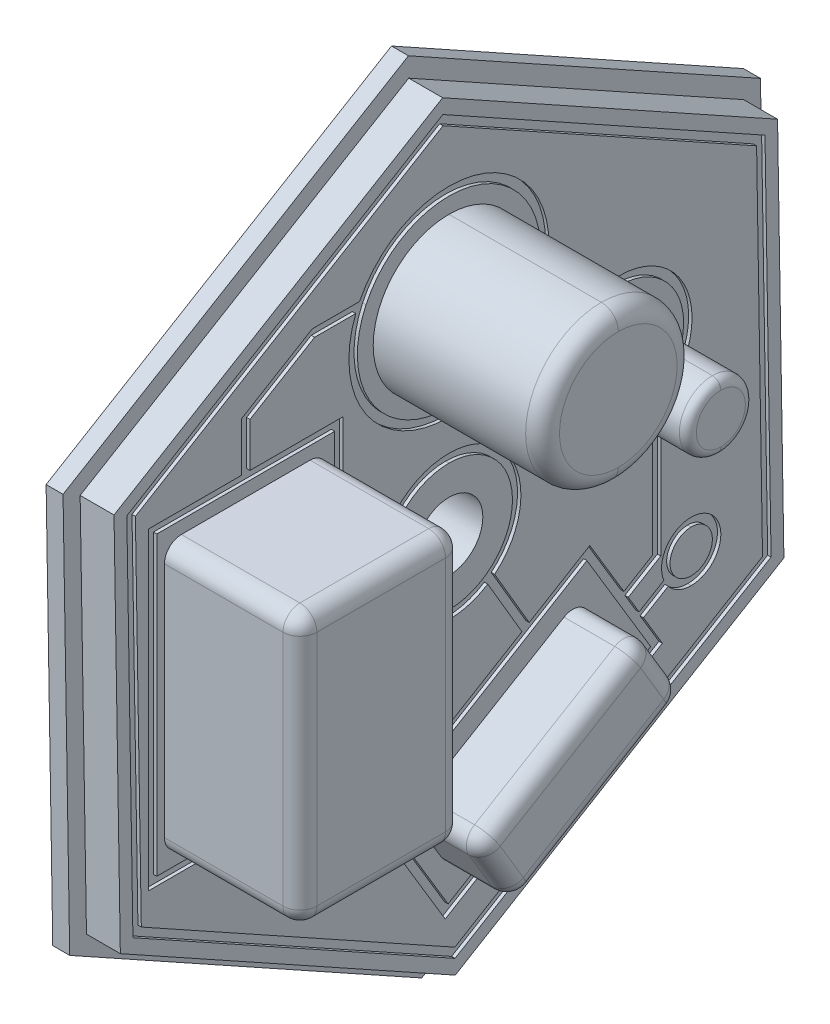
ISO-10303-21;
HEADER;
FILE_DESCRIPTION(('STEP AP214'),'2;1');
FILE_NAME('part.step','',(''),(''),'','','');
FILE_SCHEMA(('AUTOMOTIVE_DESIGN { 1 0 10303 214 1 1 1 1 }'));
ENDSEC;
DATA;
#1=APPLICATION_CONTEXT('core data for automotive mechanical design processes');
#2=APPLICATION_PROTOCOL_DEFINITION('international standard','automotive_design',2000,#1);
#3=PRODUCT_CONTEXT('',#1,'mechanical');
#4=PRODUCT('Part','Part','',(#3));
#5=PRODUCT_RELATED_PRODUCT_CATEGORY('part','',(#4));
#6=PRODUCT_DEFINITION_FORMATION('','',#4);
#7=PRODUCT_DEFINITION_CONTEXT('part definition',#1,'design');
#8=PRODUCT_DEFINITION('design','',#6,#7);
#9=PRODUCT_DEFINITION_SHAPE('','',#8);
#10=(LENGTH_UNIT() NAMED_UNIT(*) SI_UNIT(.MILLI.,.METRE.));
#11=(NAMED_UNIT(*) PLANE_ANGLE_UNIT() SI_UNIT($,.RADIAN.));
#12=(NAMED_UNIT(*) SI_UNIT($,.STERADIAN.) SOLID_ANGLE_UNIT());
#13=UNCERTAINTY_MEASURE_WITH_UNIT(LENGTH_MEASURE(1.E-05),#10,'distance_accuracy_value','');
#14=(GEOMETRIC_REPRESENTATION_CONTEXT(3) GLOBAL_UNCERTAINTY_ASSIGNED_CONTEXT((#13)) GLOBAL_UNIT_ASSIGNED_CONTEXT((#10,
#11,#12)) REPRESENTATION_CONTEXT('',''));
#15=CARTESIAN_POINT('',(0.,0.,0.));
#16=DIRECTION('',(0.,0.,1.));
#17=DIRECTION('',(1.,0.,0.));
#18=AXIS2_PLACEMENT_3D('',#15,#16,#17);
#19=CARTESIAN_POINT('',(1.45,-3.95741149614,-7.15110801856));
#20=DIRECTION('',(1.,0.,0.));
#21=DIRECTION('',(0.,-1.,0.));
#22=AXIS2_PLACEMENT_3D('',#19,#20,#21);
#23=CYLINDRICAL_SURFACE('',#22,0.625);
#24=CARTESIAN_POINT('',(1.4,-3.95741149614,-7.15110801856));
#25=DIRECTION('',(1.,0.,0.));
#26=DIRECTION('',(0.,1.,0.));
#27=AXIS2_PLACEMENT_3D('',#24,#25,#26);
#28=CIRCLE('',#27,0.625);
#29=CARTESIAN_POINT('',(1.4,-4.58241149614,-7.15110801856));
#30=VERTEX_POINT('',#29);
#31=CARTESIAN_POINT('',(1.4,-3.33241149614,-7.15110801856));
#32=VERTEX_POINT('',#31);
#33=EDGE_CURVE('E1594',#30,#32,#28,.T.);
#34=ORIENTED_EDGE('',*,*,#33,.T.);
#35=DIRECTION('',(-1.,0.,0.));
#36=VECTOR('',#35,1.);
#37=CARTESIAN_POINT('',(1.45,-3.33241149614,-7.15110801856));
#38=LINE('',#37,#36);
#39=CARTESIAN_POINT('',(1.5,-3.33241149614,-7.15110801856));
#40=VERTEX_POINT('',#39);
#41=EDGE_CURVE('E11',#40,#32,#38,.T.);
#42=ORIENTED_EDGE('',*,*,#41,.F.);
#43=CARTESIAN_POINT('',(1.5,-3.95741149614,-7.15110801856));
#44=DIRECTION('',(1.,0.,0.));
#45=DIRECTION('',(0.,1.,0.));
#46=AXIS2_PLACEMENT_3D('',#43,#44,#45);
#47=CIRCLE('',#46,0.625);
#48=CARTESIAN_POINT('',(1.5,-4.58241149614,-7.15110801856));
#49=VERTEX_POINT('',#48);
#50=EDGE_CURVE('E1448',#49,#40,#47,.T.);
#51=ORIENTED_EDGE('',*,*,#50,.F.);
#52=DIRECTION('',(-1.,0.,0.));
#53=VECTOR('',#52,1.);
#54=CARTESIAN_POINT('',(1.45,-4.58241149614,-7.15110801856));
#55=LINE('',#54,#53);
#56=EDGE_CURVE('E27',#49,#30,#55,.T.);
#57=ORIENTED_EDGE('',*,*,#56,.T.);
#58=EDGE_LOOP('',(#34,#42,#51,#57));
#59=FACE_BOUND('',#58,.T.);
#60=ADVANCED_FACE('F16',(#59),#23,.T.);
#61=CARTESIAN_POINT('',(1.45,-3.95741149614,-7.15110801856));
#62=DIRECTION('',(1.,0.,0.));
#63=DIRECTION('',(0.,1.,0.));
#64=AXIS2_PLACEMENT_3D('',#61,#62,#63);
#65=CYLINDRICAL_SURFACE('',#64,0.625);
#66=CARTESIAN_POINT('',(1.4,-3.95741149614,-7.15110801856));
#67=DIRECTION('',(1.,0.,0.));
#68=DIRECTION('',(0.,1.,0.));
#69=AXIS2_PLACEMENT_3D('',#66,#67,#68);
#70=CIRCLE('',#69,0.625);
#71=CARTESIAN_POINT('',(1.4,-4.27897134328,-6.61517493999));
#72=VERTEX_POINT('',#71);
#73=EDGE_CURVE('E1590',#32,#72,#70,.T.);
#74=ORIENTED_EDGE('',*,*,#73,.T.);
#75=CARTESIAN_POINT('',(1.4,-3.95741149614,-7.15110801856));
#76=DIRECTION('',(1.,0.,0.));
#77=DIRECTION('',(0.,1.,0.));
#78=AXIS2_PLACEMENT_3D('',#75,#76,#77);
#79=CIRCLE('',#78,0.625);
#80=EDGE_CURVE('E1842',#72,#30,#79,.T.);
#81=ORIENTED_EDGE('',*,*,#80,.T.);
#82=ORIENTED_EDGE('',*,*,#56,.F.);
#83=CARTESIAN_POINT('',(1.5,-3.95741149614,-7.15110801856));
#84=DIRECTION('',(1.,0.,0.));
#85=DIRECTION('',(0.,1.,0.));
#86=AXIS2_PLACEMENT_3D('',#83,#84,#85);
#87=CIRCLE('',#86,0.625);
#88=CARTESIAN_POINT('',(1.5,-4.27897134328,-6.61517493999));
#89=VERTEX_POINT('',#88);
#90=EDGE_CURVE('E1222',#89,#49,#87,.T.);
#91=ORIENTED_EDGE('',*,*,#90,.F.);
#92=CARTESIAN_POINT('',(1.5,-3.95741149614,-7.15110801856));
#93=DIRECTION('',(1.,0.,0.));
#94=DIRECTION('',(0.,1.,0.));
#95=AXIS2_PLACEMENT_3D('',#92,#93,#94);
#96=CIRCLE('',#95,0.625);
#97=EDGE_CURVE('E1122',#40,#89,#96,.T.);
#98=ORIENTED_EDGE('',*,*,#97,.F.);
#99=ORIENTED_EDGE('',*,*,#41,.T.);
#100=EDGE_LOOP('',(#74,#81,#82,#91,#98,#99));
#101=FACE_BOUND('',#100,.T.);
#102=ADVANCED_FACE('F2563',(#101),#65,.T.);
#103=CARTESIAN_POINT('',(1.45,0.,0.));
#104=DIRECTION('',(1.,0.,0.));
#105=DIRECTION('',(0.,-0.805566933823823,-0.592504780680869));
#106=AXIS2_PLACEMENT_3D('',#103,#104,#105);
#107=CYLINDRICAL_SURFACE('',#106,1.875);
#108=CARTESIAN_POINT('',(1.4,0.,0.));
#109=DIRECTION('',(1.,0.,0.));
#110=DIRECTION('',(0.,1.,0.));
#111=AXIS2_PLACEMENT_3D('',#108,#109,#110);
#112=CIRCLE('',#111,1.875);
#113=CARTESIAN_POINT('',(1.4,-1.51043800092,-1.11094646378));
#114=VERTEX_POINT('',#113);
#115=CARTESIAN_POINT('',(1.4,1.875,0.));
#116=VERTEX_POINT('',#115);
#117=EDGE_CURVE('E1107',#114,#116,#112,.T.);
#118=ORIENTED_EDGE('',*,*,#117,.T.);
#119=DIRECTION('',(-1.,0.,0.));
#120=VECTOR('',#119,1.);
#121=CARTESIAN_POINT('',(1.45,1.875,0.));
#122=LINE('',#121,#120);
#123=CARTESIAN_POINT('',(1.5,1.875,0.));
#124=VERTEX_POINT('',#123);
#125=EDGE_CURVE('E1101',#124,#116,#122,.T.);
#126=ORIENTED_EDGE('',*,*,#125,.F.);
#127=CARTESIAN_POINT('',(1.5,0.,0.));
#128=DIRECTION('',(1.,0.,0.));
#129=DIRECTION('',(0.,1.,0.));
#130=AXIS2_PLACEMENT_3D('',#127,#128,#129);
#131=CIRCLE('',#130,1.875);
#132=CARTESIAN_POINT('',(1.5,-1.51043800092,-1.11094646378));
#133=VERTEX_POINT('',#132);
#134=EDGE_CURVE('E1104',#133,#124,#131,.T.);
#135=ORIENTED_EDGE('',*,*,#134,.F.);
#136=DIRECTION('',(-1.,0.,0.));
#137=VECTOR('',#136,1.);
#138=CARTESIAN_POINT('',(1.45,-1.51043800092,-1.11094646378));
#139=LINE('',#138,#137);
#140=EDGE_CURVE('E1231',#133,#114,#139,.T.);
#141=ORIENTED_EDGE('',*,*,#140,.T.);
#142=EDGE_LOOP('',(#118,#126,#135,#141));
#143=FACE_BOUND('',#142,.T.);
#144=ADVANCED_FACE('F1103',(#143),#107,.T.);
#145=CARTESIAN_POINT('',(1.45,0.,0.));
#146=DIRECTION('',(1.,0.,0.));
#147=DIRECTION('',(0.,1.,0.));
#148=AXIS2_PLACEMENT_3D('',#145,#146,#147);
#149=CYLINDRICAL_SURFACE('',#148,1.875);
#150=CARTESIAN_POINT('',(1.4,0.,0.));
#151=DIRECTION('',(1.,0.,0.));
#152=DIRECTION('',(0.,1.,0.));
#153=AXIS2_PLACEMENT_3D('',#150,#151,#152);
#154=CIRCLE('',#153,1.875);
#155=CARTESIAN_POINT('',(1.4,-0.00365206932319,1.8749964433));
#156=VERTEX_POINT('',#155);
#157=EDGE_CURVE('E1697',#116,#156,#154,.T.);
#158=ORIENTED_EDGE('',*,*,#157,.T.);
#159=DIRECTION('',(-1.,0.,0.));
#160=VECTOR('',#159,1.);
#161=CARTESIAN_POINT('',(1.45,-0.00365206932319,1.8749964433));
#162=LINE('',#161,#160);
#163=CARTESIAN_POINT('',(1.5,-0.00365206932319,1.8749964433));
#164=VERTEX_POINT('',#163);
#165=EDGE_CURVE('E1113',#164,#156,#162,.T.);
#166=ORIENTED_EDGE('',*,*,#165,.F.);
#167=CARTESIAN_POINT('',(1.5,0.,0.));
#168=DIRECTION('',(1.,0.,0.));
#169=DIRECTION('',(0.,1.,0.));
#170=AXIS2_PLACEMENT_3D('',#167,#168,#169);
#171=CIRCLE('',#170,1.875);
#172=EDGE_CURVE('E1119',#124,#164,#171,.T.);
#173=ORIENTED_EDGE('',*,*,#172,.F.);
#174=ORIENTED_EDGE('',*,*,#125,.T.);
#175=EDGE_LOOP('',(#158,#166,#173,#174));
#176=FACE_BOUND('',#175,.T.);
#177=ADVANCED_FACE('F1124',(#176),#149,.T.);
#178=CARTESIAN_POINT('',(1.45,0.,0.));
#179=DIRECTION('',(1.,0.,0.));
#180=DIRECTION('',(0.,-0.00194777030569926,0.999998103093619));
#181=AXIS2_PLACEMENT_3D('',#178,#179,#180);
#182=CYLINDRICAL_SURFACE('',#181,1.875);
#183=CARTESIAN_POINT('',(1.4,0.,0.));
#184=DIRECTION('',(1.,0.,0.));
#185=DIRECTION('',(0.,1.,0.));
#186=AXIS2_PLACEMENT_3D('',#183,#184,#185);
#187=CIRCLE('',#186,1.875);
#188=CARTESIAN_POINT('',(1.4,-1.875,0.));
#189=VERTEX_POINT('',#188);
#190=EDGE_CURVE('E1272',#156,#189,#187,.T.);
#191=ORIENTED_EDGE('',*,*,#190,.T.);
#192=CARTESIAN_POINT('',(1.4,0.,0.));
#193=DIRECTION('',(1.,0.,0.));
#194=DIRECTION('',(0.,1.,0.));
#195=AXIS2_PLACEMENT_3D('',#192,#193,#194);
#196=CIRCLE('',#195,1.875);
#197=EDGE_CURVE('E1595',#189,#114,#196,.T.);
#198=ORIENTED_EDGE('',*,*,#197,.T.);
#199=ORIENTED_EDGE('',*,*,#140,.F.);
#200=CARTESIAN_POINT('',(1.5,0.,0.));
#201=DIRECTION('',(1.,0.,0.));
#202=DIRECTION('',(0.,1.,0.));
#203=AXIS2_PLACEMENT_3D('',#200,#201,#202);
#204=CIRCLE('',#203,1.875);
#205=CARTESIAN_POINT('',(1.5,-1.875,0.));
#206=VERTEX_POINT('',#205);
#207=EDGE_CURVE('E1120',#206,#133,#204,.T.);
#208=ORIENTED_EDGE('',*,*,#207,.F.);
#209=CARTESIAN_POINT('',(1.5,0.,0.));
#210=DIRECTION('',(1.,0.,0.));
#211=DIRECTION('',(0.,1.,0.));
#212=AXIS2_PLACEMENT_3D('',#209,#210,#211);
#213=CIRCLE('',#212,1.875);
#214=EDGE_CURVE('E1127',#164,#206,#213,.T.);
#215=ORIENTED_EDGE('',*,*,#214,.F.);
#216=ORIENTED_EDGE('',*,*,#165,.T.);
#217=EDGE_LOOP('',(#191,#198,#199,#208,#215,#216));
#218=FACE_BOUND('',#217,.T.);
#219=ADVANCED_FACE('F4826',(#218),#182,.T.);
#220=CARTESIAN_POINT('',(1.5,-5.69561582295,0.996663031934));
#221=DIRECTION('',(0.,-0.857492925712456,-0.514495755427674));
#222=DIRECTION('',(0.,0.514495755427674,-0.857492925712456));
#223=AXIS2_PLACEMENT_3D('',#220,#221,#222);
#224=PLANE('',#223);
#225=DIRECTION('',(-1.,0.,0.));
#226=VECTOR('',#225,1.);
#227=CARTESIAN_POINT('',(1.45,-2.65412771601,-4.07248381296));
#228=LINE('',#227,#226);
#229=CARTESIAN_POINT('',(1.5,-2.65412771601,-4.07248381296));
#230=VERTEX_POINT('',#229);
#231=CARTESIAN_POINT('',(1.4,-2.65412771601,-4.07248381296));
#232=VERTEX_POINT('',#231);
#233=EDGE_CURVE('E1731',#230,#232,#228,.T.);
#234=ORIENTED_EDGE('',*,*,#233,.T.);
#235=DIRECTION('',(0.,-0.514495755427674,0.857492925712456));
#236=VECTOR('',#235,1.);
#237=CARTESIAN_POINT('',(1.4,-4.4484439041,-1.08195683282));
#238=LINE('',#237,#236);
#239=CARTESIAN_POINT('',(1.4,-6.24276009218,1.90857014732));
#240=VERTEX_POINT('',#239);
#241=EDGE_CURVE('E1268',#232,#240,#238,.T.);
#242=ORIENTED_EDGE('',*,*,#241,.T.);
#243=DIRECTION('',(-1.,0.,0.));
#244=VECTOR('',#243,1.);
#245=CARTESIAN_POINT('',(1.45,-6.24276009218,1.90857014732));
#246=LINE('',#245,#244);
#247=CARTESIAN_POINT('',(1.5,-6.24276009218,1.90857014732));
#248=VERTEX_POINT('',#247);
#249=EDGE_CURVE('E1228',#248,#240,#246,.T.);
#250=ORIENTED_EDGE('',*,*,#249,.F.);
#251=DIRECTION('',(0.,-0.514495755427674,0.857492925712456));
#252=VECTOR('',#251,1.);
#253=CARTESIAN_POINT('',(1.5,-4.4484439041,-1.08195683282));
#254=LINE('',#253,#252);
#255=EDGE_CURVE('E1137',#230,#248,#254,.T.);
#256=ORIENTED_EDGE('',*,*,#255,.F.);
#257=EDGE_LOOP('',(#234,#242,#250,#256));
#258=FACE_BOUND('',#257,.T.);
#259=ADVANCED_FACE('F4816',(#258),#224,.F.);
#260=CARTESIAN_POINT('',(1.5,-6.24276009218,1.90857014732));
#261=DIRECTION('',(0.,0.514495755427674,-0.857492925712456));
#262=DIRECTION('',(-1.,0.,0.));
#263=AXIS2_PLACEMENT_3D('',#260,#261,#262);
#264=PLANE('',#263);
#265=DIRECTION('',(0.,-0.857492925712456,-0.514495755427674));
#266=VECTOR('',#265,1.);
#267=CARTESIAN_POINT('',(1.4,-7.8132061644,0.966302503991));
#268=LINE('',#267,#266);
#269=CARTESIAN_POINT('',(1.4,-9.38365223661,0.0240348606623));
#270=VERTEX_POINT('',#269);
#271=EDGE_CURVE('E1273',#240,#270,#268,.T.);
#272=ORIENTED_EDGE('',*,*,#271,.T.);
#273=DIRECTION('',(-1.,0.,0.));
#274=VECTOR('',#273,1.);
#275=CARTESIAN_POINT('',(1.45,-9.38365223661,0.0240348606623));
#276=LINE('',#275,#274);
#277=CARTESIAN_POINT('',(1.5,-9.38365223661,0.0240348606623));
#278=VERTEX_POINT('',#277);
#279=EDGE_CURVE('E1232',#278,#270,#276,.T.);
#280=ORIENTED_EDGE('',*,*,#279,.F.);
#281=DIRECTION('',(0.,-0.857492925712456,-0.514495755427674));
#282=VECTOR('',#281,1.);
#283=CARTESIAN_POINT('',(1.5,-7.8132061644,0.966302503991));
#284=LINE('',#283,#282);
#285=EDGE_CURVE('E1128',#248,#278,#284,.T.);
#286=ORIENTED_EDGE('',*,*,#285,.F.);
#287=ORIENTED_EDGE('',*,*,#249,.T.);
#288=EDGE_LOOP('',(#272,#280,#286,#287));
#289=FACE_BOUND('',#288,.T.);
#290=ADVANCED_FACE('F2590',(#289),#264,.F.);
#291=CARTESIAN_POINT('',(1.5,-9.38365223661,0.0240348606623));
#292=DIRECTION('',(0.,0.857492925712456,0.514495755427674));
#293=DIRECTION('',(1.,0.,0.));
#294=AXIS2_PLACEMENT_3D('',#291,#292,#293);
#295=PLANE('',#294);
#296=DIRECTION('',(0.,0.514495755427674,-0.857492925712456));
#297=VECTOR('',#296,1.);
#298=CARTESIAN_POINT('',(1.4,-7.58933604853,-2.96649211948));
#299=LINE('',#298,#297);
#300=CARTESIAN_POINT('',(1.4,-5.79501986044,-5.95701909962));
#301=VERTEX_POINT('',#300);
#302=EDGE_CURVE('E1211',#270,#301,#299,.T.);
#303=ORIENTED_EDGE('',*,*,#302,.T.);
#304=DIRECTION('',(-1.,0.,0.));
#305=VECTOR('',#304,1.);
#306=CARTESIAN_POINT('',(1.45,-5.79501986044,-5.95701909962));
#307=LINE('',#306,#305);
#308=CARTESIAN_POINT('',(1.5,-5.79501986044,-5.95701909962));
#309=VERTEX_POINT('',#308);
#310=EDGE_CURVE('E1734',#309,#301,#307,.T.);
#311=ORIENTED_EDGE('',*,*,#310,.F.);
#312=DIRECTION('',(0.,0.514495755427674,-0.857492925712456));
#313=VECTOR('',#312,1.);
#314=CARTESIAN_POINT('',(1.5,-7.58933604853,-2.96649211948));
#315=LINE('',#314,#313);
#316=EDGE_CURVE('E1227',#278,#309,#315,.T.);
#317=ORIENTED_EDGE('',*,*,#316,.F.);
#318=ORIENTED_EDGE('',*,*,#279,.T.);
#319=EDGE_LOOP('',(#303,#311,#317,#318));
#320=FACE_BOUND('',#319,.T.);
#321=ADVANCED_FACE('F2587',(#320),#295,.F.);
#322=CARTESIAN_POINT('',(1.5,-4.22457378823,-5.01475145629));
#323=DIRECTION('',(0.,-0.514495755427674,0.857492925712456));
#324=DIRECTION('',(-1.,0.,0.));
#325=AXIS2_PLACEMENT_3D('',#322,#323,#324);
#326=PLANE('',#325);
#327=ORIENTED_EDGE('',*,*,#310,.T.);
#328=DIRECTION('',(0.,0.857492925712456,0.514495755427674));
#329=VECTOR('',#328,1.);
#330=CARTESIAN_POINT('',(1.4,-4.22457378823,-5.01475145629));
#331=LINE('',#330,#329);
#332=EDGE_CURVE('E1207',#301,#232,#331,.T.);
#333=ORIENTED_EDGE('',*,*,#332,.T.);
#334=ORIENTED_EDGE('',*,*,#233,.F.);
#335=DIRECTION('',(0.,0.857492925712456,0.514495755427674));
#336=VECTOR('',#335,1.);
#337=CARTESIAN_POINT('',(1.5,-4.22457378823,-5.01475145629));
#338=LINE('',#337,#336);
#339=EDGE_CURVE('E1223',#309,#230,#338,.T.);
#340=ORIENTED_EDGE('',*,*,#339,.F.);
#341=EDGE_LOOP('',(#327,#333,#334,#340));
#342=FACE_BOUND('',#341,.T.);
#343=ADVANCED_FACE('F2558',(#342),#326,.F.);
#344=CARTESIAN_POINT('',(1.5,-5.54555456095,1.23247358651));
#345=DIRECTION('',(0.,-0.857492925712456,-0.514495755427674));
#346=DIRECTION('',(0.,0.514495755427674,-0.857492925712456));
#347=AXIS2_PLACEMENT_3D('',#344,#345,#346);
#348=PLANE('',#347);
#349=DIRECTION('',(-1.,0.,0.));
#350=VECTOR('',#349,1.);
#351=CARTESIAN_POINT('',(1.45,-3.51280102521,-2.15544897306));
#352=LINE('',#351,#350);
#353=CARTESIAN_POINT('',(1.5,-3.51280102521,-2.15544897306));
#354=VERTEX_POINT('',#353);
#355=CARTESIAN_POINT('',(1.4,-3.51280102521,-2.15544897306));
#356=VERTEX_POINT('',#355);
#357=EDGE_CURVE('E1855',#354,#356,#352,.T.);
#358=ORIENTED_EDGE('',*,*,#357,.F.);
#359=DIRECTION('',(0.,-0.514495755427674,0.857492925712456));
#360=VECTOR('',#359,1.);
#361=CARTESIAN_POINT('',(1.5,-4.46486582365,-0.568674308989));
#362=LINE('',#361,#360);
#363=CARTESIAN_POINT('',(1.5,-5.41693062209,1.01810035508));
#364=VERTEX_POINT('',#363);
#365=EDGE_CURVE('E1562',#354,#364,#362,.T.);
#366=ORIENTED_EDGE('',*,*,#365,.T.);
#367=DIRECTION('',(-1.,0.,0.));
#368=VECTOR('',#367,1.);
#369=CARTESIAN_POINT('',(1.45,-5.41693062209,1.01810035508));
#370=LINE('',#369,#368);
#371=CARTESIAN_POINT('',(1.4,-5.41693062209,1.01810035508));
#372=VERTEX_POINT('',#371);
#373=EDGE_CURVE('E669',#364,#372,#370,.T.);
#374=ORIENTED_EDGE('',*,*,#373,.T.);
#375=DIRECTION('',(0.,-0.514495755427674,0.857492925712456));
#376=VECTOR('',#375,1.);
#377=CARTESIAN_POINT('',(1.4,-4.46486582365,-0.568674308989));
#378=LINE('',#377,#376);
#379=EDGE_CURVE('E1212',#356,#372,#378,.T.);
#380=ORIENTED_EDGE('',*,*,#379,.F.);
#381=EDGE_LOOP('',(#358,#366,#374,#380));
#382=FACE_BOUND('',#381,.T.);
#383=ADVANCED_FACE('F2535',(#382),#348,.T.);
#384=CARTESIAN_POINT('',(1.5,-3.51280102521,-2.15544897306));
#385=DIRECTION('',(0.,-0.505916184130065,0.86258264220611));
#386=DIRECTION('',(-1.,0.,0.));
#387=AXIS2_PLACEMENT_3D('',#384,#385,#386);
#388=PLANE('',#387);
#389=DIRECTION('',(0.,0.86258264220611,0.505916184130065));
#390=VECTOR('',#389,1.);
#391=CARTESIAN_POINT('',(1.4,-2.65145053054,-1.65025545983));
#392=LINE('',#391,#390);
#393=CARTESIAN_POINT('',(1.4,-1.79010003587,-1.14506194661));
#394=VERTEX_POINT('',#393);
#395=EDGE_CURVE('E1245',#356,#394,#392,.T.);
#396=ORIENTED_EDGE('',*,*,#395,.T.);
#397=DIRECTION('',(-1.,0.,0.));
#398=VECTOR('',#397,1.);
#399=CARTESIAN_POINT('',(1.45,-1.79010003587,-1.14506194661));
#400=LINE('',#399,#398);
#401=CARTESIAN_POINT('',(1.5,-1.79010003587,-1.14506194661));
#402=VERTEX_POINT('',#401);
#403=EDGE_CURVE('E1976',#402,#394,#400,.T.);
#404=ORIENTED_EDGE('',*,*,#403,.F.);
#405=DIRECTION('',(0.,0.86258264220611,0.505916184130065));
#406=VECTOR('',#405,1.);
#407=CARTESIAN_POINT('',(1.5,-2.65145053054,-1.65025545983));
#408=LINE('',#407,#406);
#409=EDGE_CURVE('E1558',#354,#402,#408,.T.);
#410=ORIENTED_EDGE('',*,*,#409,.F.);
#411=ORIENTED_EDGE('',*,*,#357,.T.);
#412=EDGE_LOOP('',(#396,#404,#410,#411));
#413=FACE_BOUND('',#412,.T.);
#414=ADVANCED_FACE('F2548',(#413),#388,.F.);
#415=CARTESIAN_POINT('',(1.45,0.,0.));
#416=DIRECTION('',(1.,0.,0.));
#417=DIRECTION('',(0.,-1.,0.));
#418=AXIS2_PLACEMENT_3D('',#415,#416,#417);
#419=CYLINDRICAL_SURFACE('',#418,2.125);
#420=DIRECTION('',(-1.,0.,0.));
#421=VECTOR('',#420,1.);
#422=CARTESIAN_POINT('',(1.45,-2.125,0.));
#423=LINE('',#422,#421);
#424=CARTESIAN_POINT('',(1.5,-2.125,0.));
#425=VERTEX_POINT('',#424);
#426=CARTESIAN_POINT('',(1.4,-2.125,0.));
#427=VERTEX_POINT('',#426);
#428=EDGE_CURVE('E1838',#425,#427,#423,.T.);
#429=ORIENTED_EDGE('',*,*,#428,.F.);
#430=CARTESIAN_POINT('',(1.5,0.,0.));
#431=DIRECTION('',(1.,0.,0.));
#432=DIRECTION('',(0.,1.,0.));
#433=AXIS2_PLACEMENT_3D('',#430,#431,#432);
#434=CIRCLE('',#433,2.125);
#435=EDGE_CURVE('E1557',#425,#402,#434,.T.);
#436=ORIENTED_EDGE('',*,*,#435,.T.);
#437=ORIENTED_EDGE('',*,*,#403,.T.);
#438=CARTESIAN_POINT('',(1.4,0.,0.));
#439=DIRECTION('',(1.,0.,0.));
#440=DIRECTION('',(0.,1.,0.));
#441=AXIS2_PLACEMENT_3D('',#438,#439,#440);
#442=CIRCLE('',#441,2.125);
#443=EDGE_CURVE('E1249',#427,#394,#442,.T.);
#444=ORIENTED_EDGE('',*,*,#443,.F.);
#445=EDGE_LOOP('',(#429,#436,#437,#444));
#446=FACE_BOUND('',#445,.T.);
#447=ADVANCED_FACE('F2546',(#446),#419,.F.);
#448=CARTESIAN_POINT('',(1.45,0.,0.));
#449=DIRECTION('',(1.,0.,0.));
#450=DIRECTION('',(0.,-0.0604793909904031,0.998169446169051));
#451=AXIS2_PLACEMENT_3D('',#448,#449,#450);
#452=CYLINDRICAL_SURFACE('',#451,2.125);
#453=DIRECTION('',(-1.,0.,0.));
#454=VECTOR('',#453,1.);
#455=CARTESIAN_POINT('',(1.45,-0.128518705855,2.12111007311));
#456=LINE('',#455,#454);
#457=CARTESIAN_POINT('',(1.5,-0.128518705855,2.12111007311));
#458=VERTEX_POINT('',#457);
#459=CARTESIAN_POINT('',(1.4,-0.128518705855,2.12111007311));
#460=VERTEX_POINT('',#459);
#461=EDGE_CURVE('E1835',#458,#460,#456,.T.);
#462=ORIENTED_EDGE('',*,*,#461,.F.);
#463=CARTESIAN_POINT('',(1.5,0.,0.));
#464=DIRECTION('',(1.,0.,0.));
#465=DIRECTION('',(0.,1.,0.));
#466=AXIS2_PLACEMENT_3D('',#463,#464,#465);
#467=CIRCLE('',#466,2.125);
#468=EDGE_CURVE('E1552',#458,#425,#467,.T.);
#469=ORIENTED_EDGE('',*,*,#468,.T.);
#470=ORIENTED_EDGE('',*,*,#428,.T.);
#471=CARTESIAN_POINT('',(1.4,0.,0.));
#472=DIRECTION('',(1.,0.,0.));
#473=DIRECTION('',(0.,1.,0.));
#474=AXIS2_PLACEMENT_3D('',#471,#472,#473);
#475=CIRCLE('',#474,2.125);
#476=EDGE_CURVE('E1434',#460,#427,#475,.T.);
#477=ORIENTED_EDGE('',*,*,#476,.F.);
#478=EDGE_LOOP('',(#462,#469,#470,#477));
#479=FACE_BOUND('',#478,.T.);
#480=ADVANCED_FACE('F2543',(#479),#452,.F.);
#481=CARTESIAN_POINT('',(1.5,-0.12539016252,3.125));
#482=DIRECTION('',(0.,0.999995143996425,-0.00311640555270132));
#483=DIRECTION('',(-1.,0.,0.));
#484=AXIS2_PLACEMENT_3D('',#481,#482,#483);
#485=PLANE('',#484);
#486=DIRECTION('',(-1.,0.,0.));
#487=VECTOR('',#486,1.);
#488=CARTESIAN_POINT('',(1.45,-0.12539016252,3.125));
#489=LINE('',#488,#487);
#490=CARTESIAN_POINT('',(1.5,-0.12539016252,3.125));
#491=VERTEX_POINT('',#490);
#492=CARTESIAN_POINT('',(1.4,-0.12539016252,3.125));
#493=VERTEX_POINT('',#492);
#494=EDGE_CURVE('E1140',#491,#493,#489,.T.);
#495=ORIENTED_EDGE('',*,*,#494,.F.);
#496=DIRECTION('',(0.,-0.00311640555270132,-0.999995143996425));
#497=VECTOR('',#496,1.);
#498=CARTESIAN_POINT('',(1.5,-0.126954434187,2.62305503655));
#499=LINE('',#498,#497);
#500=EDGE_CURVE('E1556',#491,#458,#499,.T.);
#501=ORIENTED_EDGE('',*,*,#500,.T.);
#502=ORIENTED_EDGE('',*,*,#461,.T.);
#503=DIRECTION('',(0.,-0.00311640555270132,-0.999995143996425));
#504=VECTOR('',#503,1.);
#505=CARTESIAN_POINT('',(1.4,-0.126954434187,2.62305503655));
#506=LINE('',#505,#504);
#507=EDGE_CURVE('E1748',#493,#460,#506,.T.);
#508=ORIENTED_EDGE('',*,*,#507,.F.);
#509=EDGE_LOOP('',(#495,#501,#502,#508));
#510=FACE_BOUND('',#509,.T.);
#511=ADVANCED_FACE('F2526',(#510),#485,.T.);
#512=CARTESIAN_POINT('',(1.5,-2.39134387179,3.125));
#513=DIRECTION('',(0.,0.,-1.));
#514=DIRECTION('',(0.,-1.,0.));
#515=AXIS2_PLACEMENT_3D('',#512,#513,#514);
#516=PLANE('',#515);
#517=DIRECTION('',(0.,-1.,0.));
#518=VECTOR('',#517,1.);
#519=CARTESIAN_POINT('',(1.4,-1.0154106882,3.125));
#520=LINE('',#519,#518);
#521=CARTESIAN_POINT('',(1.4,-1.90543121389,3.125));
#522=VERTEX_POINT('',#521);
#523=EDGE_CURVE('E1744',#493,#522,#520,.T.);
#524=ORIENTED_EDGE('',*,*,#523,.T.);
#525=DIRECTION('',(-1.,0.,0.));
#526=VECTOR('',#525,1.);
#527=CARTESIAN_POINT('',(1.45,-1.90543121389,3.125));
#528=LINE('',#527,#526);
#529=CARTESIAN_POINT('',(1.5,-1.90543121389,3.125));
#530=VERTEX_POINT('',#529);
#531=EDGE_CURVE('E2223',#530,#522,#528,.T.);
#532=ORIENTED_EDGE('',*,*,#531,.F.);
#533=DIRECTION('',(0.,-1.,0.));
#534=VECTOR('',#533,1.);
#535=CARTESIAN_POINT('',(1.5,-1.0154106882,3.125));
#536=LINE('',#535,#534);
#537=EDGE_CURVE('E1608',#491,#530,#536,.T.);
#538=ORIENTED_EDGE('',*,*,#537,.F.);
#539=ORIENTED_EDGE('',*,*,#494,.T.);
#540=EDGE_LOOP('',(#524,#532,#538,#539));
#541=FACE_BOUND('',#540,.T.);
#542=ADVANCED_FACE('F2522',(#541),#516,.F.);
#543=CARTESIAN_POINT('',(1.5,-5.41693062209,1.01810035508));
#544=DIRECTION('',(0.,-0.514495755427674,0.857492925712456));
#545=DIRECTION('',(-1.,0.,0.));
#546=AXIS2_PLACEMENT_3D('',#543,#544,#545);
#547=PLANE('',#546);
#548=ORIENTED_EDGE('',*,*,#373,.F.);
#549=DIRECTION('',(0.,0.857492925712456,0.514495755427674));
#550=VECTOR('',#549,1.);
#551=CARTESIAN_POINT('',(1.5,-3.66118091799,2.07155017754));
#552=LINE('',#551,#550);
#553=EDGE_CURVE('E1774',#364,#530,#552,.T.);
#554=ORIENTED_EDGE('',*,*,#553,.T.);
#555=ORIENTED_EDGE('',*,*,#531,.T.);
#556=DIRECTION('',(0.,0.857492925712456,0.514495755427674));
#557=VECTOR('',#556,1.);
#558=CARTESIAN_POINT('',(1.4,-3.66118091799,2.07155017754));
#559=LINE('',#558,#557);
#560=EDGE_CURVE('E1749',#372,#522,#559,.T.);
#561=ORIENTED_EDGE('',*,*,#560,.F.);
#562=EDGE_LOOP('',(#548,#554,#555,#561));
#563=FACE_BOUND('',#562,.T.);
#564=ADVANCED_FACE('F2532',(#563),#547,.T.);
#565=CARTESIAN_POINT('',(1.5,4.375,8.625));
#566=DIRECTION('',(0.,1.,0.));
#567=DIRECTION('',(1.,0.,0.));
#568=AXIS2_PLACEMENT_3D('',#565,#566,#567);
#569=PLANE('',#568);
#570=DIRECTION('',(-1.,0.,0.));
#571=VECTOR('',#570,1.);
#572=CARTESIAN_POINT('',(1.45,4.375,8.625));
#573=LINE('',#572,#571);
#574=CARTESIAN_POINT('',(1.5,4.375,8.625));
#575=VERTEX_POINT('',#574);
#576=CARTESIAN_POINT('',(1.4,4.375,8.625));
#577=VERTEX_POINT('',#576);
#578=EDGE_CURVE('E658',#575,#577,#573,.T.);
#579=ORIENTED_EDGE('',*,*,#578,.F.);
#580=DIRECTION('',(0.,0.,-1.));
#581=VECTOR('',#580,1.);
#582=CARTESIAN_POINT('',(1.5,4.375,6.));
#583=LINE('',#582,#581);
#584=CARTESIAN_POINT('',(1.5,4.375,3.375));
#585=VERTEX_POINT('',#584);
#586=EDGE_CURVE('E1901',#575,#585,#583,.T.);
#587=ORIENTED_EDGE('',*,*,#586,.T.);
#588=DIRECTION('',(-1.,0.,0.));
#589=VECTOR('',#588,1.);
#590=CARTESIAN_POINT('',(1.45,4.375,3.375));
#591=LINE('',#590,#589);
#592=CARTESIAN_POINT('',(1.4,4.375,3.375));
#593=VERTEX_POINT('',#592);
#594=EDGE_CURVE('E1585',#585,#593,#591,.T.);
#595=ORIENTED_EDGE('',*,*,#594,.T.);
#596=DIRECTION('',(0.,0.,-1.));
#597=VECTOR('',#596,1.);
#598=CARTESIAN_POINT('',(1.4,4.375,6.));
#599=LINE('',#598,#597);
#600=EDGE_CURVE('E2269',#577,#593,#599,.T.);
#601=ORIENTED_EDGE('',*,*,#600,.F.);
#602=EDGE_LOOP('',(#579,#587,#595,#601));
#603=FACE_BOUND('',#602,.T.);
#604=ADVANCED_FACE('F2650',(#603),#569,.T.);
#605=CARTESIAN_POINT('',(1.5,-4.375,8.625));
#606=DIRECTION('',(0.,0.,1.));
#607=DIRECTION('',(1.,0.,0.));
#608=AXIS2_PLACEMENT_3D('',#605,#606,#607);
#609=PLANE('',#608);
#610=DIRECTION('',(-1.,0.,0.));
#611=VECTOR('',#610,1.);
#612=CARTESIAN_POINT('',(1.45,-4.375,8.625));
#613=LINE('',#612,#611);
#614=CARTESIAN_POINT('',(1.5,-4.375,8.625));
#615=VERTEX_POINT('',#614);
#616=CARTESIAN_POINT('',(1.4,-4.375,8.625));
#617=VERTEX_POINT('',#616);
#618=EDGE_CURVE('E1183',#615,#617,#613,.T.);
#619=ORIENTED_EDGE('',*,*,#618,.F.);
#620=DIRECTION('',(0.,1.,0.));
#621=VECTOR('',#620,1.);
#622=CARTESIAN_POINT('',(1.5,0.,8.625));
#623=LINE('',#622,#621);
#624=EDGE_CURVE('E1898',#615,#575,#623,.T.);
#625=ORIENTED_EDGE('',*,*,#624,.T.);
#626=ORIENTED_EDGE('',*,*,#578,.T.);
#627=DIRECTION('',(0.,1.,0.));
#628=VECTOR('',#627,1.);
#629=CARTESIAN_POINT('',(1.4,0.,8.625));
#630=LINE('',#629,#628);
#631=EDGE_CURVE('E1704',#617,#577,#630,.T.);
#632=ORIENTED_EDGE('',*,*,#631,.F.);
#633=EDGE_LOOP('',(#619,#625,#626,#632));
#634=FACE_BOUND('',#633,.T.);
#635=ADVANCED_FACE('F2653',(#634),#609,.T.);
#636=CARTESIAN_POINT('',(1.5,-4.375,3.375));
#637=DIRECTION('',(0.,-1.,0.));
#638=DIRECTION('',(0.,0.,-1.));
#639=AXIS2_PLACEMENT_3D('',#636,#637,#638);
#640=PLANE('',#639);
#641=DIRECTION('',(-1.,0.,0.));
#642=VECTOR('',#641,1.);
#643=CARTESIAN_POINT('',(1.45,-4.375,3.375));
#644=LINE('',#643,#642);
#645=CARTESIAN_POINT('',(1.5,-4.375,3.375));
#646=VERTEX_POINT('',#645);
#647=CARTESIAN_POINT('',(1.4,-4.375,3.375));
#648=VERTEX_POINT('',#647);
#649=EDGE_CURVE('E1588',#646,#648,#644,.T.);
#650=ORIENTED_EDGE('',*,*,#649,.F.);
#651=DIRECTION('',(0.,0.,1.));
#652=VECTOR('',#651,1.);
#653=CARTESIAN_POINT('',(1.5,-4.375,6.));
#654=LINE('',#653,#652);
#655=EDGE_CURVE('E2075',#646,#615,#654,.T.);
#656=ORIENTED_EDGE('',*,*,#655,.T.);
#657=ORIENTED_EDGE('',*,*,#618,.T.);
#658=DIRECTION('',(0.,0.,1.));
#659=VECTOR('',#658,1.);
#660=CARTESIAN_POINT('',(1.4,-4.375,6.));
#661=LINE('',#660,#659);
#662=EDGE_CURVE('E1700',#648,#617,#661,.T.);
#663=ORIENTED_EDGE('',*,*,#662,.F.);
#664=EDGE_LOOP('',(#650,#656,#657,#663));
#665=FACE_BOUND('',#664,.T.);
#666=ADVANCED_FACE('F2682',(#665),#640,.T.);
#667=CARTESIAN_POINT('',(1.5,4.375,3.375));
#668=DIRECTION('',(0.,0.,-1.));
#669=DIRECTION('',(0.,-1.,0.));
#670=AXIS2_PLACEMENT_3D('',#667,#668,#669);
#671=PLANE('',#670);
#672=ORIENTED_EDGE('',*,*,#594,.F.);
#673=DIRECTION('',(0.,-1.,0.));
#674=VECTOR('',#673,1.);
#675=CARTESIAN_POINT('',(1.5,0.,3.375));
#676=LINE('',#675,#674);
#677=EDGE_CURVE('E2071',#585,#646,#676,.T.);
#678=ORIENTED_EDGE('',*,*,#677,.T.);
#679=ORIENTED_EDGE('',*,*,#649,.T.);
#680=DIRECTION('',(0.,-1.,0.));
#681=VECTOR('',#680,1.);
#682=CARTESIAN_POINT('',(1.4,0.,3.375));
#683=LINE('',#682,#681);
#684=EDGE_CURVE('E1705',#593,#648,#683,.T.);
#685=ORIENTED_EDGE('',*,*,#684,.F.);
#686=EDGE_LOOP('',(#672,#678,#679,#685));
#687=FACE_BOUND('',#686,.T.);
#688=ADVANCED_FACE('F4718',(#687),#671,.T.);
#689=CARTESIAN_POINT('',(1.45,2.,-5.02578098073));
#690=DIRECTION('',(1.,0.,0.));
#691=DIRECTION('',(0.,-0.838857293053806,-0.544351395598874));
#692=AXIS2_PLACEMENT_3D('',#689,#690,#691);
#693=CYLINDRICAL_SURFACE('',#692,1.90078098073);
#694=CARTESIAN_POINT('',(1.4,2.,-5.02578098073));
#695=DIRECTION('',(1.,0.,0.));
#696=DIRECTION('',(0.,1.,0.));
#697=AXIS2_PLACEMENT_3D('',#694,#695,#696);
#698=CIRCLE('',#697,1.90078098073);
#699=CARTESIAN_POINT('',(1.4,0.405516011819,-6.06047376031));
#700=VERTEX_POINT('',#699);
#701=CARTESIAN_POINT('',(1.4,3.90078098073,-5.02578098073));
#702=VERTEX_POINT('',#701);
#703=EDGE_CURVE('E1621',#700,#702,#698,.T.);
#704=ORIENTED_EDGE('',*,*,#703,.T.);
#705=DIRECTION('',(-1.,0.,0.));
#706=VECTOR('',#705,1.);
#707=CARTESIAN_POINT('',(1.45,3.90078098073,-5.02578098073));
#708=LINE('',#707,#706);
#709=CARTESIAN_POINT('',(1.5,3.90078098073,-5.02578098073));
#710=VERTEX_POINT('',#709);
#711=EDGE_CURVE('E2194',#710,#702,#708,.T.);
#712=ORIENTED_EDGE('',*,*,#711,.F.);
#713=CARTESIAN_POINT('',(1.5,2.,-5.02578098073));
#714=DIRECTION('',(1.,0.,0.));
#715=DIRECTION('',(0.,1.,0.));
#716=AXIS2_PLACEMENT_3D('',#713,#714,#715);
#717=CIRCLE('',#716,1.90078098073);
#718=CARTESIAN_POINT('',(1.5,0.405516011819,-6.06047376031));
#719=VERTEX_POINT('',#718);
#720=EDGE_CURVE('E2435',#719,#710,#717,.T.);
#721=ORIENTED_EDGE('',*,*,#720,.F.);
#722=DIRECTION('',(-1.,0.,0.));
#723=VECTOR('',#722,1.);
#724=CARTESIAN_POINT('',(1.45,0.405516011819,-6.06047376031));
#725=LINE('',#724,#723);
#726=EDGE_CURVE('E1589',#719,#700,#725,.T.);
#727=ORIENTED_EDGE('',*,*,#726,.T.);
#728=EDGE_LOOP('',(#704,#712,#721,#727));
#729=FACE_BOUND('',#728,.T.);
#730=ADVANCED_FACE('F4707',(#729),#693,.T.);
#731=CARTESIAN_POINT('',(1.45,2.,-5.02578098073));
#732=DIRECTION('',(1.,0.,0.));
#733=DIRECTION('',(0.,1.,0.));
#734=AXIS2_PLACEMENT_3D('',#731,#732,#733);
#735=CYLINDRICAL_SURFACE('',#734,1.90078098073);
#736=CARTESIAN_POINT('',(1.5,2.,-5.02578098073));
#737=DIRECTION('',(1.,0.,0.));
#738=DIRECTION('',(0.,1.,0.));
#739=AXIS2_PLACEMENT_3D('',#736,#737,#738);
#740=CIRCLE('',#739,1.90078098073);
#741=CARTESIAN_POINT('',(1.5,3.86923917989,-4.68094301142));
#742=VERTEX_POINT('',#741);
#743=CARTESIAN_POINT('',(1.5,2.,-3.125));
#744=VERTEX_POINT('',#743);
#745=EDGE_CURVE('E1200',#742,#744,#740,.T.);
#746=ORIENTED_EDGE('',*,*,#745,.F.);
#747=CARTESIAN_POINT('',(1.5,2.,-5.02578098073));
#748=DIRECTION('',(1.,0.,0.));
#749=DIRECTION('',(0.,1.,0.));
#750=AXIS2_PLACEMENT_3D('',#747,#748,#749);
#751=CIRCLE('',#750,1.90078098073);
#752=EDGE_CURVE('E1196',#710,#742,#751,.T.);
#753=ORIENTED_EDGE('',*,*,#752,.F.);
#754=ORIENTED_EDGE('',*,*,#711,.T.);
#755=CARTESIAN_POINT('',(1.4,2.,-5.02578098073));
#756=DIRECTION('',(1.,0.,0.));
#757=DIRECTION('',(0.,1.,0.));
#758=AXIS2_PLACEMENT_3D('',#755,#756,#757);
#759=CIRCLE('',#758,1.90078098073);
#760=CARTESIAN_POINT('',(1.4,3.86923917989,-4.68094301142));
#761=VERTEX_POINT('',#760);
#762=EDGE_CURVE('E1618',#702,#761,#759,.T.);
#763=ORIENTED_EDGE('',*,*,#762,.T.);
#764=CARTESIAN_POINT('',(1.4,2.,-5.02578098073));
#765=DIRECTION('',(1.,0.,0.));
#766=DIRECTION('',(0.,1.,0.));
#767=AXIS2_PLACEMENT_3D('',#764,#765,#766);
#768=CIRCLE('',#767,1.90078098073);
#769=CARTESIAN_POINT('',(1.4,2.,-3.125));
#770=VERTEX_POINT('',#769);
#771=EDGE_CURVE('E822',#761,#770,#768,.T.);
#772=ORIENTED_EDGE('',*,*,#771,.T.);
#773=CARTESIAN_POINT('',(1.4,2.,-5.02578098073));
#774=DIRECTION('',(1.,0.,0.));
#775=DIRECTION('',(0.,1.,0.));
#776=AXIS2_PLACEMENT_3D('',#773,#774,#775);
#777=CIRCLE('',#776,1.90078098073);
#778=CARTESIAN_POINT('',(1.4,0.0992190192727,-5.02578098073));
#779=VERTEX_POINT('',#778);
#780=EDGE_CURVE('E1991',#770,#779,#777,.T.);
#781=ORIENTED_EDGE('',*,*,#780,.T.);
#782=CARTESIAN_POINT('',(1.4,2.,-5.02578098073));
#783=DIRECTION('',(1.,0.,0.));
#784=DIRECTION('',(0.,1.,0.));
#785=AXIS2_PLACEMENT_3D('',#782,#783,#784);
#786=CIRCLE('',#785,1.90078098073);
#787=EDGE_CURVE('E1781',#779,#700,#786,.T.);
#788=ORIENTED_EDGE('',*,*,#787,.T.);
#789=ORIENTED_EDGE('',*,*,#726,.F.);
#790=CARTESIAN_POINT('',(1.5,2.,-5.02578098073));
#791=DIRECTION('',(1.,0.,0.));
#792=DIRECTION('',(0.,1.,0.));
#793=AXIS2_PLACEMENT_3D('',#790,#791,#792);
#794=CIRCLE('',#793,1.90078098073);
#795=CARTESIAN_POINT('',(1.5,0.0992190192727,-5.02578098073));
#796=VERTEX_POINT('',#795);
#797=EDGE_CURVE('E2431',#796,#719,#794,.T.);
#798=ORIENTED_EDGE('',*,*,#797,.F.);
#799=CARTESIAN_POINT('',(1.5,2.,-5.02578098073));
#800=DIRECTION('',(1.,0.,0.));
#801=DIRECTION('',(0.,1.,0.));
#802=AXIS2_PLACEMENT_3D('',#799,#800,#801);
#803=CIRCLE('',#802,1.90078098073);
#804=EDGE_CURVE('E1829',#744,#796,#803,.T.);
#805=ORIENTED_EDGE('',*,*,#804,.F.);
#806=EDGE_LOOP('',(#746,#753,#754,#763,#772,#781,#788,#789,#798,#805));
#807=FACE_BOUND('',#806,.T.);
#808=ADVANCED_FACE('F4695',(#807),#735,.T.);
#809=CARTESIAN_POINT('',(1.45,2.,-5.02578098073));
#810=DIRECTION('',(1.,0.,0.));
#811=DIRECTION('',(0.,1.,0.));
#812=AXIS2_PLACEMENT_3D('',#809,#810,#811);
#813=CYLINDRICAL_SURFACE('',#812,2.15078098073);
#814=DIRECTION('',(-1.,0.,0.));
#815=VECTOR('',#814,1.);
#816=CARTESIAN_POINT('',(1.45,4.05416576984,-4.38839427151));
#817=LINE('',#816,#815);
#818=CARTESIAN_POINT('',(1.5,4.05416576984,-4.38839427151));
#819=VERTEX_POINT('',#818);
#820=CARTESIAN_POINT('',(1.4,4.05416576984,-4.38839427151));
#821=VERTEX_POINT('',#820);
#822=EDGE_CURVE('E811',#819,#821,#817,.T.);
#823=ORIENTED_EDGE('',*,*,#822,.F.);
#824=CARTESIAN_POINT('',(1.5,2.,-5.02578098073));
#825=DIRECTION('',(1.,0.,0.));
#826=DIRECTION('',(0.,1.,0.));
#827=AXIS2_PLACEMENT_3D('',#824,#825,#826);
#828=CIRCLE('',#827,2.15078098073);
#829=CARTESIAN_POINT('',(1.5,2.25414493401,-2.8900681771));
#830=VERTEX_POINT('',#829);
#831=EDGE_CURVE('E1384',#819,#830,#828,.T.);
#832=ORIENTED_EDGE('',*,*,#831,.T.);
#833=DIRECTION('',(-1.,0.,0.));
#834=VECTOR('',#833,1.);
#835=CARTESIAN_POINT('',(1.45,2.25414493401,-2.8900681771));
#836=LINE('',#835,#834);
#837=CARTESIAN_POINT('',(1.4,2.25414493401,-2.8900681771));
#838=VERTEX_POINT('',#837);
#839=EDGE_CURVE('E1994',#830,#838,#836,.T.);
#840=ORIENTED_EDGE('',*,*,#839,.T.);
#841=CARTESIAN_POINT('',(1.4,2.,-5.02578098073));
#842=DIRECTION('',(1.,0.,0.));
#843=DIRECTION('',(0.,1.,0.));
#844=AXIS2_PLACEMENT_3D('',#841,#842,#843);
#845=CIRCLE('',#844,2.15078098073);
#846=EDGE_CURVE('E20',#821,#838,#845,.T.);
#847=ORIENTED_EDGE('',*,*,#846,.F.);
#848=EDGE_LOOP('',(#823,#832,#840,#847));
#849=FACE_BOUND('',#848,.T.);
#850=ADVANCED_FACE('F4686',(#849),#813,.F.);
#851=CARTESIAN_POINT('',(1.5,4.05416576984,-4.38839427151));
#852=DIRECTION('',(0.,-0.768576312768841,0.639758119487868));
#853=DIRECTION('',(-1.,0.,0.));
#854=AXIS2_PLACEMENT_3D('',#851,#852,#853);
#855=PLANE('',#854);
#856=DIRECTION('',(0.,0.639758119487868,0.768576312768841));
#857=VECTOR('',#856,1.);
#858=CARTESIAN_POINT('',(1.4,4.6848585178,-3.63070868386));
#859=LINE('',#858,#857);
#860=CARTESIAN_POINT('',(1.4,5.31555126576,-2.87302309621));
#861=VERTEX_POINT('',#860);
#862=EDGE_CURVE('E1449',#821,#861,#859,.T.);
#863=ORIENTED_EDGE('',*,*,#862,.T.);
#864=DIRECTION('',(-1.,0.,0.));
#865=VECTOR('',#864,1.);
#866=CARTESIAN_POINT('',(1.45,5.31555126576,-2.87302309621));
#867=LINE('',#866,#865);
#868=CARTESIAN_POINT('',(1.5,5.31555126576,-2.87302309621));
#869=VERTEX_POINT('',#868);
#870=EDGE_CURVE('E2141',#869,#861,#867,.T.);
#871=ORIENTED_EDGE('',*,*,#870,.F.);
#872=DIRECTION('',(0.,0.639758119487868,0.768576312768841));
#873=VECTOR('',#872,1.);
#874=CARTESIAN_POINT('',(1.5,4.6848585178,-3.63070868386));
#875=LINE('',#874,#873);
#876=EDGE_CURVE('E1201',#819,#869,#875,.T.);
#877=ORIENTED_EDGE('',*,*,#876,.F.);
#878=ORIENTED_EDGE('',*,*,#822,.T.);
#879=EDGE_LOOP('',(#863,#871,#877,#878));
#880=FACE_BOUND('',#879,.T.);
#881=ADVANCED_FACE('F4676',(#880),#855,.F.);
#882=CARTESIAN_POINT('',(1.45,6.,0.));
#883=DIRECTION('',(1.,0.,0.));
#884=DIRECTION('',(0.,-1.,0.));
#885=AXIS2_PLACEMENT_3D('',#882,#883,#884);
#886=CYLINDRICAL_SURFACE('',#885,2.95342712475);
#887=DIRECTION('',(-1.,0.,0.));
#888=VECTOR('',#887,1.);
#889=CARTESIAN_POINT('',(1.45,3.43749863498,-1.46844085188));
#890=LINE('',#889,#888);
#891=CARTESIAN_POINT('',(1.5,3.43749863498,-1.46844085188));
#892=VERTEX_POINT('',#891);
#893=CARTESIAN_POINT('',(1.4,3.43749863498,-1.46844085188));
#894=VERTEX_POINT('',#893);
#895=EDGE_CURVE('E1997',#892,#894,#890,.T.);
#896=ORIENTED_EDGE('',*,*,#895,.F.);
#897=CARTESIAN_POINT('',(1.5,6.,0.));
#898=DIRECTION('',(1.,0.,0.));
#899=DIRECTION('',(0.,1.,0.));
#900=AXIS2_PLACEMENT_3D('',#897,#898,#899);
#901=CIRCLE('',#900,2.95342712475);
#902=EDGE_CURVE('E1926',#892,#869,#901,.T.);
#903=ORIENTED_EDGE('',*,*,#902,.T.);
#904=ORIENTED_EDGE('',*,*,#870,.T.);
#905=CARTESIAN_POINT('',(1.4,6.,0.));
#906=DIRECTION('',(1.,0.,0.));
#907=DIRECTION('',(0.,1.,0.));
#908=AXIS2_PLACEMENT_3D('',#905,#906,#907);
#909=CIRCLE('',#908,2.95342712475);
#910=EDGE_CURVE('E1452',#894,#861,#909,.T.);
#911=ORIENTED_EDGE('',*,*,#910,.F.);
#912=EDGE_LOOP('',(#896,#903,#904,#911));
#913=FACE_BOUND('',#912,.T.);
#914=ADVANCED_FACE('F4667',(#913),#886,.F.);
#915=CARTESIAN_POINT('',(1.5,2.25414493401,-2.8900681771));
#916=DIRECTION('',(0.,-0.768576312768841,0.639758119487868));
#917=DIRECTION('',(-1.,0.,0.));
#918=AXIS2_PLACEMENT_3D('',#915,#916,#917);
#919=PLANE('',#918);
#920=ORIENTED_EDGE('',*,*,#839,.F.);
#921=DIRECTION('',(0.,0.639758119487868,0.768576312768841));
#922=VECTOR('',#921,1.);
#923=CARTESIAN_POINT('',(1.5,2.8458217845,-2.17925451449));
#924=LINE('',#923,#922);
#925=EDGE_CURVE('E1730',#830,#892,#924,.T.);
#926=ORIENTED_EDGE('',*,*,#925,.T.);
#927=ORIENTED_EDGE('',*,*,#895,.T.);
#928=DIRECTION('',(0.,0.639758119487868,0.768576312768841));
#929=VECTOR('',#928,1.);
#930=CARTESIAN_POINT('',(1.4,2.8458217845,-2.17925451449));
#931=LINE('',#930,#929);
#932=EDGE_CURVE('E1405',#838,#894,#931,.T.);
#933=ORIENTED_EDGE('',*,*,#932,.F.);
#934=EDGE_LOOP('',(#920,#926,#927,#933));
#935=FACE_BOUND('',#934,.T.);
#936=ADVANCED_FACE('F4656',(#935),#919,.T.);
#937=CARTESIAN_POINT('',(1.45,6.,0.));
#938=DIRECTION('',(1.,0.,0.));
#939=DIRECTION('',(0.,-0.160563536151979,-0.987025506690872));
#940=AXIS2_PLACEMENT_3D('',#937,#938,#939);
#941=CYLINDRICAL_SURFACE('',#940,2.70342712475);
#942=CARTESIAN_POINT('',(1.5,6.,0.));
#943=DIRECTION('',(1.,0.,0.));
#944=DIRECTION('',(0.,1.,0.));
#945=AXIS2_PLACEMENT_3D('',#942,#943,#944);
#946=CIRCLE('',#945,2.70342712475);
#947=CARTESIAN_POINT('',(1.5,5.56592818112,-2.6683515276));
#948=VERTEX_POINT('',#947);
#949=CARTESIAN_POINT('',(1.5,8.70342712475,0.));
#950=VERTEX_POINT('',#949);
#951=EDGE_CURVE('E1362',#948,#950,#946,.T.);
#952=ORIENTED_EDGE('',*,*,#951,.F.);
#953=DIRECTION('',(-1.,0.,0.));
#954=VECTOR('',#953,1.);
#955=CARTESIAN_POINT('',(1.45,5.56592818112,-2.6683515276));
#956=LINE('',#955,#954);
#957=CARTESIAN_POINT('',(1.4,5.56592818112,-2.6683515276));
#958=VERTEX_POINT('',#957);
#959=EDGE_CURVE('E1169',#948,#958,#956,.T.);
#960=ORIENTED_EDGE('',*,*,#959,.T.);
#961=CARTESIAN_POINT('',(1.4,6.,0.));
#962=DIRECTION('',(1.,0.,0.));
#963=DIRECTION('',(0.,1.,0.));
#964=AXIS2_PLACEMENT_3D('',#961,#962,#963);
#965=CIRCLE('',#964,2.70342712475);
#966=CARTESIAN_POINT('',(1.4,8.70342712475,0.));
#967=VERTEX_POINT('',#966);
#968=EDGE_CURVE('E1274',#958,#967,#965,.T.);
#969=ORIENTED_EDGE('',*,*,#968,.T.);
#970=CARTESIAN_POINT('',(1.4,6.,0.));
#971=DIRECTION('',(1.,0.,0.));
#972=DIRECTION('',(0.,1.,0.));
#973=AXIS2_PLACEMENT_3D('',#970,#971,#972);
#974=CIRCLE('',#973,2.70342712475);
#975=CARTESIAN_POINT('',(1.4,7.14696699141,2.44805738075));
#976=VERTEX_POINT('',#975);
#977=EDGE_CURVE('E1278',#967,#976,#974,.T.);
#978=ORIENTED_EDGE('',*,*,#977,.T.);
#979=DIRECTION('',(-1.,0.,0.));
#980=VECTOR('',#979,1.);
#981=CARTESIAN_POINT('',(1.45,7.14696699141,2.44805738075));
#982=LINE('',#981,#980);
#983=CARTESIAN_POINT('',(1.5,7.14696699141,2.44805738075));
#984=VERTEX_POINT('',#983);
#985=EDGE_CURVE('E1990',#984,#976,#982,.T.);
#986=ORIENTED_EDGE('',*,*,#985,.F.);
#987=CARTESIAN_POINT('',(1.5,6.,0.));
#988=DIRECTION('',(1.,0.,0.));
#989=DIRECTION('',(0.,1.,0.));
#990=AXIS2_PLACEMENT_3D('',#987,#988,#989);
#991=CIRCLE('',#990,2.70342712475);
#992=EDGE_CURVE('E1366',#950,#984,#991,.T.);
#993=ORIENTED_EDGE('',*,*,#992,.F.);
#994=EDGE_LOOP('',(#952,#960,#969,#978,#986,#993));
#995=FACE_BOUND('',#994,.T.);
#996=ADVANCED_FACE('F4644',(#995),#941,.T.);
#997=CARTESIAN_POINT('',(1.45,6.,0.));
#998=DIRECTION('',(1.,0.,0.));
#999=DIRECTION('',(0.,0.424264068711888,0.905538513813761));
#1000=AXIS2_PLACEMENT_3D('',#997,#998,#999);
#1001=CYLINDRICAL_SURFACE('',#1000,2.70342712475);
#1002=CARTESIAN_POINT('',(1.4,6.,0.));
#1003=DIRECTION('',(1.,0.,0.));
#1004=DIRECTION('',(0.,1.,0.));
#1005=AXIS2_PLACEMENT_3D('',#1002,#1003,#1004);
#1006=CIRCLE('',#1005,2.70342712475);
#1007=CARTESIAN_POINT('',(1.4,3.29657287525,0.));
#1008=VERTEX_POINT('',#1007);
#1009=EDGE_CURVE('E1689',#976,#1008,#1006,.T.);
#1010=ORIENTED_EDGE('',*,*,#1009,.T.);
#1011=CARTESIAN_POINT('',(1.4,6.,0.));
#1012=DIRECTION('',(1.,0.,0.));
#1013=DIRECTION('',(0.,1.,0.));
#1014=AXIS2_PLACEMENT_3D('',#1011,#1012,#1013);
#1015=CIRCLE('',#1014,2.70342712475);
#1016=CARTESIAN_POINT('',(1.4,3.57274714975,-1.19036205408));
#1017=VERTEX_POINT('',#1016);
#1018=EDGE_CURVE('E1402',#1008,#1017,#1015,.T.);
#1019=ORIENTED_EDGE('',*,*,#1018,.T.);
#1020=CARTESIAN_POINT('',(1.4,6.,0.));
#1021=DIRECTION('',(1.,0.,0.));
#1022=DIRECTION('',(0.,1.,0.));
#1023=AXIS2_PLACEMENT_3D('',#1020,#1021,#1022);
#1024=CIRCLE('',#1023,2.70342712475);
#1025=EDGE_CURVE('E1277',#1017,#958,#1024,.T.);
#1026=ORIENTED_EDGE('',*,*,#1025,.T.);
#1027=ORIENTED_EDGE('',*,*,#959,.F.);
#1028=CARTESIAN_POINT('',(1.5,6.,0.));
#1029=DIRECTION('',(1.,0.,0.));
#1030=DIRECTION('',(0.,1.,0.));
#1031=AXIS2_PLACEMENT_3D('',#1028,#1029,#1030);
#1032=CIRCLE('',#1031,2.70342712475);
#1033=CARTESIAN_POINT('',(1.5,3.57274714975,-1.19036205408));
#1034=VERTEX_POINT('',#1033);
#1035=EDGE_CURVE('E1457',#1034,#948,#1032,.T.);
#1036=ORIENTED_EDGE('',*,*,#1035,.F.);
#1037=CARTESIAN_POINT('',(1.5,6.,0.));
#1038=DIRECTION('',(1.,0.,0.));
#1039=DIRECTION('',(0.,1.,0.));
#1040=AXIS2_PLACEMENT_3D('',#1037,#1038,#1039);
#1041=CIRCLE('',#1040,2.70342712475);
#1042=CARTESIAN_POINT('',(1.5,3.29657287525,0.));
#1043=VERTEX_POINT('',#1042);
#1044=EDGE_CURVE('E1453',#1043,#1034,#1041,.T.);
#1045=ORIENTED_EDGE('',*,*,#1044,.F.);
#1046=CARTESIAN_POINT('',(1.5,6.,0.));
#1047=DIRECTION('',(1.,0.,0.));
#1048=DIRECTION('',(0.,1.,0.));
#1049=AXIS2_PLACEMENT_3D('',#1046,#1047,#1048);
#1050=CIRCLE('',#1049,2.70342712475);
#1051=EDGE_CURVE('E1458',#984,#1043,#1050,.T.);
#1052=ORIENTED_EDGE('',*,*,#1051,.F.);
#1053=ORIENTED_EDGE('',*,*,#985,.T.);
#1054=EDGE_LOOP('',(#1010,#1019,#1026,#1027,#1036,#1045,#1052,#1053));
#1055=FACE_BOUND('',#1054,.T.);
#1056=ADVANCED_FACE('F2678',(#1055),#1001,.T.);
#1057=CARTESIAN_POINT('',(1.5,7.075,3.96537700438));
#1058=DIRECTION('',(0.,1.,0.));
#1059=DIRECTION('',(1.,0.,0.));
#1060=AXIS2_PLACEMENT_3D('',#1057,#1058,#1059);
#1061=PLANE('',#1060);
#1062=DIRECTION('',(-1.,0.,0.));
#1063=VECTOR('',#1062,1.);
#1064=CARTESIAN_POINT('',(1.45,7.075,3.96537700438));
#1065=LINE('',#1064,#1063);
#1066=CARTESIAN_POINT('',(1.5,7.075,3.96537700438));
#1067=VERTEX_POINT('',#1066);
#1068=CARTESIAN_POINT('',(1.4,7.075,3.96537700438));
#1069=VERTEX_POINT('',#1068);
#1070=EDGE_CURVE('E1166',#1067,#1069,#1065,.T.);
#1071=ORIENTED_EDGE('',*,*,#1070,.F.);
#1072=DIRECTION('',(0.,0.,-1.));
#1073=VECTOR('',#1072,1.);
#1074=CARTESIAN_POINT('',(1.5,7.075,3.35810723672));
#1075=LINE('',#1074,#1073);
#1076=CARTESIAN_POINT('',(1.5,7.075,2.75083746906));
#1077=VERTEX_POINT('',#1076);
#1078=EDGE_CURVE('E1175',#1067,#1077,#1075,.T.);
#1079=ORIENTED_EDGE('',*,*,#1078,.T.);
#1080=DIRECTION('',(-1.,0.,0.));
#1081=VECTOR('',#1080,1.);
#1082=CARTESIAN_POINT('',(1.45,7.075,2.75083746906));
#1083=LINE('',#1082,#1081);
#1084=CARTESIAN_POINT('',(1.4,7.075,2.75083746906));
#1085=VERTEX_POINT('',#1084);
#1086=EDGE_CURVE('E1763',#1077,#1085,#1083,.T.);
#1087=ORIENTED_EDGE('',*,*,#1086,.T.);
#1088=DIRECTION('',(0.,0.,-1.));
#1089=VECTOR('',#1088,1.);
#1090=CARTESIAN_POINT('',(1.4,7.075,3.35810723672));
#1091=LINE('',#1090,#1089);
#1092=EDGE_CURVE('E2246',#1069,#1085,#1091,.T.);
#1093=ORIENTED_EDGE('',*,*,#1092,.F.);
#1094=EDGE_LOOP('',(#1071,#1079,#1087,#1093));
#1095=FACE_BOUND('',#1094,.T.);
#1096=ADVANCED_FACE('F2675',(#1095),#1061,.T.);
#1097=CARTESIAN_POINT('',(1.5,5.92922620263,5.875));
#1098=DIRECTION('',(0.,0.857492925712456,0.514495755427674));
#1099=DIRECTION('',(1.,0.,0.));
#1100=AXIS2_PLACEMENT_3D('',#1097,#1098,#1099);
#1101=PLANE('',#1100);
#1102=DIRECTION('',(-1.,0.,0.));
#1103=VECTOR('',#1102,1.);
#1104=CARTESIAN_POINT('',(1.45,5.92922620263,5.875));
#1105=LINE('',#1104,#1103);
#1106=CARTESIAN_POINT('',(1.5,5.92922620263,5.875));
#1107=VERTEX_POINT('',#1106);
#1108=CARTESIAN_POINT('',(1.4,5.92922620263,5.875));
#1109=VERTEX_POINT('',#1108);
#1110=EDGE_CURVE('E1170',#1107,#1109,#1105,.T.);
#1111=ORIENTED_EDGE('',*,*,#1110,.F.);
#1112=DIRECTION('',(0.,0.514495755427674,-0.857492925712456));
#1113=VECTOR('',#1112,1.);
#1114=CARTESIAN_POINT('',(1.5,6.50211310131,4.92018850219));
#1115=LINE('',#1114,#1113);
#1116=EDGE_CURVE('E1179',#1107,#1067,#1115,.T.);
#1117=ORIENTED_EDGE('',*,*,#1116,.T.);
#1118=ORIENTED_EDGE('',*,*,#1070,.T.);
#1119=DIRECTION('',(0.,0.514495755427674,-0.857492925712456));
#1120=VECTOR('',#1119,1.);
#1121=CARTESIAN_POINT('',(1.4,6.50211310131,4.92018850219));
#1122=LINE('',#1121,#1120);
#1123=EDGE_CURVE('E1742',#1109,#1069,#1122,.T.);
#1124=ORIENTED_EDGE('',*,*,#1123,.F.);
#1125=EDGE_LOOP('',(#1111,#1117,#1118,#1124));
#1126=FACE_BOUND('',#1125,.T.);
#1127=ADVANCED_FACE('F2648',(#1126),#1101,.T.);
#1128=CARTESIAN_POINT('',(1.5,4.625,5.875));
#1129=DIRECTION('',(0.,0.,1.));
#1130=DIRECTION('',(1.,0.,0.));
#1131=AXIS2_PLACEMENT_3D('',#1128,#1129,#1130);
#1132=PLANE('',#1131);
#1133=DIRECTION('',(-1.,0.,0.));
#1134=VECTOR('',#1133,1.);
#1135=CARTESIAN_POINT('',(1.45,4.625,5.875));
#1136=LINE('',#1135,#1134);
#1137=CARTESIAN_POINT('',(1.5,4.625,5.875));
#1138=VERTEX_POINT('',#1137);
#1139=CARTESIAN_POINT('',(1.4,4.625,5.875));
#1140=VERTEX_POINT('',#1139);
#1141=EDGE_CURVE('E1171',#1138,#1140,#1136,.T.);
#1142=ORIENTED_EDGE('',*,*,#1141,.F.);
#1143=DIRECTION('',(0.,1.,0.));
#1144=VECTOR('',#1143,1.);
#1145=CARTESIAN_POINT('',(1.5,5.27711310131,5.875));
#1146=LINE('',#1145,#1144);
#1147=EDGE_CURVE('E1429',#1138,#1107,#1146,.T.);
#1148=ORIENTED_EDGE('',*,*,#1147,.T.);
#1149=ORIENTED_EDGE('',*,*,#1110,.T.);
#1150=DIRECTION('',(0.,1.,0.));
#1151=VECTOR('',#1150,1.);
#1152=CARTESIAN_POINT('',(1.4,5.27711310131,5.875));
#1153=LINE('',#1152,#1151);
#1154=EDGE_CURVE('E1738',#1140,#1109,#1153,.T.);
#1155=ORIENTED_EDGE('',*,*,#1154,.F.);
#1156=EDGE_LOOP('',(#1142,#1148,#1149,#1155));
#1157=FACE_BOUND('',#1156,.T.);
#1158=ADVANCED_FACE('F2644',(#1157),#1132,.T.);
#1159=CARTESIAN_POINT('',(1.5,4.625,8.87499999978));
#1160=DIRECTION('',(0.,1.,0.));
#1161=DIRECTION('',(1.,0.,0.));
#1162=AXIS2_PLACEMENT_3D('',#1159,#1160,#1161);
#1163=PLANE('',#1162);
#1164=DIRECTION('',(0.,0.,-1.));
#1165=VECTOR('',#1164,1.);
#1166=CARTESIAN_POINT('',(1.4,4.625,4.5));
#1167=LINE('',#1166,#1165);
#1168=CARTESIAN_POINT('',(1.4,4.625,3.125));
#1169=VERTEX_POINT('',#1168);
#1170=EDGE_CURVE('E1743',#1140,#1169,#1167,.T.);
#1171=ORIENTED_EDGE('',*,*,#1170,.T.);
#1172=DIRECTION('',(-1.,0.,0.));
#1173=VECTOR('',#1172,1.);
#1174=CARTESIAN_POINT('',(1.45,4.62499999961,3.125));
#1175=LINE('',#1174,#1173);
#1176=CARTESIAN_POINT('',(1.5,4.625,3.125));
#1177=VERTEX_POINT('',#1176);
#1178=EDGE_CURVE('E1174',#1177,#1169,#1175,.T.);
#1179=ORIENTED_EDGE('',*,*,#1178,.F.);
#1180=DIRECTION('',(0.,0.,-1.));
#1181=VECTOR('',#1180,1.);
#1182=CARTESIAN_POINT('',(1.5,4.625,4.5));
#1183=LINE('',#1182,#1181);
#1184=EDGE_CURVE('E1696',#1138,#1177,#1183,.T.);
#1185=ORIENTED_EDGE('',*,*,#1184,.F.);
#1186=ORIENTED_EDGE('',*,*,#1141,.T.);
#1187=EDGE_LOOP('',(#1171,#1179,#1185,#1186));
#1188=FACE_BOUND('',#1187,.T.);
#1189=ADVANCED_FACE('F2647',(#1188),#1163,.F.);
#1190=CARTESIAN_POINT('',(1.5,-2.39134387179,3.125));
#1191=DIRECTION('',(0.,0.,-1.));
#1192=DIRECTION('',(0.,-1.,0.));
#1193=AXIS2_PLACEMENT_3D('',#1190,#1191,#1192);
#1194=PLANE('',#1193);
#1195=DIRECTION('',(0.,-1.,0.));
#1196=VECTOR('',#1195,1.);
#1197=CARTESIAN_POINT('',(1.4,2.37480552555,3.125));
#1198=LINE('',#1197,#1196);
#1199=CARTESIAN_POINT('',(1.4,0.124611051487,3.125));
#1200=VERTEX_POINT('',#1199);
#1201=EDGE_CURVE('E1830',#1169,#1200,#1198,.T.);
#1202=ORIENTED_EDGE('',*,*,#1201,.T.);
#1203=DIRECTION('',(-1.,0.,0.));
#1204=VECTOR('',#1203,1.);
#1205=CARTESIAN_POINT('',(1.45,0.124611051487,3.125));
#1206=LINE('',#1205,#1204);
#1207=CARTESIAN_POINT('',(1.5,0.124611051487,3.125));
#1208=VERTEX_POINT('',#1207);
#1209=EDGE_CURVE('E1164',#1208,#1200,#1206,.T.);
#1210=ORIENTED_EDGE('',*,*,#1209,.F.);
#1211=DIRECTION('',(0.,-1.,0.));
#1212=VECTOR('',#1211,1.);
#1213=CARTESIAN_POINT('',(1.5,2.37480552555,3.125));
#1214=LINE('',#1213,#1212);
#1215=EDGE_CURVE('E1680',#1177,#1208,#1214,.T.);
#1216=ORIENTED_EDGE('',*,*,#1215,.F.);
#1217=ORIENTED_EDGE('',*,*,#1178,.T.);
#1218=EDGE_LOOP('',(#1202,#1210,#1216,#1217));
#1219=FACE_BOUND('',#1218,.T.);
#1220=ADVANCED_FACE('F2607',(#1219),#1194,.F.);
#1221=CARTESIAN_POINT('',(1.5,0.124611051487,3.125));
#1222=DIRECTION('',(0.,0.999995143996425,-0.00311640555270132));
#1223=DIRECTION('',(-1.,0.,0.));
#1224=AXIS2_PLACEMENT_3D('',#1221,#1222,#1223);
#1225=PLANE('',#1224);
#1226=DIRECTION('',(0.,-0.00311640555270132,-0.999995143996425));
#1227=VECTOR('',#1226,1.);
#1228=CARTESIAN_POINT('',(1.4,0.123047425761,2.62326230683));
#1229=LINE('',#1228,#1227);
#1230=CARTESIAN_POINT('',(1.4,0.121483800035,2.12152461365));
#1231=VERTEX_POINT('',#1230);
#1232=EDGE_CURVE('E1834',#1200,#1231,#1229,.T.);
#1233=ORIENTED_EDGE('',*,*,#1232,.T.);
#1234=DIRECTION('',(-1.,0.,0.));
#1235=VECTOR('',#1234,1.);
#1236=CARTESIAN_POINT('',(1.45,0.121483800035,2.12152461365));
#1237=LINE('',#1236,#1235);
#1238=CARTESIAN_POINT('',(1.5,0.121483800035,2.12152461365));
#1239=VERTEX_POINT('',#1238);
#1240=EDGE_CURVE('E1161',#1239,#1231,#1237,.T.);
#1241=ORIENTED_EDGE('',*,*,#1240,.F.);
#1242=DIRECTION('',(0.,-0.00311640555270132,-0.999995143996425));
#1243=VECTOR('',#1242,1.);
#1244=CARTESIAN_POINT('',(1.5,0.123047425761,2.62326230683));
#1245=LINE('',#1244,#1243);
#1246=EDGE_CURVE('E1530',#1208,#1239,#1245,.T.);
#1247=ORIENTED_EDGE('',*,*,#1246,.F.);
#1248=ORIENTED_EDGE('',*,*,#1209,.T.);
#1249=EDGE_LOOP('',(#1233,#1241,#1247,#1248));
#1250=FACE_BOUND('',#1249,.T.);
#1251=ADVANCED_FACE('F2604',(#1250),#1225,.F.);
#1252=CARTESIAN_POINT('',(1.45,0.,0.));
#1253=DIRECTION('',(1.,0.,0.));
#1254=DIRECTION('',(0.,-1.,0.));
#1255=AXIS2_PLACEMENT_3D('',#1252,#1253,#1254);
#1256=CYLINDRICAL_SURFACE('',#1255,2.125);
#1257=DIRECTION('',(-1.,0.,0.));
#1258=VECTOR('',#1257,1.);
#1259=CARTESIAN_POINT('',(1.45,-1.64246964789,-1.34830206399));
#1260=LINE('',#1259,#1258);
#1261=CARTESIAN_POINT('',(1.5,-1.64246964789,-1.34830206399));
#1262=VERTEX_POINT('',#1261);
#1263=CARTESIAN_POINT('',(1.4,-1.64246964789,-1.34830206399));
#1264=VERTEX_POINT('',#1263);
#1265=EDGE_CURVE('E1165',#1262,#1264,#1260,.T.);
#1266=ORIENTED_EDGE('',*,*,#1265,.F.);
#1267=CARTESIAN_POINT('',(1.5,0.,0.));
#1268=DIRECTION('',(1.,0.,0.));
#1269=DIRECTION('',(0.,1.,0.));
#1270=AXIS2_PLACEMENT_3D('',#1267,#1268,#1269);
#1271=CIRCLE('',#1270,2.125);
#1272=CARTESIAN_POINT('',(1.5,2.125,0.));
#1273=VERTEX_POINT('',#1272);
#1274=EDGE_CURVE('E1529',#1262,#1273,#1271,.T.);
#1275=ORIENTED_EDGE('',*,*,#1274,.T.);
#1276=CARTESIAN_POINT('',(1.5,0.,0.));
#1277=DIRECTION('',(1.,0.,0.));
#1278=DIRECTION('',(0.,1.,0.));
#1279=AXIS2_PLACEMENT_3D('',#1276,#1277,#1278);
#1280=CIRCLE('',#1279,2.125);
#1281=EDGE_CURVE('E1525',#1273,#1239,#1280,.T.);
#1282=ORIENTED_EDGE('',*,*,#1281,.T.);
#1283=ORIENTED_EDGE('',*,*,#1240,.T.);
#1284=CARTESIAN_POINT('',(1.4,0.,0.));
#1285=DIRECTION('',(1.,0.,0.));
#1286=DIRECTION('',(0.,1.,0.));
#1287=AXIS2_PLACEMENT_3D('',#1284,#1285,#1286);
#1288=CIRCLE('',#1287,2.125);
#1289=CARTESIAN_POINT('',(1.4,2.125,0.));
#1290=VERTEX_POINT('',#1289);
#1291=EDGE_CURVE('E2216',#1290,#1231,#1288,.T.);
#1292=ORIENTED_EDGE('',*,*,#1291,.F.);
#1293=CARTESIAN_POINT('',(1.4,0.,0.));
#1294=DIRECTION('',(1.,0.,0.));
#1295=DIRECTION('',(0.,1.,0.));
#1296=AXIS2_PLACEMENT_3D('',#1293,#1294,#1295);
#1297=CIRCLE('',#1296,2.125);
#1298=EDGE_CURVE('E2220',#1264,#1290,#1297,.T.);
#1299=ORIENTED_EDGE('',*,*,#1298,.F.);
#1300=EDGE_LOOP('',(#1266,#1275,#1282,#1283,#1292,#1299));
#1301=FACE_BOUND('',#1300,.T.);
#1302=ADVANCED_FACE('F2606',(#1301),#1256,.F.);
#1303=CARTESIAN_POINT('',(1.5,-3.38417068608,-2.36983287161));
#1304=DIRECTION('',(0.,-0.505916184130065,0.86258264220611));
#1305=DIRECTION('',(-1.,0.,0.));
#1306=AXIS2_PLACEMENT_3D('',#1303,#1304,#1305);
#1307=PLANE('',#1306);
#1308=DIRECTION('',(-1.,0.,0.));
#1309=VECTOR('',#1308,1.);
#1310=CARTESIAN_POINT('',(1.45,-3.38417068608,-2.36983287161));
#1311=LINE('',#1310,#1309);
#1312=CARTESIAN_POINT('',(1.5,-3.38417068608,-2.36983287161));
#1313=VERTEX_POINT('',#1312);
#1314=CARTESIAN_POINT('',(1.4,-3.38417068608,-2.36983287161));
#1315=VERTEX_POINT('',#1314);
#1316=EDGE_CURVE('E1850',#1313,#1315,#1311,.T.);
#1317=ORIENTED_EDGE('',*,*,#1316,.F.);
#1318=DIRECTION('',(0.,0.86258264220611,0.505916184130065));
#1319=VECTOR('',#1318,1.);
#1320=CARTESIAN_POINT('',(1.5,-2.51332016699,-1.8590674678));
#1321=LINE('',#1320,#1319);
#1322=EDGE_CURVE('E2005',#1313,#1262,#1321,.T.);
#1323=ORIENTED_EDGE('',*,*,#1322,.T.);
#1324=ORIENTED_EDGE('',*,*,#1265,.T.);
#1325=DIRECTION('',(0.,0.86258264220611,0.505916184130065));
#1326=VECTOR('',#1325,1.);
#1327=CARTESIAN_POINT('',(1.4,-2.51332016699,-1.8590674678));
#1328=LINE('',#1327,#1326);
#1329=EDGE_CURVE('E2191',#1315,#1264,#1328,.T.);
#1330=ORIENTED_EDGE('',*,*,#1329,.F.);
#1331=EDGE_LOOP('',(#1317,#1323,#1324,#1330));
#1332=FACE_BOUND('',#1331,.T.);
#1333=ADVANCED_FACE('F2718',(#1332),#1307,.T.);
#1334=CARTESIAN_POINT('',(1.5,-5.54555456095,1.23247358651));
#1335=DIRECTION('',(0.,-0.857492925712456,-0.514495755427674));
#1336=DIRECTION('',(0.,0.514495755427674,-0.857492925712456));
#1337=AXIS2_PLACEMENT_3D('',#1334,#1335,#1336);
#1338=PLANE('',#1337);
#1339=DIRECTION('',(-1.,0.,0.));
#1340=VECTOR('',#1339,1.);
#1341=CARTESIAN_POINT('',(1.45,-2.31113054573,-4.15823310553));
#1342=LINE('',#1341,#1340);
#1343=CARTESIAN_POINT('',(1.5,-2.31113054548,-4.15823310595));
#1344=VERTEX_POINT('',#1343);
#1345=CARTESIAN_POINT('',(1.4,-2.31113054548,-4.15823310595));
#1346=VERTEX_POINT('',#1345);
#1347=EDGE_CURVE('E1758',#1344,#1346,#1342,.T.);
#1348=ORIENTED_EDGE('',*,*,#1347,.F.);
#1349=DIRECTION('',(0.,-0.514495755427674,0.857492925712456));
#1350=VECTOR('',#1349,1.);
#1351=CARTESIAN_POINT('',(1.5,-2.84765061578,-3.26403298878));
#1352=LINE('',#1351,#1350);
#1353=EDGE_CURVE('E2001',#1344,#1313,#1352,.T.);
#1354=ORIENTED_EDGE('',*,*,#1353,.T.);
#1355=ORIENTED_EDGE('',*,*,#1316,.T.);
#1356=DIRECTION('',(0.,-0.514495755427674,0.857492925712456));
#1357=VECTOR('',#1356,1.);
#1358=CARTESIAN_POINT('',(1.4,-2.84765061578,-3.26403298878));
#1359=LINE('',#1358,#1357);
#1360=EDGE_CURVE('E1886',#1346,#1315,#1359,.T.);
#1361=ORIENTED_EDGE('',*,*,#1360,.F.);
#1362=EDGE_LOOP('',(#1348,#1354,#1355,#1361));
#1363=FACE_BOUND('',#1362,.T.);
#1364=ADVANCED_FACE('F2721',(#1363),#1338,.T.);
#1365=CARTESIAN_POINT('',(1.5,-5.88076915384,-6.3000162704));
#1366=DIRECTION('',(0.,-0.514495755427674,0.857492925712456));
#1367=DIRECTION('',(-1.,0.,0.));
#1368=AXIS2_PLACEMENT_3D('',#1365,#1366,#1367);
#1369=PLANE('',#1368);
#1370=DIRECTION('',(-1.,0.,0.));
#1371=VECTOR('',#1370,1.);
#1372=CARTESIAN_POINT('',(1.45,-3.98876323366,-5.16481271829));
#1373=LINE('',#1372,#1371);
#1374=CARTESIAN_POINT('',(1.5,-3.98876323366,-5.16481271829));
#1375=VERTEX_POINT('',#1374);
#1376=CARTESIAN_POINT('',(1.4,-3.98876323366,-5.16481271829));
#1377=VERTEX_POINT('',#1376);
#1378=EDGE_CURVE('E1755',#1375,#1377,#1373,.T.);
#1379=ORIENTED_EDGE('',*,*,#1378,.F.);
#1380=DIRECTION('',(0.,0.857492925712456,0.514495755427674));
#1381=VECTOR('',#1380,1.);
#1382=CARTESIAN_POINT('',(1.5,-3.14994688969,-4.66152291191));
#1383=LINE('',#1382,#1381);
#1384=EDGE_CURVE('E1984',#1375,#1344,#1383,.T.);
#1385=ORIENTED_EDGE('',*,*,#1384,.T.);
#1386=ORIENTED_EDGE('',*,*,#1347,.T.);
#1387=DIRECTION('',(0.,0.857492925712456,0.514495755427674));
#1388=VECTOR('',#1387,1.);
#1389=CARTESIAN_POINT('',(1.4,-3.14994688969,-4.66152291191));
#1390=LINE('',#1389,#1388);
#1391=EDGE_CURVE('E1147',#1377,#1346,#1390,.T.);
#1392=ORIENTED_EDGE('',*,*,#1391,.F.);
#1393=EDGE_LOOP('',(#1379,#1385,#1386,#1392));
#1394=FACE_BOUND('',#1393,.T.);
#1395=ADVANCED_FACE('F2861',(#1394),#1369,.T.);
#1396=CARTESIAN_POINT('',(1.5,-3.98876323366,-5.16481271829));
#1397=DIRECTION('',(0.,0.857492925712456,0.514495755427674));
#1398=DIRECTION('',(1.,0.,0.));
#1399=AXIS2_PLACEMENT_3D('',#1396,#1397,#1398);
#1400=PLANE('',#1399);
#1401=DIRECTION('',(0.,0.514495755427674,-0.857492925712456));
#1402=VECTOR('',#1401,1.);
#1403=CARTESIAN_POINT('',(1.4,-3.73715174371,-5.58416520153));
#1404=LINE('',#1403,#1402);
#1405=CARTESIAN_POINT('',(1.4,-3.48554025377,-6.00351768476));
#1406=VERTEX_POINT('',#1405);
#1407=EDGE_CURVE('E1143',#1377,#1406,#1404,.T.);
#1408=ORIENTED_EDGE('',*,*,#1407,.T.);
#1409=DIRECTION('',(-1.,0.,0.));
#1410=VECTOR('',#1409,1.);
#1411=CARTESIAN_POINT('',(1.45,-3.48554025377,-6.00351768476));
#1412=LINE('',#1411,#1410);
#1413=CARTESIAN_POINT('',(1.5,-3.48554025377,-6.00351768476));
#1414=VERTEX_POINT('',#1413);
#1415=EDGE_CURVE('E1759',#1414,#1406,#1412,.T.);
#1416=ORIENTED_EDGE('',*,*,#1415,.F.);
#1417=DIRECTION('',(0.,0.514495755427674,-0.857492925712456));
#1418=VECTOR('',#1417,1.);
#1419=CARTESIAN_POINT('',(1.5,-3.73715174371,-5.58416520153));
#1420=LINE('',#1419,#1418);
#1421=EDGE_CURVE('E1979',#1375,#1414,#1420,.T.);
#1422=ORIENTED_EDGE('',*,*,#1421,.F.);
#1423=ORIENTED_EDGE('',*,*,#1378,.T.);
#1424=EDGE_LOOP('',(#1408,#1416,#1422,#1423));
#1425=FACE_BOUND('',#1424,.T.);
#1426=ADVANCED_FACE('F2865',(#1425),#1400,.F.);
#1427=CARTESIAN_POINT('',(1.5,-3.48554025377,-6.00351768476));
#1428=DIRECTION('',(0.,0.,1.));
#1429=DIRECTION('',(1.,0.,0.));
#1430=AXIS2_PLACEMENT_3D('',#1427,#1428,#1429);
#1431=PLANE('',#1430);
#1432=DIRECTION('',(0.,1.,0.));
#1433=VECTOR('',#1432,1.);
#1434=CARTESIAN_POINT('',(1.4,-1.70061794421,-6.00351768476));
#1435=LINE('',#1434,#1433);
#1436=CARTESIAN_POINT('',(1.4,0.0843043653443,-6.00351768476));
#1437=VERTEX_POINT('',#1436);
#1438=EDGE_CURVE('E1148',#1406,#1437,#1435,.T.);
#1439=ORIENTED_EDGE('',*,*,#1438,.T.);
#1440=DIRECTION('',(-1.,0.,0.));
#1441=VECTOR('',#1440,1.);
#1442=CARTESIAN_POINT('',(1.45,0.0843043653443,-6.00351768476));
#1443=LINE('',#1442,#1441);
#1444=CARTESIAN_POINT('',(1.5,0.0843043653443,-6.00351768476));
#1445=VERTEX_POINT('',#1444);
#1446=EDGE_CURVE('E1722',#1445,#1437,#1443,.T.);
#1447=ORIENTED_EDGE('',*,*,#1446,.F.);
#1448=DIRECTION('',(0.,1.,0.));
#1449=VECTOR('',#1448,1.);
#1450=CARTESIAN_POINT('',(1.5,-1.70061794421,-6.00351768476));
#1451=LINE('',#1450,#1449);
#1452=EDGE_CURVE('E1983',#1414,#1445,#1451,.T.);
#1453=ORIENTED_EDGE('',*,*,#1452,.F.);
#1454=ORIENTED_EDGE('',*,*,#1415,.T.);
#1455=EDGE_LOOP('',(#1439,#1447,#1453,#1454));
#1456=FACE_BOUND('',#1455,.T.);
#1457=ADVANCED_FACE('F2870',(#1456),#1431,.F.);
#1458=CARTESIAN_POINT('',(1.45,2.,-5.02578098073));
#1459=DIRECTION('',(1.,0.,0.));
#1460=DIRECTION('',(0.,-1.,0.));
#1461=AXIS2_PLACEMENT_3D('',#1458,#1459,#1460);
#1462=CYLINDRICAL_SURFACE('',#1461,2.15078098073);
#1463=DIRECTION('',(-1.,0.,0.));
#1464=VECTOR('',#1463,1.);
#1465=CARTESIAN_POINT('',(1.45,-0.150780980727,-5.02578098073));
#1466=LINE('',#1465,#1464);
#1467=CARTESIAN_POINT('',(1.5,-0.150780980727,-5.02578098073));
#1468=VERTEX_POINT('',#1467);
#1469=CARTESIAN_POINT('',(1.4,-0.150780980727,-5.02578098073));
#1470=VERTEX_POINT('',#1469);
#1471=EDGE_CURVE('E1719',#1468,#1470,#1466,.T.);
#1472=ORIENTED_EDGE('',*,*,#1471,.F.);
#1473=CARTESIAN_POINT('',(1.5,2.,-5.02578098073));
#1474=DIRECTION('',(1.,0.,0.));
#1475=DIRECTION('',(0.,1.,0.));
#1476=AXIS2_PLACEMENT_3D('',#1473,#1474,#1475);
#1477=CIRCLE('',#1476,2.15078098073);
#1478=EDGE_CURVE('E1244',#1468,#1445,#1477,.T.);
#1479=ORIENTED_EDGE('',*,*,#1478,.T.);
#1480=ORIENTED_EDGE('',*,*,#1446,.T.);
#1481=CARTESIAN_POINT('',(1.4,2.,-5.02578098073));
#1482=DIRECTION('',(1.,0.,0.));
#1483=DIRECTION('',(0.,1.,0.));
#1484=AXIS2_PLACEMENT_3D('',#1481,#1482,#1483);
#1485=CIRCLE('',#1484,2.15078098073);
#1486=EDGE_CURVE('E2117',#1470,#1437,#1485,.T.);
#1487=ORIENTED_EDGE('',*,*,#1486,.F.);
#1488=EDGE_LOOP('',(#1472,#1479,#1480,#1487));
#1489=FACE_BOUND('',#1488,.T.);
#1490=ADVANCED_FACE('F2631',(#1489),#1462,.F.);
#1491=CARTESIAN_POINT('',(1.45,2.,-5.02578098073));
#1492=DIRECTION('',(1.,0.,0.));
#1493=DIRECTION('',(0.,1.,0.));
#1494=AXIS2_PLACEMENT_3D('',#1491,#1492,#1493);
#1495=CYLINDRICAL_SURFACE('',#1494,2.15078098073);
#1496=DIRECTION('',(-1.,0.,0.));
#1497=VECTOR('',#1496,1.);
#1498=CARTESIAN_POINT('',(1.45,1.94073095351,-2.87581679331));
#1499=LINE('',#1498,#1497);
#1500=CARTESIAN_POINT('',(1.5,1.94073095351,-2.87581679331));
#1501=VERTEX_POINT('',#1500);
#1502=CARTESIAN_POINT('',(1.4,1.94073095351,-2.87581679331));
#1503=VERTEX_POINT('',#1502);
#1504=EDGE_CURVE('E1723',#1501,#1503,#1499,.T.);
#1505=ORIENTED_EDGE('',*,*,#1504,.F.);
#1506=CARTESIAN_POINT('',(1.5,2.,-5.02578098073));
#1507=DIRECTION('',(1.,0.,0.));
#1508=DIRECTION('',(0.,1.,0.));
#1509=AXIS2_PLACEMENT_3D('',#1506,#1507,#1508);
#1510=CIRCLE('',#1509,2.15078098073);
#1511=EDGE_CURVE('E1239',#1501,#1468,#1510,.T.);
#1512=ORIENTED_EDGE('',*,*,#1511,.T.);
#1513=ORIENTED_EDGE('',*,*,#1471,.T.);
#1514=CARTESIAN_POINT('',(1.4,2.,-5.02578098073));
#1515=DIRECTION('',(1.,0.,0.));
#1516=DIRECTION('',(0.,1.,0.));
#1517=AXIS2_PLACEMENT_3D('',#1514,#1515,#1516);
#1518=CIRCLE('',#1517,2.15078098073);
#1519=EDGE_CURVE('E1882',#1503,#1470,#1518,.T.);
#1520=ORIENTED_EDGE('',*,*,#1519,.F.);
#1521=EDGE_LOOP('',(#1505,#1512,#1513,#1520));
#1522=FACE_BOUND('',#1521,.T.);
#1523=ADVANCED_FACE('F2627',(#1522),#1495,.F.);
#1524=CARTESIAN_POINT('',(1.5,1.94073095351,-2.87581679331));
#1525=DIRECTION('',(0.,-0.768576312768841,0.639758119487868));
#1526=DIRECTION('',(-1.,0.,0.));
#1527=AXIS2_PLACEMENT_3D('',#1524,#1525,#1526);
#1528=PLANE('',#1527);
#1529=DIRECTION('',(0.,0.639758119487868,0.768576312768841));
#1530=VECTOR('',#1529,1.);
#1531=CARTESIAN_POINT('',(1.4,2.62706635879,-2.05128464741));
#1532=LINE('',#1531,#1530);
#1533=CARTESIAN_POINT('',(1.4,3.31340176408,-1.22675250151));
#1534=VERTEX_POINT('',#1533);
#1535=EDGE_CURVE('E1567',#1503,#1534,#1532,.T.);
#1536=ORIENTED_EDGE('',*,*,#1535,.T.);
#1537=DIRECTION('',(-1.,0.,0.));
#1538=VECTOR('',#1537,1.);
#1539=CARTESIAN_POINT('',(1.45,3.31340176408,-1.22675250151));
#1540=LINE('',#1539,#1538);
#1541=CARTESIAN_POINT('',(1.5,3.31340176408,-1.22675250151));
#1542=VERTEX_POINT('',#1541);
#1543=EDGE_CURVE('E2273',#1542,#1534,#1540,.T.);
#1544=ORIENTED_EDGE('',*,*,#1543,.F.);
#1545=DIRECTION('',(0.,0.639758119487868,0.768576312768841));
#1546=VECTOR('',#1545,1.);
#1547=CARTESIAN_POINT('',(1.5,2.62706635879,-2.05128464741));
#1548=LINE('',#1547,#1546);
#1549=EDGE_CURVE('E1243',#1501,#1542,#1548,.T.);
#1550=ORIENTED_EDGE('',*,*,#1549,.F.);
#1551=ORIENTED_EDGE('',*,*,#1504,.T.);
#1552=EDGE_LOOP('',(#1536,#1544,#1550,#1551));
#1553=FACE_BOUND('',#1552,.T.);
#1554=ADVANCED_FACE('F2630',(#1553),#1528,.F.);
#1555=CARTESIAN_POINT('',(1.45,6.,0.));
#1556=DIRECTION('',(1.,0.,0.));
#1557=DIRECTION('',(0.,-1.,0.));
#1558=AXIS2_PLACEMENT_3D('',#1555,#1556,#1557);
#1559=CYLINDRICAL_SURFACE('',#1558,2.95342712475);
#1560=DIRECTION('',(-1.,0.,0.));
#1561=VECTOR('',#1560,1.);
#1562=CARTESIAN_POINT('',(1.45,3.04657287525,0.));
#1563=LINE('',#1562,#1561);
#1564=CARTESIAN_POINT('',(1.5,3.04657287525,0.));
#1565=VERTEX_POINT('',#1564);
#1566=CARTESIAN_POINT('',(1.4,3.04657287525,0.));
#1567=VERTEX_POINT('',#1566);
#1568=EDGE_CURVE('E1961',#1565,#1567,#1563,.T.);
#1569=ORIENTED_EDGE('',*,*,#1568,.F.);
#1570=CARTESIAN_POINT('',(1.5,6.,0.));
#1571=DIRECTION('',(1.,0.,0.));
#1572=DIRECTION('',(0.,1.,0.));
#1573=AXIS2_PLACEMENT_3D('',#1570,#1571,#1572);
#1574=CIRCLE('',#1573,2.95342712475);
#1575=EDGE_CURVE('E1513',#1565,#1542,#1574,.T.);
#1576=ORIENTED_EDGE('',*,*,#1575,.T.);
#1577=ORIENTED_EDGE('',*,*,#1543,.T.);
#1578=CARTESIAN_POINT('',(1.4,6.,0.));
#1579=DIRECTION('',(1.,0.,0.));
#1580=DIRECTION('',(0.,1.,0.));
#1581=AXIS2_PLACEMENT_3D('',#1578,#1579,#1580);
#1582=CIRCLE('',#1581,2.95342712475);
#1583=EDGE_CURVE('E1563',#1567,#1534,#1582,.T.);
#1584=ORIENTED_EDGE('',*,*,#1583,.F.);
#1585=EDGE_LOOP('',(#1569,#1576,#1577,#1584));
#1586=FACE_BOUND('',#1585,.T.);
#1587=ADVANCED_FACE('F2882',(#1586),#1559,.F.);
#1588=CARTESIAN_POINT('',(1.45,6.,0.));
#1589=DIRECTION('',(1.,0.,0.));
#1590=DIRECTION('',(0.,0.363983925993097,0.93140522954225));
#1591=AXIS2_PLACEMENT_3D('',#1588,#1589,#1590);
#1592=CYLINDRICAL_SURFACE('',#1591,2.95342712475);
#1593=ORIENTED_EDGE('',*,*,#1086,.F.);
#1594=CARTESIAN_POINT('',(1.5,6.,0.));
#1595=DIRECTION('',(1.,0.,0.));
#1596=DIRECTION('',(0.,1.,0.));
#1597=AXIS2_PLACEMENT_3D('',#1594,#1595,#1596);
#1598=CIRCLE('',#1597,2.95342712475);
#1599=EDGE_CURVE('E1180',#1077,#1565,#1598,.T.);
#1600=ORIENTED_EDGE('',*,*,#1599,.T.);
#1601=ORIENTED_EDGE('',*,*,#1568,.T.);
#1602=CARTESIAN_POINT('',(1.4,6.,0.));
#1603=DIRECTION('',(1.,0.,0.));
#1604=DIRECTION('',(0.,1.,0.));
#1605=AXIS2_PLACEMENT_3D('',#1602,#1603,#1604);
#1606=CIRCLE('',#1605,2.95342712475);
#1607=EDGE_CURVE('E1568',#1085,#1567,#1606,.T.);
#1608=ORIENTED_EDGE('',*,*,#1607,.F.);
#1609=EDGE_LOOP('',(#1593,#1600,#1601,#1608));
#1610=FACE_BOUND('',#1609,.T.);
#1611=ADVANCED_FACE('F2885',(#1610),#1592,.F.);
#1612=CARTESIAN_POINT('',(1.5,-3.62708784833,-6.25351768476));
#1613=DIRECTION('',(0.,0.,1.));
#1614=DIRECTION('',(1.,0.,0.));
#1615=AXIS2_PLACEMENT_3D('',#1612,#1613,#1614);
#1616=PLANE('',#1615);
#1617=DIRECTION('',(-1.,0.,0.));
#1618=VECTOR('',#1617,1.);
#1619=CARTESIAN_POINT('',(1.45,-3.62708784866,-6.25351768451));
#1620=LINE('',#1619,#1618);
#1621=CARTESIAN_POINT('',(1.5,-3.62708784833,-6.25351768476));
#1622=VERTEX_POINT('',#1621);
#1623=CARTESIAN_POINT('',(1.4,-3.62708784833,-6.25351768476));
#1624=VERTEX_POINT('',#1623);
#1625=EDGE_CURVE('E1760',#1622,#1624,#1620,.T.);
#1626=ORIENTED_EDGE('',*,*,#1625,.F.);
#1627=DIRECTION('',(0.,1.,0.));
#1628=VECTOR('',#1627,1.);
#1629=CARTESIAN_POINT('',(1.5,-1.69651071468,-6.25351768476));
#1630=LINE('',#1629,#1628);
#1631=CARTESIAN_POINT('',(1.5,0.234066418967,-6.25351768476));
#1632=VERTEX_POINT('',#1631);
#1633=EDGE_CURVE('E1160',#1622,#1632,#1630,.T.);
#1634=ORIENTED_EDGE('',*,*,#1633,.T.);
#1635=DIRECTION('',(-1.,0.,0.));
#1636=VECTOR('',#1635,1.);
#1637=CARTESIAN_POINT('',(1.45,0.234066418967,-6.25351768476));
#1638=LINE('',#1637,#1636);
#1639=CARTESIAN_POINT('',(1.4,0.234066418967,-6.25351768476));
#1640=VERTEX_POINT('',#1639);
#1641=EDGE_CURVE('E1839',#1632,#1640,#1638,.T.);
#1642=ORIENTED_EDGE('',*,*,#1641,.T.);
#1643=DIRECTION('',(0.,1.,0.));
#1644=VECTOR('',#1643,1.);
#1645=CARTESIAN_POINT('',(1.4,-1.69651071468,-6.25351768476));
#1646=LINE('',#1645,#1644);
#1647=EDGE_CURVE('E1233',#1624,#1640,#1646,.T.);
#1648=ORIENTED_EDGE('',*,*,#1647,.F.);
#1649=EDGE_LOOP('',(#1626,#1634,#1642,#1648));
#1650=FACE_BOUND('',#1649,.T.);
#1651=ADVANCED_FACE('F4482',(#1650),#1616,.T.);
#1652=CARTESIAN_POINT('',(1.5,-4.20313646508,-5.29343665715));
#1653=DIRECTION('',(0.,0.857492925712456,0.514495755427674));
#1654=DIRECTION('',(1.,0.,0.));
#1655=AXIS2_PLACEMENT_3D('',#1652,#1653,#1654);
#1656=PLANE('',#1655);
#1657=DIRECTION('',(-1.,0.,0.));
#1658=VECTOR('',#1657,1.);
#1659=CARTESIAN_POINT('',(1.45,-4.20313646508,-5.29343665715));
#1660=LINE('',#1659,#1658);
#1661=CARTESIAN_POINT('',(1.5,-4.20313646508,-5.29343665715));
#1662=VERTEX_POINT('',#1661);
#1663=CARTESIAN_POINT('',(1.4,-4.20313646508,-5.29343665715));
#1664=VERTEX_POINT('',#1663);
#1665=EDGE_CURVE('E533',#1662,#1664,#1660,.T.);
#1666=ORIENTED_EDGE('',*,*,#1665,.F.);
#1667=DIRECTION('',(0.,0.514495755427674,-0.857492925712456));
#1668=VECTOR('',#1667,1.);
#1669=CARTESIAN_POINT('',(1.5,-3.91511215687,-5.77347717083));
#1670=LINE('',#1669,#1668);
#1671=EDGE_CURVE('E1155',#1662,#1622,#1670,.T.);
#1672=ORIENTED_EDGE('',*,*,#1671,.T.);
#1673=ORIENTED_EDGE('',*,*,#1625,.T.);
#1674=DIRECTION('',(0.,0.514495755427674,-0.857492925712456));
#1675=VECTOR('',#1674,1.);
#1676=CARTESIAN_POINT('',(1.4,-3.91511215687,-5.77347717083));
#1677=LINE('',#1676,#1675);
#1678=EDGE_CURVE('E1238',#1664,#1624,#1677,.T.);
#1679=ORIENTED_EDGE('',*,*,#1678,.F.);
#1680=EDGE_LOOP('',(#1666,#1672,#1673,#1679));
#1681=FACE_BOUND('',#1680,.T.);
#1682=ADVANCED_FACE('F4471',(#1681),#1656,.T.);
#1683=CARTESIAN_POINT('',(1.5,-5.88076915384,-6.3000162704));
#1684=DIRECTION('',(0.,-0.514495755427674,0.857492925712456));
#1685=DIRECTION('',(-1.,0.,0.));
#1686=AXIS2_PLACEMENT_3D('',#1683,#1684,#1685);
#1687=PLANE('',#1686);
#1688=DIRECTION('',(-1.,0.,0.));
#1689=VECTOR('',#1688,1.);
#1690=CARTESIAN_POINT('',(1.45,-4.73483061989,-5.61245315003));
#1691=LINE('',#1690,#1689);
#1692=CARTESIAN_POINT('',(1.5,-4.73483061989,-5.61245315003));
#1693=VERTEX_POINT('',#1692);
#1694=CARTESIAN_POINT('',(1.4,-4.73483061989,-5.61245315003));
#1695=VERTEX_POINT('',#1694);
#1696=EDGE_CURVE('E549',#1693,#1695,#1691,.T.);
#1697=ORIENTED_EDGE('',*,*,#1696,.F.);
#1698=DIRECTION('',(0.,0.857492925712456,0.514495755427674));
#1699=VECTOR('',#1698,1.);
#1700=CARTESIAN_POINT('',(1.5,-4.46898354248,-5.45294490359));
#1701=LINE('',#1700,#1699);
#1702=EDGE_CURVE('E1159',#1693,#1662,#1701,.T.);
#1703=ORIENTED_EDGE('',*,*,#1702,.T.);
#1704=ORIENTED_EDGE('',*,*,#1665,.T.);
#1705=DIRECTION('',(0.,0.857492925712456,0.514495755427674));
#1706=VECTOR('',#1705,1.);
#1707=CARTESIAN_POINT('',(1.4,-4.46898354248,-5.45294490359));
#1708=LINE('',#1707,#1706);
#1709=EDGE_CURVE('E2183',#1695,#1664,#1708,.T.);
#1710=ORIENTED_EDGE('',*,*,#1709,.F.);
#1711=EDGE_LOOP('',(#1697,#1703,#1704,#1710));
#1712=FACE_BOUND('',#1711,.T.);
#1713=ADVANCED_FACE('F4459',(#1712),#1687,.T.);
#1714=CARTESIAN_POINT('',(1.5,-4.73483061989,-5.61245315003));
#1715=DIRECTION('',(0.,0.857492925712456,0.514495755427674));
#1716=DIRECTION('',(1.,0.,0.));
#1717=AXIS2_PLACEMENT_3D('',#1714,#1715,#1716);
#1718=PLANE('',#1717);
#1719=DIRECTION('',(0.,0.514495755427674,-0.857492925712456));
#1720=VECTOR('',#1719,1.);
#1721=CARTESIAN_POINT('',(1.4,-4.51531094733,-5.97831927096));
#1722=LINE('',#1721,#1720);
#1723=CARTESIAN_POINT('',(1.4,-4.29579127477,-6.3441853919));
#1724=VERTEX_POINT('',#1723);
#1725=EDGE_CURVE('E2187',#1695,#1724,#1722,.T.);
#1726=ORIENTED_EDGE('',*,*,#1725,.T.);
#1727=DIRECTION('',(-1.,0.,0.));
#1728=VECTOR('',#1727,1.);
#1729=CARTESIAN_POINT('',(1.45,-4.29579127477,-6.3441853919));
#1730=LINE('',#1729,#1728);
#1731=CARTESIAN_POINT('',(1.5,-4.29579127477,-6.3441853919));
#1732=VERTEX_POINT('',#1731);
#1733=EDGE_CURVE('E2134',#1732,#1724,#1730,.T.);
#1734=ORIENTED_EDGE('',*,*,#1733,.F.);
#1735=DIRECTION('',(0.,0.514495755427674,-0.857492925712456));
#1736=VECTOR('',#1735,1.);
#1737=CARTESIAN_POINT('',(1.5,-4.51531094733,-5.97831927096));
#1738=LINE('',#1737,#1736);
#1739=EDGE_CURVE('E1600',#1693,#1732,#1738,.T.);
#1740=ORIENTED_EDGE('',*,*,#1739,.F.);
#1741=ORIENTED_EDGE('',*,*,#1696,.T.);
#1742=EDGE_LOOP('',(#1726,#1734,#1740,#1741));
#1743=FACE_BOUND('',#1742,.T.);
#1744=ADVANCED_FACE('F4446',(#1743),#1718,.F.);
#1745=CARTESIAN_POINT('',(1.45,-3.95741149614,-7.15110801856));
#1746=DIRECTION('',(1.,0.,0.));
#1747=DIRECTION('',(0.,1.,0.));
#1748=AXIS2_PLACEMENT_3D('',#1745,#1746,#1747);
#1749=CYLINDRICAL_SURFACE('',#1748,0.875);
#1750=DIRECTION('',(-1.,0.,0.));
#1751=VECTOR('',#1750,1.);
#1752=CARTESIAN_POINT('',(1.45,-3.08241149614,-7.15110801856));
#1753=LINE('',#1752,#1751);
#1754=CARTESIAN_POINT('',(1.5,-3.08241149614,-7.15110801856));
#1755=VERTEX_POINT('',#1754);
#1756=CARTESIAN_POINT('',(1.4,-3.08241149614,-7.15110801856));
#1757=VERTEX_POINT('',#1756);
#1758=EDGE_CURVE('E1614',#1755,#1757,#1753,.T.);
#1759=ORIENTED_EDGE('',*,*,#1758,.F.);
#1760=CARTESIAN_POINT('',(1.5,-3.95741149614,-7.15110801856));
#1761=DIRECTION('',(1.,0.,0.));
#1762=DIRECTION('',(0.,1.,0.));
#1763=AXIS2_PLACEMENT_3D('',#1760,#1761,#1762);
#1764=CIRCLE('',#1763,0.875);
#1765=EDGE_CURVE('E1604',#1755,#1732,#1764,.T.);
#1766=ORIENTED_EDGE('',*,*,#1765,.T.);
#1767=ORIENTED_EDGE('',*,*,#1733,.T.);
#1768=CARTESIAN_POINT('',(1.4,-3.95741149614,-7.15110801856));
#1769=DIRECTION('',(1.,0.,0.));
#1770=DIRECTION('',(0.,1.,0.));
#1771=AXIS2_PLACEMENT_3D('',#1768,#1769,#1770);
#1772=CIRCLE('',#1771,0.875);
#1773=EDGE_CURVE('E1400',#1757,#1724,#1772,.T.);
#1774=ORIENTED_EDGE('',*,*,#1773,.F.);
#1775=EDGE_LOOP('',(#1759,#1766,#1767,#1774));
#1776=FACE_BOUND('',#1775,.T.);
#1777=ADVANCED_FACE('F4433',(#1776),#1749,.F.);
#1778=CARTESIAN_POINT('',(1.45,-3.95741149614,-7.15110801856));
#1779=DIRECTION('',(1.,0.,0.));
#1780=DIRECTION('',(0.,-1.,0.));
#1781=AXIS2_PLACEMENT_3D('',#1778,#1779,#1780);
#1782=CYLINDRICAL_SURFACE('',#1781,0.875);
#1783=DIRECTION('',(-1.,0.,0.));
#1784=VECTOR('',#1783,1.);
#1785=CARTESIAN_POINT('',(1.45,-4.83241149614,-7.15110801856));
#1786=LINE('',#1785,#1784);
#1787=CARTESIAN_POINT('',(1.5,-4.83241149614,-7.15110801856));
#1788=VERTEX_POINT('',#1787);
#1789=CARTESIAN_POINT('',(1.4,-4.83241149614,-7.15110801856));
#1790=VERTEX_POINT('',#1789);
#1791=EDGE_CURVE('E1611',#1788,#1790,#1786,.T.);
#1792=ORIENTED_EDGE('',*,*,#1791,.F.);
#1793=CARTESIAN_POINT('',(1.5,-3.95741149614,-7.15110801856));
#1794=DIRECTION('',(1.,0.,0.));
#1795=DIRECTION('',(0.,1.,0.));
#1796=AXIS2_PLACEMENT_3D('',#1793,#1794,#1795);
#1797=CIRCLE('',#1796,0.875);
#1798=EDGE_CURVE('E1664',#1788,#1755,#1797,.T.);
#1799=ORIENTED_EDGE('',*,*,#1798,.T.);
#1800=ORIENTED_EDGE('',*,*,#1758,.T.);
#1801=CARTESIAN_POINT('',(1.4,-3.95741149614,-7.15110801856));
#1802=DIRECTION('',(1.,0.,0.));
#1803=DIRECTION('',(0.,1.,0.));
#1804=AXIS2_PLACEMENT_3D('',#1801,#1802,#1803);
#1805=CIRCLE('',#1804,0.875);
#1806=EDGE_CURVE('E1396',#1790,#1757,#1805,.T.);
#1807=ORIENTED_EDGE('',*,*,#1806,.F.);
#1808=EDGE_LOOP('',(#1792,#1799,#1800,#1807));
#1809=FACE_BOUND('',#1808,.T.);
#1810=ADVANCED_FACE('F4421',(#1809),#1782,.F.);
#1811=CARTESIAN_POINT('',(1.45,-3.95741149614,-7.15110801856));
#1812=DIRECTION('',(1.,0.,0.));
#1813=DIRECTION('',(0.,1.,0.));
#1814=AXIS2_PLACEMENT_3D('',#1811,#1812,#1813);
#1815=CYLINDRICAL_SURFACE('',#1814,0.875);
#1816=DIRECTION('',(-1.,0.,0.));
#1817=VECTOR('',#1816,1.);
#1818=CARTESIAN_POINT('',(1.45,-4.51016450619,-6.47280933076));
#1819=LINE('',#1818,#1817);
#1820=CARTESIAN_POINT('',(1.5,-4.51016450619,-6.47280933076));
#1821=VERTEX_POINT('',#1820);
#1822=CARTESIAN_POINT('',(1.4,-4.51016450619,-6.47280933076));
#1823=VERTEX_POINT('',#1822);
#1824=EDGE_CURVE('E1615',#1821,#1823,#1819,.T.);
#1825=ORIENTED_EDGE('',*,*,#1824,.F.);
#1826=CARTESIAN_POINT('',(1.5,-3.95741149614,-7.15110801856));
#1827=DIRECTION('',(1.,0.,0.));
#1828=DIRECTION('',(0.,1.,0.));
#1829=AXIS2_PLACEMENT_3D('',#1826,#1827,#1828);
#1830=CIRCLE('',#1829,0.875);
#1831=EDGE_CURVE('E1668',#1821,#1788,#1830,.T.);
#1832=ORIENTED_EDGE('',*,*,#1831,.T.);
#1833=ORIENTED_EDGE('',*,*,#1791,.T.);
#1834=CARTESIAN_POINT('',(1.4,-3.95741149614,-7.15110801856));
#1835=DIRECTION('',(1.,0.,0.));
#1836=DIRECTION('',(0.,1.,0.));
#1837=AXIS2_PLACEMENT_3D('',#1834,#1835,#1836);
#1838=CIRCLE('',#1837,0.875);
#1839=EDGE_CURVE('E1401',#1823,#1790,#1838,.T.);
#1840=ORIENTED_EDGE('',*,*,#1839,.F.);
#1841=EDGE_LOOP('',(#1825,#1832,#1833,#1840));
#1842=FACE_BOUND('',#1841,.T.);
#1843=ADVANCED_FACE('F2673',(#1842),#1815,.F.);
#1844=CARTESIAN_POINT('',(1.5,-4.94920385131,-5.74107708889));
#1845=DIRECTION('',(0.,0.857492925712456,0.514495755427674));
#1846=DIRECTION('',(1.,0.,0.));
#1847=AXIS2_PLACEMENT_3D('',#1844,#1845,#1846);
#1848=PLANE('',#1847);
#1849=DIRECTION('',(-1.,0.,0.));
#1850=VECTOR('',#1849,1.);
#1851=CARTESIAN_POINT('',(1.45,-4.94920385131,-5.74107708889));
#1852=LINE('',#1851,#1850);
#1853=CARTESIAN_POINT('',(1.5,-4.94920385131,-5.74107708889));
#1854=VERTEX_POINT('',#1853);
#1855=CARTESIAN_POINT('',(1.4,-4.94920385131,-5.74107708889));
#1856=VERTEX_POINT('',#1855);
#1857=EDGE_CURVE('E1205',#1854,#1856,#1852,.T.);
#1858=ORIENTED_EDGE('',*,*,#1857,.F.);
#1859=DIRECTION('',(0.,0.514495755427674,-0.857492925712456));
#1860=VECTOR('',#1859,1.);
#1861=CARTESIAN_POINT('',(1.5,-4.72968417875,-6.10694320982));
#1862=LINE('',#1861,#1860);
#1863=EDGE_CURVE('E2307',#1854,#1821,#1862,.T.);
#1864=ORIENTED_EDGE('',*,*,#1863,.T.);
#1865=ORIENTED_EDGE('',*,*,#1824,.T.);
#1866=DIRECTION('',(0.,0.514495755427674,-0.857492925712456));
#1867=VECTOR('',#1866,1.);
#1868=CARTESIAN_POINT('',(1.4,-4.72968417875,-6.10694320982));
#1869=LINE('',#1868,#1867);
#1870=EDGE_CURVE('E1537',#1856,#1823,#1869,.T.);
#1871=ORIENTED_EDGE('',*,*,#1870,.F.);
#1872=EDGE_LOOP('',(#1858,#1864,#1865,#1871));
#1873=FACE_BOUND('',#1872,.T.);
#1874=ADVANCED_FACE('F2670',(#1873),#1848,.T.);
#1875=CARTESIAN_POINT('',(1.5,-5.88076915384,-6.3000162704));
#1876=DIRECTION('',(0.,-0.514495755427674,0.857492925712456));
#1877=DIRECTION('',(-1.,0.,0.));
#1878=AXIS2_PLACEMENT_3D('',#1875,#1876,#1877);
#1879=PLANE('',#1878);
#1880=DIRECTION('',(-1.,0.,0.));
#1881=VECTOR('',#1880,1.);
#1882=CARTESIAN_POINT('',(1.45,-5.88076915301,-6.30001626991));
#1883=LINE('',#1882,#1881);
#1884=CARTESIAN_POINT('',(1.5,-5.88076915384,-6.3000162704));
#1885=VERTEX_POINT('',#1884);
#1886=CARTESIAN_POINT('',(1.4,-5.88076915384,-6.3000162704));
#1887=VERTEX_POINT('',#1886);
#1888=EDGE_CURVE('E1202',#1885,#1887,#1883,.T.);
#1889=ORIENTED_EDGE('',*,*,#1888,.F.);
#1890=DIRECTION('',(0.,0.857492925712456,0.514495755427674));
#1891=VECTOR('',#1890,1.);
#1892=CARTESIAN_POINT('',(1.5,-5.41498650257,-6.02054667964));
#1893=LINE('',#1892,#1891);
#1894=EDGE_CURVE('E1444',#1885,#1854,#1893,.T.);
#1895=ORIENTED_EDGE('',*,*,#1894,.T.);
#1896=ORIENTED_EDGE('',*,*,#1857,.T.);
#1897=DIRECTION('',(0.,0.857492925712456,0.514495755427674));
#1898=VECTOR('',#1897,1.);
#1899=CARTESIAN_POINT('',(1.4,-5.41498650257,-6.02054667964));
#1900=LINE('',#1899,#1898);
#1901=EDGE_CURVE('E1541',#1887,#1856,#1900,.T.);
#1902=ORIENTED_EDGE('',*,*,#1901,.F.);
#1903=EDGE_LOOP('',(#1889,#1895,#1896,#1902));
#1904=FACE_BOUND('',#1903,.T.);
#1905=ADVANCED_FACE('F2585',(#1904),#1879,.T.);
#1906=CARTESIAN_POINT('',(1.5,-9.7266494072,0.109784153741));
#1907=DIRECTION('',(0.,0.857492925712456,0.514495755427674));
#1908=DIRECTION('',(1.,0.,0.));
#1909=AXIS2_PLACEMENT_3D('',#1906,#1907,#1908);
#1910=PLANE('',#1909);
#1911=DIRECTION('',(-1.,0.,0.));
#1912=VECTOR('',#1911,1.);
#1913=CARTESIAN_POINT('',(1.45,-9.7266494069,0.109784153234));
#1914=LINE('',#1913,#1912);
#1915=CARTESIAN_POINT('',(1.5,-9.7266494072,0.109784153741));
#1916=VERTEX_POINT('',#1915);
#1917=CARTESIAN_POINT('',(1.4,-9.7266494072,0.109784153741));
#1918=VERTEX_POINT('',#1917);
#1919=EDGE_CURVE('E1206',#1916,#1918,#1914,.T.);
#1920=ORIENTED_EDGE('',*,*,#1919,.F.);
#1921=DIRECTION('',(0.,0.514495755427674,-0.857492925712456));
#1922=VECTOR('',#1921,1.);
#1923=CARTESIAN_POINT('',(1.5,-7.80370928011,-3.09511605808));
#1924=LINE('',#1923,#1922);
#1925=EDGE_CURVE('E1439',#1916,#1885,#1924,.T.);
#1926=ORIENTED_EDGE('',*,*,#1925,.T.);
#1927=ORIENTED_EDGE('',*,*,#1888,.T.);
#1928=DIRECTION('',(0.,0.514495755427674,-0.857492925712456));
#1929=VECTOR('',#1928,1.);
#1930=CARTESIAN_POINT('',(1.4,-7.80370928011,-3.09511605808));
#1931=LINE('',#1930,#1929);
#1932=EDGE_CURVE('E2233',#1918,#1887,#1931,.T.);
#1933=ORIENTED_EDGE('',*,*,#1932,.F.);
#1934=EDGE_LOOP('',(#1920,#1926,#1927,#1933));
#1935=FACE_BOUND('',#1934,.T.);
#1936=ADVANCED_FACE('F2581',(#1935),#1910,.T.);
#1937=CARTESIAN_POINT('',(1.5,-6.15701079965,2.25156731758));
#1938=DIRECTION('',(0.,0.514495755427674,-0.857492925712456));
#1939=DIRECTION('',(-1.,0.,0.));
#1940=AXIS2_PLACEMENT_3D('',#1937,#1938,#1939);
#1941=PLANE('',#1940);
#1942=DIRECTION('',(-1.,0.,0.));
#1943=VECTOR('',#1942,1.);
#1944=CARTESIAN_POINT('',(1.45,-6.15701079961,2.25156731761));
#1945=LINE('',#1944,#1943);
#1946=CARTESIAN_POINT('',(1.5,-6.15701079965,2.25156731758));
#1947=VERTEX_POINT('',#1946);
#1948=CARTESIAN_POINT('',(1.4,-6.15701079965,2.25156731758));
#1949=VERTEX_POINT('',#1948);
#1950=EDGE_CURVE('E1461',#1947,#1949,#1945,.T.);
#1951=ORIENTED_EDGE('',*,*,#1950,.F.);
#1952=DIRECTION('',(0.,-0.857492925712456,-0.514495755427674));
#1953=VECTOR('',#1952,1.);
#1954=CARTESIAN_POINT('',(1.5,-7.94183010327,1.18067573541));
#1955=LINE('',#1954,#1953);
#1956=EDGE_CURVE('E1443',#1947,#1916,#1955,.T.);
#1957=ORIENTED_EDGE('',*,*,#1956,.T.);
#1958=ORIENTED_EDGE('',*,*,#1919,.T.);
#1959=DIRECTION('',(0.,-0.857492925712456,-0.514495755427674));
#1960=VECTOR('',#1959,1.);
#1961=CARTESIAN_POINT('',(1.4,-7.94183010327,1.18067573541));
#1962=LINE('',#1961,#1960);
#1963=EDGE_CURVE('E1194',#1949,#1918,#1962,.T.);
#1964=ORIENTED_EDGE('',*,*,#1963,.F.);
#1965=EDGE_LOOP('',(#1951,#1957,#1958,#1964));
#1966=FACE_BOUND('',#1965,.T.);
#1967=ADVANCED_FACE('F2584',(#1966),#1941,.T.);
#1968=CARTESIAN_POINT('',(1.5,-5.54555456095,1.23247358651));
#1969=DIRECTION('',(0.,-0.857492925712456,-0.514495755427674));
#1970=DIRECTION('',(0.,0.514495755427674,-0.857492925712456));
#1971=AXIS2_PLACEMENT_3D('',#1968,#1969,#1970);
#1972=PLANE('',#1971);
#1973=DIRECTION('',(-1.,0.,0.));
#1974=VECTOR('',#1973,1.);
#1975=CARTESIAN_POINT('',(1.45,-5.54555456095,1.23247358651));
#1976=LINE('',#1975,#1974);
#1977=CARTESIAN_POINT('',(1.5,-5.54555456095,1.23247358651));
#1978=VERTEX_POINT('',#1977);
#1979=CARTESIAN_POINT('',(1.4,-5.54555456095,1.23247358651));
#1980=VERTEX_POINT('',#1979);
#1981=EDGE_CURVE('E1709',#1978,#1980,#1976,.T.);
#1982=ORIENTED_EDGE('',*,*,#1981,.F.);
#1983=DIRECTION('',(0.,-0.514495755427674,0.857492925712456));
#1984=VECTOR('',#1983,1.);
#1985=CARTESIAN_POINT('',(1.5,-5.85128268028,1.74202045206));
#1986=LINE('',#1985,#1984);
#1987=EDGE_CURVE('E1345',#1978,#1947,#1986,.T.);
#1988=ORIENTED_EDGE('',*,*,#1987,.T.);
#1989=ORIENTED_EDGE('',*,*,#1950,.T.);
#1990=DIRECTION('',(0.,-0.514495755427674,0.857492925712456));
#1991=VECTOR('',#1990,1.);
#1992=CARTESIAN_POINT('',(1.4,-5.85128268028,1.74202045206));
#1993=LINE('',#1992,#1991);
#1994=EDGE_CURVE('E1190',#1980,#1949,#1993,.T.);
#1995=ORIENTED_EDGE('',*,*,#1994,.F.);
#1996=EDGE_LOOP('',(#1982,#1988,#1989,#1995));
#1997=FACE_BOUND('',#1996,.T.);
#1998=ADVANCED_FACE('F2622',(#1997),#1972,.T.);
#1999=CARTESIAN_POINT('',(1.5,-5.54555456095,1.23247358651));
#2000=DIRECTION('',(0.,-0.514495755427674,0.857492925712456));
#2001=DIRECTION('',(-1.,0.,0.));
#2002=AXIS2_PLACEMENT_3D('',#1999,#2000,#2001);
#2003=PLANE('',#2002);
#2004=DIRECTION('',(0.,0.857492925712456,0.514495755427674));
#2005=VECTOR('',#2004,1.);
#2006=CARTESIAN_POINT('',(1.4,-3.96844921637,2.17873679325));
#2007=LINE('',#2006,#2005);
#2008=CARTESIAN_POINT('',(1.4,-2.39134387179,3.125));
#2009=VERTEX_POINT('',#2008);
#2010=EDGE_CURVE('E1195',#1980,#2009,#2007,.T.);
#2011=ORIENTED_EDGE('',*,*,#2010,.T.);
#2012=DIRECTION('',(-1.,0.,0.));
#2013=VECTOR('',#2012,1.);
#2014=CARTESIAN_POINT('',(1.45,-2.39134387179,3.125));
#2015=LINE('',#2014,#2013);
#2016=CARTESIAN_POINT('',(1.5,-2.39134387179,3.125));
#2017=VERTEX_POINT('',#2016);
#2018=EDGE_CURVE('E1706',#2017,#2009,#2015,.T.);
#2019=ORIENTED_EDGE('',*,*,#2018,.F.);
#2020=DIRECTION('',(0.,0.857492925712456,0.514495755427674));
#2021=VECTOR('',#2020,1.);
#2022=CARTESIAN_POINT('',(1.5,-3.96844921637,2.17873679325));
#2023=LINE('',#2022,#2021);
#2024=EDGE_CURVE('E1340',#1978,#2017,#2023,.T.);
#2025=ORIENTED_EDGE('',*,*,#2024,.F.);
#2026=ORIENTED_EDGE('',*,*,#1981,.T.);
#2027=EDGE_LOOP('',(#2011,#2019,#2025,#2026));
#2028=FACE_BOUND('',#2027,.T.);
#2029=ADVANCED_FACE('F2625',(#2028),#2003,.F.);
#2030=CARTESIAN_POINT('',(1.5,-2.39134387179,3.125));
#2031=DIRECTION('',(0.,0.,-1.));
#2032=DIRECTION('',(0.,-1.,0.));
#2033=AXIS2_PLACEMENT_3D('',#2030,#2031,#2032);
#2034=PLANE('',#2033);
#2035=DIRECTION('',(0.,-1.,0.));
#2036=VECTOR('',#2035,1.);
#2037=CARTESIAN_POINT('',(1.4,-3.5081719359,3.125));
#2038=LINE('',#2037,#2036);
#2039=CARTESIAN_POINT('',(1.4,-4.625,3.125));
#2040=VERTEX_POINT('',#2039);
#2041=EDGE_CURVE('E1802',#2009,#2040,#2038,.T.);
#2042=ORIENTED_EDGE('',*,*,#2041,.T.);
#2043=DIRECTION('',(-1.,0.,0.));
#2044=VECTOR('',#2043,1.);
#2045=CARTESIAN_POINT('',(1.45,-4.625,3.1250000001));
#2046=LINE('',#2045,#2044);
#2047=CARTESIAN_POINT('',(1.5,-4.625,3.125));
#2048=VERTEX_POINT('',#2047);
#2049=EDGE_CURVE('E1710',#2048,#2040,#2046,.T.);
#2050=ORIENTED_EDGE('',*,*,#2049,.F.);
#2051=DIRECTION('',(0.,-1.,0.));
#2052=VECTOR('',#2051,1.);
#2053=CARTESIAN_POINT('',(1.5,-3.5081719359,3.125));
#2054=LINE('',#2053,#2052);
#2055=EDGE_CURVE('E1344',#2017,#2048,#2054,.T.);
#2056=ORIENTED_EDGE('',*,*,#2055,.F.);
#2057=ORIENTED_EDGE('',*,*,#2018,.T.);
#2058=EDGE_LOOP('',(#2042,#2050,#2056,#2057));
#2059=FACE_BOUND('',#2058,.T.);
#2060=ADVANCED_FACE('F2655',(#2059),#2034,.F.);
#2061=CARTESIAN_POINT('',(1.5,-4.625,3.1250000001));
#2062=DIRECTION('',(0.,-1.,0.));
#2063=DIRECTION('',(0.,0.,-1.));
#2064=AXIS2_PLACEMENT_3D('',#2061,#2062,#2063);
#2065=PLANE('',#2064);
#2066=DIRECTION('',(0.,0.,1.));
#2067=VECTOR('',#2066,1.);
#2068=CARTESIAN_POINT('',(1.4,-4.625,6.00000000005));
#2069=LINE('',#2068,#2067);
#2070=CARTESIAN_POINT('',(1.4,-4.625,8.875));
#2071=VERTEX_POINT('',#2070);
#2072=EDGE_CURVE('E1754',#2040,#2071,#2069,.T.);
#2073=ORIENTED_EDGE('',*,*,#2072,.T.);
#2074=DIRECTION('',(-1.,0.,0.));
#2075=VECTOR('',#2074,1.);
#2076=CARTESIAN_POINT('',(1.45,-4.62499999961,8.875));
#2077=LINE('',#2076,#2075);
#2078=CARTESIAN_POINT('',(1.5,-4.625,8.875));
#2079=VERTEX_POINT('',#2078);
#2080=EDGE_CURVE('E1581',#2079,#2071,#2077,.T.);
#2081=ORIENTED_EDGE('',*,*,#2080,.F.);
#2082=DIRECTION('',(0.,0.,1.));
#2083=VECTOR('',#2082,1.);
#2084=CARTESIAN_POINT('',(1.5,-4.625,6.00000000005));
#2085=LINE('',#2084,#2083);
#2086=EDGE_CURVE('E1807',#2048,#2079,#2085,.T.);
#2087=ORIENTED_EDGE('',*,*,#2086,.F.);
#2088=ORIENTED_EDGE('',*,*,#2049,.T.);
#2089=EDGE_LOOP('',(#2073,#2081,#2087,#2088));
#2090=FACE_BOUND('',#2089,.T.);
#2091=ADVANCED_FACE('F2658',(#2090),#2065,.F.);
#2092=CARTESIAN_POINT('',(1.5,-4.62499999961,8.875));
#2093=DIRECTION('',(0.,0.,1.));
#2094=DIRECTION('',(1.,0.,0.));
#2095=AXIS2_PLACEMENT_3D('',#2092,#2093,#2094);
#2096=PLANE('',#2095);
#2097=DIRECTION('',(0.,1.,0.));
#2098=VECTOR('',#2097,1.);
#2099=CARTESIAN_POINT('',(1.4,1.94167348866E-10,8.875));
#2100=LINE('',#2099,#2098);
#2101=CARTESIAN_POINT('',(1.4,4.625,8.875));
#2102=VERTEX_POINT('',#2101);
#2103=EDGE_CURVE('E1750',#2071,#2102,#2100,.T.);
#2104=ORIENTED_EDGE('',*,*,#2103,.T.);
#2105=DIRECTION('',(-1.,0.,0.));
#2106=VECTOR('',#2105,1.);
#2107=CARTESIAN_POINT('',(1.45,4.625,8.87499999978));
#2108=LINE('',#2107,#2106);
#2109=CARTESIAN_POINT('',(1.5,4.625,8.875));
#2110=VERTEX_POINT('',#2109);
#2111=EDGE_CURVE('E1282',#2110,#2102,#2108,.T.);
#2112=ORIENTED_EDGE('',*,*,#2111,.F.);
#2113=DIRECTION('',(0.,1.,0.));
#2114=VECTOR('',#2113,1.);
#2115=CARTESIAN_POINT('',(1.5,1.94167348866E-10,8.875));
#2116=LINE('',#2115,#2114);
#2117=EDGE_CURVE('E1811',#2079,#2110,#2116,.T.);
#2118=ORIENTED_EDGE('',*,*,#2117,.F.);
#2119=ORIENTED_EDGE('',*,*,#2080,.T.);
#2120=EDGE_LOOP('',(#2104,#2112,#2118,#2119));
#2121=FACE_BOUND('',#2120,.T.);
#2122=ADVANCED_FACE('F2728',(#2121),#2096,.F.);
#2123=CARTESIAN_POINT('',(1.5,4.625,8.87499999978));
#2124=DIRECTION('',(0.,1.,0.));
#2125=DIRECTION('',(1.,0.,0.));
#2126=AXIS2_PLACEMENT_3D('',#2123,#2124,#2125);
#2127=PLANE('',#2126);
#2128=DIRECTION('',(0.,0.,-1.));
#2129=VECTOR('',#2128,1.);
#2130=CARTESIAN_POINT('',(1.4,4.625,7.49999999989));
#2131=LINE('',#2130,#2129);
#2132=CARTESIAN_POINT('',(1.4,4.625,6.125));
#2133=VERTEX_POINT('',#2132);
#2134=EDGE_CURVE('E1497',#2102,#2133,#2131,.T.);
#2135=ORIENTED_EDGE('',*,*,#2134,.T.);
#2136=DIRECTION('',(-1.,0.,0.));
#2137=VECTOR('',#2136,1.);
#2138=CARTESIAN_POINT('',(1.45,4.625,6.125));
#2139=LINE('',#2138,#2137);
#2140=CARTESIAN_POINT('',(1.5,4.625,6.125));
#2141=VERTEX_POINT('',#2140);
#2142=EDGE_CURVE('E1279',#2141,#2133,#2139,.T.);
#2143=ORIENTED_EDGE('',*,*,#2142,.F.);
#2144=DIRECTION('',(0.,0.,-1.));
#2145=VECTOR('',#2144,1.);
#2146=CARTESIAN_POINT('',(1.5,4.625,7.49999999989));
#2147=LINE('',#2146,#2145);
#2148=EDGE_CURVE('E1438',#2110,#2141,#2147,.T.);
#2149=ORIENTED_EDGE('',*,*,#2148,.F.);
#2150=ORIENTED_EDGE('',*,*,#2111,.T.);
#2151=EDGE_LOOP('',(#2135,#2143,#2149,#2150));
#2152=FACE_BOUND('',#2151,.T.);
#2153=ADVANCED_FACE('F2730',(#2152),#2127,.F.);
#2154=CARTESIAN_POINT('',(1.5,4.625,6.125));
#2155=DIRECTION('',(0.,0.,1.));
#2156=DIRECTION('',(1.,0.,0.));
#2157=AXIS2_PLACEMENT_3D('',#2154,#2155,#2156);
#2158=PLANE('',#2157);
#2159=DIRECTION('',(0.,1.,0.));
#2160=VECTOR('',#2159,1.);
#2161=CARTESIAN_POINT('',(1.4,5.34788689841,6.125));
#2162=LINE('',#2161,#2160);
#2163=CARTESIAN_POINT('',(1.4,6.07077379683,6.125));
#2164=VERTEX_POINT('',#2163);
#2165=EDGE_CURVE('E1493',#2133,#2164,#2162,.T.);
#2166=ORIENTED_EDGE('',*,*,#2165,.T.);
#2167=DIRECTION('',(-1.,0.,0.));
#2168=VECTOR('',#2167,1.);
#2169=CARTESIAN_POINT('',(1.45,6.07077379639,6.12500000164));
#2170=LINE('',#2169,#2168);
#2171=CARTESIAN_POINT('',(1.5,6.07077379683,6.125));
#2172=VERTEX_POINT('',#2171);
#2173=EDGE_CURVE('E1283',#2172,#2164,#2170,.T.);
#2174=ORIENTED_EDGE('',*,*,#2173,.F.);
#2175=DIRECTION('',(0.,1.,0.));
#2176=VECTOR('',#2175,1.);
#2177=CARTESIAN_POINT('',(1.5,5.34788689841,6.125));
#2178=LINE('',#2177,#2176);
#2179=EDGE_CURVE('E1154',#2141,#2172,#2178,.T.);
#2180=ORIENTED_EDGE('',*,*,#2179,.F.);
#2181=ORIENTED_EDGE('',*,*,#2142,.T.);
#2182=EDGE_LOOP('',(#2166,#2174,#2180,#2181));
#2183=FACE_BOUND('',#2182,.T.);
#2184=ADVANCED_FACE('F2716',(#2183),#2158,.F.);
#2185=CARTESIAN_POINT('',(1.5,6.07077379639,6.12500000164));
#2186=DIRECTION('',(0.,0.857492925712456,0.514495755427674));
#2187=DIRECTION('',(1.,0.,0.));
#2188=AXIS2_PLACEMENT_3D('',#2185,#2186,#2187);
#2189=PLANE('',#2188);
#2190=DIRECTION('',(0.,0.514495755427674,-0.857492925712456));
#2191=VECTOR('',#2190,1.);
#2192=CARTESIAN_POINT('',(1.4,6.69788689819,5.07981149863));
#2193=LINE('',#2192,#2191);
#2194=CARTESIAN_POINT('',(1.4,7.325,4.03462299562));
#2195=VERTEX_POINT('',#2194);
#2196=EDGE_CURVE('E1498',#2164,#2195,#2193,.T.);
#2197=ORIENTED_EDGE('',*,*,#2196,.T.);
#2198=DIRECTION('',(-1.,0.,0.));
#2199=VECTOR('',#2198,1.);
#2200=CARTESIAN_POINT('',(1.45,7.325,4.03462299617));
#2201=LINE('',#2200,#2199);
#2202=CARTESIAN_POINT('',(1.5,7.325,4.03462299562));
#2203=VERTEX_POINT('',#2202);
#2204=EDGE_CURVE('E1787',#2203,#2195,#2201,.T.);
#2205=ORIENTED_EDGE('',*,*,#2204,.F.);
#2206=DIRECTION('',(0.,0.514495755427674,-0.857492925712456));
#2207=VECTOR('',#2206,1.);
#2208=CARTESIAN_POINT('',(1.5,6.69788689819,5.07981149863));
#2209=LINE('',#2208,#2207);
#2210=EDGE_CURVE('E1149',#2172,#2203,#2209,.T.);
#2211=ORIENTED_EDGE('',*,*,#2210,.F.);
#2212=ORIENTED_EDGE('',*,*,#2173,.T.);
#2213=EDGE_LOOP('',(#2197,#2205,#2211,#2212));
#2214=FACE_BOUND('',#2213,.T.);
#2215=ADVANCED_FACE('F2712',(#2214),#2189,.F.);
#2216=CARTESIAN_POINT('',(1.5,7.325,4.03462299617));
#2217=DIRECTION('',(0.,1.,0.));
#2218=DIRECTION('',(1.,0.,0.));
#2219=AXIS2_PLACEMENT_3D('',#2216,#2217,#2218);
#2220=PLANE('',#2219);
#2221=DIRECTION('',(0.,0.,-1.));
#2222=VECTOR('',#2221,1.);
#2223=CARTESIAN_POINT('',(1.4,7.325,3.3370753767));
#2224=LINE('',#2223,#2222);
#2225=CARTESIAN_POINT('',(1.4,7.325,2.63952775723));
#2226=VERTEX_POINT('',#2225);
#2227=EDGE_CURVE('E1859',#2195,#2226,#2224,.T.);
#2228=ORIENTED_EDGE('',*,*,#2227,.T.);
#2229=DIRECTION('',(-1.,0.,0.));
#2230=VECTOR('',#2229,1.);
#2231=CARTESIAN_POINT('',(1.45,7.325,2.63952775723));
#2232=LINE('',#2231,#2230);
#2233=CARTESIAN_POINT('',(1.5,7.325,2.63952775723));
#2234=VERTEX_POINT('',#2233);
#2235=EDGE_CURVE('E1876',#2234,#2226,#2232,.T.);
#2236=ORIENTED_EDGE('',*,*,#2235,.F.);
#2237=DIRECTION('',(0.,0.,-1.));
#2238=VECTOR('',#2237,1.);
#2239=CARTESIAN_POINT('',(1.5,7.325,3.3370753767));
#2240=LINE('',#2239,#2238);
#2241=EDGE_CURVE('E1153',#2203,#2234,#2240,.T.);
#2242=ORIENTED_EDGE('',*,*,#2241,.F.);
#2243=ORIENTED_EDGE('',*,*,#2204,.T.);
#2244=EDGE_LOOP('',(#2228,#2236,#2242,#2243));
#2245=FACE_BOUND('',#2244,.T.);
#2246=ADVANCED_FACE('F2715',(#2245),#2220,.F.);
#2247=CARTESIAN_POINT('',(1.45,2.,-5.02578098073));
#2248=DIRECTION('',(1.,0.,0.));
#2249=DIRECTION('',(0.,-1.,0.));
#2250=AXIS2_PLACEMENT_3D('',#2247,#2248,#2249);
#2251=CYLINDRICAL_SURFACE('',#2250,2.15078098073);
#2252=ORIENTED_EDGE('',*,*,#1641,.F.);
#2253=CARTESIAN_POINT('',(1.5,2.,-5.02578098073));
#2254=DIRECTION('',(1.,0.,0.));
#2255=DIRECTION('',(0.,1.,0.));
#2256=AXIS2_PLACEMENT_3D('',#2253,#2254,#2255);
#2257=CIRCLE('',#2256,2.15078098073);
#2258=CARTESIAN_POINT('',(1.5,4.15078098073,-5.02578098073));
#2259=VERTEX_POINT('',#2258);
#2260=EDGE_CURVE('E1764',#1632,#2259,#2257,.T.);
#2261=ORIENTED_EDGE('',*,*,#2260,.T.);
#2262=DIRECTION('',(-1.,0.,0.));
#2263=VECTOR('',#2262,1.);
#2264=CARTESIAN_POINT('',(1.45,4.15078098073,-5.02578098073));
#2265=LINE('',#2264,#2263);
#2266=CARTESIAN_POINT('',(1.4,4.15078098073,-5.02578098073));
#2267=VERTEX_POINT('',#2266);
#2268=EDGE_CURVE('E1486',#2259,#2267,#2265,.T.);
#2269=ORIENTED_EDGE('',*,*,#2268,.T.);
#2270=CARTESIAN_POINT('',(1.4,2.,-5.02578098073));
#2271=DIRECTION('',(1.,0.,0.));
#2272=DIRECTION('',(0.,1.,0.));
#2273=AXIS2_PLACEMENT_3D('',#2270,#2271,#2272);
#2274=CIRCLE('',#2273,2.15078098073);
#2275=EDGE_CURVE('E1237',#1640,#2267,#2274,.T.);
#2276=ORIENTED_EDGE('',*,*,#2275,.F.);
#2277=EDGE_LOOP('',(#2252,#2261,#2269,#2276));
#2278=FACE_BOUND('',#2277,.T.);
#2279=ADVANCED_FACE('F4260',(#2278),#2251,.F.);
#2280=CARTESIAN_POINT('',(1.4,0.,0.));
#2281=DIRECTION('',(1.,0.,0.));
#2282=DIRECTION('',(0.,1.,0.));
#2283=AXIS2_PLACEMENT_3D('',#2280,#2281,#2282);
#2284=PLANE('',#2283);
#2285=ORIENTED_EDGE('',*,*,#73,.F.);
#2286=ORIENTED_EDGE('',*,*,#33,.F.);
#2287=ORIENTED_EDGE('',*,*,#80,.F.);
#2288=EDGE_LOOP('',(#2285,#2286,#2287));
#2289=FACE_BOUND('',#2288,.T.);
#2290=ORIENTED_EDGE('',*,*,#190,.F.);
#2291=ORIENTED_EDGE('',*,*,#157,.F.);
#2292=ORIENTED_EDGE('',*,*,#117,.F.);
#2293=ORIENTED_EDGE('',*,*,#197,.F.);
#2294=EDGE_LOOP('',(#2290,#2291,#2292,#2293));
#2295=FACE_BOUND('',#2294,.T.);
#2296=ORIENTED_EDGE('',*,*,#332,.F.);
#2297=ORIENTED_EDGE('',*,*,#302,.F.);
#2298=ORIENTED_EDGE('',*,*,#271,.F.);
#2299=ORIENTED_EDGE('',*,*,#241,.F.);
#2300=EDGE_LOOP('',(#2296,#2297,#2298,#2299));
#2301=FACE_BOUND('',#2300,.T.);
#2302=ORIENTED_EDGE('',*,*,#560,.T.);
#2303=ORIENTED_EDGE('',*,*,#523,.F.);
#2304=ORIENTED_EDGE('',*,*,#507,.T.);
#2305=ORIENTED_EDGE('',*,*,#476,.T.);
#2306=ORIENTED_EDGE('',*,*,#443,.T.);
#2307=ORIENTED_EDGE('',*,*,#395,.F.);
#2308=ORIENTED_EDGE('',*,*,#379,.T.);
#2309=EDGE_LOOP('',(#2302,#2303,#2304,#2305,#2306,#2307,#2308));
#2310=FACE_BOUND('',#2309,.T.);
#2311=ORIENTED_EDGE('',*,*,#684,.T.);
#2312=ORIENTED_EDGE('',*,*,#662,.T.);
#2313=ORIENTED_EDGE('',*,*,#631,.T.);
#2314=ORIENTED_EDGE('',*,*,#600,.T.);
#2315=EDGE_LOOP('',(#2311,#2312,#2313,#2314));
#2316=FACE_BOUND('',#2315,.T.);
#2317=ORIENTED_EDGE('',*,*,#780,.F.);
#2318=ORIENTED_EDGE('',*,*,#771,.F.);
#2319=ORIENTED_EDGE('',*,*,#762,.F.);
#2320=ORIENTED_EDGE('',*,*,#703,.F.);
#2321=ORIENTED_EDGE('',*,*,#787,.F.);
#2322=EDGE_LOOP('',(#2317,#2318,#2319,#2320,#2321));
#2323=FACE_BOUND('',#2322,.T.);
#2324=ORIENTED_EDGE('',*,*,#932,.T.);
#2325=ORIENTED_EDGE('',*,*,#910,.T.);
#2326=ORIENTED_EDGE('',*,*,#862,.F.);
#2327=ORIENTED_EDGE('',*,*,#846,.T.);
#2328=EDGE_LOOP('',(#2324,#2325,#2326,#2327));
#2329=FACE_BOUND('',#2328,.T.);
#2330=ORIENTED_EDGE('',*,*,#1009,.F.);
#2331=ORIENTED_EDGE('',*,*,#977,.F.);
#2332=ORIENTED_EDGE('',*,*,#968,.F.);
#2333=ORIENTED_EDGE('',*,*,#1025,.F.);
#2334=ORIENTED_EDGE('',*,*,#1018,.F.);
#2335=EDGE_LOOP('',(#2330,#2331,#2332,#2333,#2334));
#2336=FACE_BOUND('',#2335,.T.);
#2337=ORIENTED_EDGE('',*,*,#1607,.T.);
#2338=ORIENTED_EDGE('',*,*,#1583,.T.);
#2339=ORIENTED_EDGE('',*,*,#1535,.F.);
#2340=ORIENTED_EDGE('',*,*,#1519,.T.);
#2341=ORIENTED_EDGE('',*,*,#1486,.T.);
#2342=ORIENTED_EDGE('',*,*,#1438,.F.);
#2343=ORIENTED_EDGE('',*,*,#1407,.F.);
#2344=ORIENTED_EDGE('',*,*,#1391,.T.);
#2345=ORIENTED_EDGE('',*,*,#1360,.T.);
#2346=ORIENTED_EDGE('',*,*,#1329,.T.);
#2347=ORIENTED_EDGE('',*,*,#1298,.T.);
#2348=ORIENTED_EDGE('',*,*,#1291,.T.);
#2349=ORIENTED_EDGE('',*,*,#1232,.F.);
#2350=ORIENTED_EDGE('',*,*,#1201,.F.);
#2351=ORIENTED_EDGE('',*,*,#1170,.F.);
#2352=ORIENTED_EDGE('',*,*,#1154,.T.);
#2353=ORIENTED_EDGE('',*,*,#1123,.T.);
#2354=ORIENTED_EDGE('',*,*,#1092,.T.);
#2355=EDGE_LOOP('',(#2337,#2338,#2339,#2340,#2341,#2342,#2343,#2344,#2345,#2346,#2347,#2348,
#2349,#2350,#2351,#2352,#2353,#2354));
#2356=FACE_BOUND('',#2355,.T.);
#2357=DIRECTION('',(0.,0.639758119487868,0.768576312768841));
#2358=VECTOR('',#2357,1.);
#2359=CARTESIAN_POINT('',(1.4,4.8609726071,-3.80990591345));
#2360=LINE('',#2359,#2358);
#2361=CARTESIAN_POINT('',(1.4,4.12503994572,-4.69402194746));
#2362=VERTEX_POINT('',#2361);
#2363=CARTESIAN_POINT('',(1.4,5.59690526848,-2.92578987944));
#2364=VERTEX_POINT('',#2363);
#2365=EDGE_CURVE('E1482',#2362,#2364,#2360,.T.);
#2366=ORIENTED_EDGE('',*,*,#2365,.T.);
#2367=CARTESIAN_POINT('',(1.4,6.,0.));
#2368=DIRECTION('',(1.,0.,0.));
#2369=DIRECTION('',(0.,1.,0.));
#2370=AXIS2_PLACEMENT_3D('',#2367,#2368,#2369);
#2371=CIRCLE('',#2370,2.95342712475);
#2372=CARTESIAN_POINT('',(1.4,8.95342712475,0.));
#2373=VERTEX_POINT('',#2372);
#2374=EDGE_CURVE('E1862',#2364,#2373,#2371,.T.);
#2375=ORIENTED_EDGE('',*,*,#2374,.T.);
#2376=CARTESIAN_POINT('',(1.4,6.,0.));
#2377=DIRECTION('',(1.,0.,0.));
#2378=DIRECTION('',(0.,1.,0.));
#2379=AXIS2_PLACEMENT_3D('',#2376,#2377,#2378);
#2380=CIRCLE('',#2379,2.95342712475);
#2381=EDGE_CURVE('E1872',#2373,#2226,#2380,.T.);
#2382=ORIENTED_EDGE('',*,*,#2381,.T.);
#2383=ORIENTED_EDGE('',*,*,#2227,.F.);
#2384=ORIENTED_EDGE('',*,*,#2196,.F.);
#2385=ORIENTED_EDGE('',*,*,#2165,.F.);
#2386=ORIENTED_EDGE('',*,*,#2134,.F.);
#2387=ORIENTED_EDGE('',*,*,#2103,.F.);
#2388=ORIENTED_EDGE('',*,*,#2072,.F.);
#2389=ORIENTED_EDGE('',*,*,#2041,.F.);
#2390=ORIENTED_EDGE('',*,*,#2010,.F.);
#2391=ORIENTED_EDGE('',*,*,#1994,.T.);
#2392=ORIENTED_EDGE('',*,*,#1963,.T.);
#2393=ORIENTED_EDGE('',*,*,#1932,.T.);
#2394=ORIENTED_EDGE('',*,*,#1901,.T.);
#2395=ORIENTED_EDGE('',*,*,#1870,.T.);
#2396=ORIENTED_EDGE('',*,*,#1839,.T.);
#2397=ORIENTED_EDGE('',*,*,#1806,.T.);
#2398=ORIENTED_EDGE('',*,*,#1773,.T.);
#2399=ORIENTED_EDGE('',*,*,#1725,.F.);
#2400=ORIENTED_EDGE('',*,*,#1709,.T.);
#2401=ORIENTED_EDGE('',*,*,#1678,.T.);
#2402=ORIENTED_EDGE('',*,*,#1647,.T.);
#2403=ORIENTED_EDGE('',*,*,#2275,.T.);
#2404=CARTESIAN_POINT('',(1.4,2.,-5.02578098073));
#2405=DIRECTION('',(1.,0.,0.));
#2406=DIRECTION('',(0.,1.,0.));
#2407=AXIS2_PLACEMENT_3D('',#2404,#2405,#2406);
#2408=CIRCLE('',#2407,2.15078098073);
#2409=EDGE_CURVE('E1922',#2267,#2362,#2408,.T.);
#2410=ORIENTED_EDGE('',*,*,#2409,.T.);
#2411=EDGE_LOOP('',(#2366,#2375,#2382,#2383,#2384,#2385,#2386,#2387,#2388,#2389,#2390,#2391,
#2392,#2393,#2394,#2395,#2396,#2397,#2398,#2399,#2400,#2401,#2402,#2403,#2410));
#2412=FACE_BOUND('',#2411,.T.);
#2413=ADVANCED_FACE('F2529',(#2289,#2295,#2301,#2310,#2316,#2323,#2329,#2336,#2356,#2412),#2284,.T.);
#2414=CARTESIAN_POINT('',(1.45,6.,0.));
#2415=DIRECTION('',(1.,0.,0.));
#2416=DIRECTION('',(0.,-1.,0.));
#2417=AXIS2_PLACEMENT_3D('',#2414,#2415,#2416);
#2418=CYLINDRICAL_SURFACE('',#2417,2.95342712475);
#2419=DIRECTION('',(-1.,0.,0.));
#2420=VECTOR('',#2419,1.);
#2421=CARTESIAN_POINT('',(1.45,5.59690526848,-2.92578987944));
#2422=LINE('',#2421,#2420);
#2423=CARTESIAN_POINT('',(1.5,5.59690526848,-2.92578987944));
#2424=VERTEX_POINT('',#2423);
#2425=EDGE_CURVE('E1487',#2424,#2364,#2422,.T.);
#2426=ORIENTED_EDGE('',*,*,#2425,.F.);
#2427=CARTESIAN_POINT('',(1.5,6.,0.));
#2428=DIRECTION('',(1.,0.,0.));
#2429=DIRECTION('',(0.,1.,0.));
#2430=AXIS2_PLACEMENT_3D('',#2427,#2428,#2429);
#2431=CIRCLE('',#2430,2.95342712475);
#2432=CARTESIAN_POINT('',(1.5,8.95342712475,0.));
#2433=VERTEX_POINT('',#2432);
#2434=EDGE_CURVE('E1430',#2424,#2433,#2431,.T.);
#2435=ORIENTED_EDGE('',*,*,#2434,.T.);
#2436=CARTESIAN_POINT('',(1.5,6.,0.));
#2437=DIRECTION('',(1.,0.,0.));
#2438=DIRECTION('',(0.,1.,0.));
#2439=AXIS2_PLACEMENT_3D('',#2436,#2437,#2438);
#2440=CIRCLE('',#2439,2.95342712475);
#2441=EDGE_CURVE('E1477',#2433,#2234,#2440,.T.);
#2442=ORIENTED_EDGE('',*,*,#2441,.T.);
#2443=ORIENTED_EDGE('',*,*,#2235,.T.);
#2444=ORIENTED_EDGE('',*,*,#2381,.F.);
#2445=ORIENTED_EDGE('',*,*,#2374,.F.);
#2446=EDGE_LOOP('',(#2426,#2435,#2442,#2443,#2444,#2445));
#2447=FACE_BOUND('',#2446,.T.);
#2448=ADVANCED_FACE('F2698',(#2447),#2418,.F.);
#2449=CARTESIAN_POINT('',(1.45,2.,-5.02578098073));
#2450=DIRECTION('',(1.,0.,0.));
#2451=DIRECTION('',(0.,1.,0.));
#2452=AXIS2_PLACEMENT_3D('',#2449,#2450,#2451);
#2453=CYLINDRICAL_SURFACE('',#2452,2.15078098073);
#2454=ORIENTED_EDGE('',*,*,#2268,.F.);
#2455=CARTESIAN_POINT('',(1.5,2.,-5.02578098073));
#2456=DIRECTION('',(1.,0.,0.));
#2457=DIRECTION('',(0.,1.,0.));
#2458=AXIS2_PLACEMENT_3D('',#2455,#2456,#2457);
#2459=CIRCLE('',#2458,2.15078098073);
#2460=CARTESIAN_POINT('',(1.5,4.12503994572,-4.69402194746));
#2461=VERTEX_POINT('',#2460);
#2462=EDGE_CURVE('E1768',#2259,#2461,#2459,.T.);
#2463=ORIENTED_EDGE('',*,*,#2462,.T.);
#2464=DIRECTION('',(-1.,0.,0.));
#2465=VECTOR('',#2464,1.);
#2466=CARTESIAN_POINT('',(1.45,4.12503994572,-4.69402194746));
#2467=LINE('',#2466,#2465);
#2468=EDGE_CURVE('E1388',#2461,#2362,#2467,.T.);
#2469=ORIENTED_EDGE('',*,*,#2468,.T.);
#2470=ORIENTED_EDGE('',*,*,#2409,.F.);
#2471=EDGE_LOOP('',(#2454,#2463,#2469,#2470));
#2472=FACE_BOUND('',#2471,.T.);
#2473=ADVANCED_FACE('F2614',(#2472),#2453,.F.);
#2474=CARTESIAN_POINT('',(1.5,4.12503994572,-4.69402194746));
#2475=DIRECTION('',(0.,-0.768576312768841,0.639758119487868));
#2476=DIRECTION('',(-1.,0.,0.));
#2477=AXIS2_PLACEMENT_3D('',#2474,#2475,#2476);
#2478=PLANE('',#2477);
#2479=ORIENTED_EDGE('',*,*,#2468,.F.);
#2480=DIRECTION('',(0.,0.639758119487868,0.768576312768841));
#2481=VECTOR('',#2480,1.);
#2482=CARTESIAN_POINT('',(1.5,4.8609726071,-3.80990591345));
#2483=LINE('',#2482,#2481);
#2484=EDGE_CURVE('E1425',#2461,#2424,#2483,.T.);
#2485=ORIENTED_EDGE('',*,*,#2484,.T.);
#2486=ORIENTED_EDGE('',*,*,#2425,.T.);
#2487=ORIENTED_EDGE('',*,*,#2365,.F.);
#2488=EDGE_LOOP('',(#2479,#2485,#2486,#2487));
#2489=FACE_BOUND('',#2488,.T.);
#2490=ADVANCED_FACE('F2610',(#2489),#2478,.T.);
#2491=CARTESIAN_POINT('',(1.5,10.5878900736,0.174718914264));
#2492=DIRECTION('',(0.,-0.85765775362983,-0.514220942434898));
#2493=DIRECTION('',(0.,0.514220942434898,-0.85765775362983));
#2494=AXIS2_PLACEMENT_3D('',#2491,#2492,#2493);
#2495=PLANE('',#2494);
#2496=DIRECTION('',(0.,-0.514220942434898,0.85765775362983));
#2497=VECTOR('',#2496,1.);
#2498=CARTESIAN_POINT('',(1.4,7.86526204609,4.71573007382));
#2499=LINE('',#2498,#2497);
#2500=CARTESIAN_POINT('',(1.4,10.5878900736,0.174718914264));
#2501=VERTEX_POINT('',#2500);
#2502=CARTESIAN_POINT('',(1.4,5.14263401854,9.25674123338));
#2503=VERTEX_POINT('',#2502);
#2504=EDGE_CURVE('E2138',#2501,#2503,#2499,.T.);
#2505=ORIENTED_EDGE('',*,*,#2504,.T.);
#2506=DIRECTION('',(-1.,0.,0.));
#2507=VECTOR('',#2506,1.);
#2508=CARTESIAN_POINT('',(1.45,5.14263401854,9.25674123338));
#2509=LINE('',#2508,#2507);
#2510=CARTESIAN_POINT('',(1.5,5.14263401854,9.25674123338));
#2511=VERTEX_POINT('',#2510);
#2512=EDGE_CURVE('E1385',#2511,#2503,#2509,.T.);
#2513=ORIENTED_EDGE('',*,*,#2512,.F.);
#2514=DIRECTION('',(0.,-0.514220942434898,0.85765775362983));
#2515=VECTOR('',#2514,1.);
#2516=CARTESIAN_POINT('',(1.5,7.86526204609,4.71573007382));
#2517=LINE('',#2516,#2515);
#2518=CARTESIAN_POINT('',(1.5,10.5878900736,0.174718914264));
#2519=VERTEX_POINT('',#2518);
#2520=EDGE_CURVE('E1957',#2519,#2511,#2517,.T.);
#2521=ORIENTED_EDGE('',*,*,#2520,.F.);
#2522=DIRECTION('',(-1.,0.,0.));
#2523=VECTOR('',#2522,1.);
#2524=CARTESIAN_POINT('',(1.45,10.5878900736,0.174718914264));
#2525=LINE('',#2524,#2523);
#2526=EDGE_CURVE('E1420',#2519,#2501,#2525,.T.);
#2527=ORIENTED_EDGE('',*,*,#2526,.T.);
#2528=EDGE_LOOP('',(#2505,#2513,#2521,#2527));
#2529=FACE_BOUND('',#2528,.T.);
#2530=ADVANCED_FACE('F2613',(#2529),#2495,.F.);
#2531=CARTESIAN_POINT('',(1.5,5.14263401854,9.25674123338));
#2532=DIRECTION('',(0.,0.016499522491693,-0.999863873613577));
#2533=DIRECTION('',(-1.,0.,0.));
#2534=AXIS2_PLACEMENT_3D('',#2531,#2532,#2533);
#2535=PLANE('',#2534);
#2536=DIRECTION('',(0.,-0.999863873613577,-0.016499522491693));
#2537=VECTOR('',#2536,1.);
#2538=CARTESIAN_POINT('',(1.4,-0.151311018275,9.16938177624));
#2539=LINE('',#2538,#2537);
#2540=CARTESIAN_POINT('',(1.4,-5.44525605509,9.08202231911));
#2541=VERTEX_POINT('',#2540);
#2542=EDGE_CURVE('E1973',#2503,#2541,#2539,.T.);
#2543=ORIENTED_EDGE('',*,*,#2542,.T.);
#2544=DIRECTION('',(-1.,0.,0.));
#2545=VECTOR('',#2544,1.);
#2546=CARTESIAN_POINT('',(1.45,-5.44525605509,9.08202231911));
#2547=LINE('',#2546,#2545);
#2548=CARTESIAN_POINT('',(1.5,-5.44525605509,9.08202231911));
#2549=VERTEX_POINT('',#2548);
#2550=EDGE_CURVE('E1389',#2549,#2541,#2547,.T.);
#2551=ORIENTED_EDGE('',*,*,#2550,.F.);
#2552=DIRECTION('',(0.,-0.999863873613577,-0.016499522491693));
#2553=VECTOR('',#2552,1.);
#2554=CARTESIAN_POINT('',(1.5,-0.151311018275,9.16938177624));
#2555=LINE('',#2554,#2553);
#2556=EDGE_CURVE('E1320',#2511,#2549,#2555,.T.);
#2557=ORIENTED_EDGE('',*,*,#2556,.F.);
#2558=ORIENTED_EDGE('',*,*,#2512,.T.);
#2559=EDGE_LOOP('',(#2543,#2551,#2557,#2558));
#2560=FACE_BOUND('',#2559,.T.);
#2561=ADVANCED_FACE('F2662',(#2560),#2535,.F.);
#2562=CARTESIAN_POINT('',(1.5,-5.44525605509,9.08202231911));
#2563=DIRECTION('',(0.,0.874157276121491,-0.485642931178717));
#2564=DIRECTION('',(-1.,0.,0.));
#2565=AXIS2_PLACEMENT_3D('',#2562,#2563,#2564);
#2566=PLANE('',#2565);
#2567=DIRECTION('',(0.,-0.485642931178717,-0.874157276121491));
#2568=VECTOR('',#2567,1.);
#2569=CARTESIAN_POINT('',(1.4,-8.01657306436,4.45365170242));
#2570=LINE('',#2569,#2568);
#2571=CARTESIAN_POINT('',(1.4,-10.5878900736,-0.174718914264));
#2572=VERTEX_POINT('',#2571);
#2573=EDGE_CURVE('E1577',#2541,#2572,#2570,.T.);
#2574=ORIENTED_EDGE('',*,*,#2573,.T.);
#2575=DIRECTION('',(-1.,0.,0.));
#2576=VECTOR('',#2575,1.);
#2577=CARTESIAN_POINT('',(1.45,-10.5878900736,-0.174718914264));
#2578=LINE('',#2577,#2576);
#2579=CARTESIAN_POINT('',(1.5,-10.5878900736,-0.174718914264));
#2580=VERTEX_POINT('',#2579);
#2581=EDGE_CURVE('E2016',#2580,#2572,#2578,.T.);
#2582=ORIENTED_EDGE('',*,*,#2581,.F.);
#2583=DIRECTION('',(0.,-0.485642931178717,-0.874157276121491));
#2584=VECTOR('',#2583,1.);
#2585=CARTESIAN_POINT('',(1.5,-8.01657306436,4.45365170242));
#2586=LINE('',#2585,#2584);
#2587=EDGE_CURVE('E1655',#2549,#2580,#2586,.T.);
#2588=ORIENTED_EDGE('',*,*,#2587,.F.);
#2589=ORIENTED_EDGE('',*,*,#2550,.T.);
#2590=EDGE_LOOP('',(#2574,#2582,#2588,#2589));
#2591=FACE_BOUND('',#2590,.T.);
#2592=ADVANCED_FACE('F4179',(#2591),#2566,.F.);
#2593=CARTESIAN_POINT('',(1.5,-10.5878900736,-0.174718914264));
#2594=DIRECTION('',(0.,0.85765775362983,0.514220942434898));
#2595=DIRECTION('',(1.,0.,0.));
#2596=AXIS2_PLACEMENT_3D('',#2593,#2594,#2595);
#2597=PLANE('',#2596);
#2598=DIRECTION('',(0.,0.514220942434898,-0.85765775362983));
#2599=VECTOR('',#2598,1.);
#2600=CARTESIAN_POINT('',(1.4,-7.86526204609,-4.71573007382));
#2601=LINE('',#2600,#2599);
#2602=CARTESIAN_POINT('',(1.4,-5.14263401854,-9.25674123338));
#2603=VERTEX_POINT('',#2602);
#2604=EDGE_CURVE('E1573',#2572,#2603,#2601,.T.);
#2605=ORIENTED_EDGE('',*,*,#2604,.T.);
#2606=DIRECTION('',(-1.,0.,0.));
#2607=VECTOR('',#2606,1.);
#2608=CARTESIAN_POINT('',(1.45,-5.14263401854,-9.25674123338));
#2609=LINE('',#2608,#2607);
#2610=CARTESIAN_POINT('',(1.5,-5.14263401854,-9.25674123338));
#2611=VERTEX_POINT('',#2610);
#2612=EDGE_CURVE('E2084',#2611,#2603,#2609,.T.);
#2613=ORIENTED_EDGE('',*,*,#2612,.F.);
#2614=DIRECTION('',(0.,0.514220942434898,-0.85765775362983));
#2615=VECTOR('',#2614,1.);
#2616=CARTESIAN_POINT('',(1.5,-7.86526204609,-4.71573007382));
#2617=LINE('',#2616,#2615);
#2618=EDGE_CURVE('E1255',#2580,#2611,#2617,.T.);
#2619=ORIENTED_EDGE('',*,*,#2618,.F.);
#2620=ORIENTED_EDGE('',*,*,#2581,.T.);
#2621=EDGE_LOOP('',(#2605,#2613,#2619,#2620));
#2622=FACE_BOUND('',#2621,.T.);
#2623=ADVANCED_FACE('F4167',(#2622),#2597,.F.);
#2624=CARTESIAN_POINT('',(1.5,-5.14263401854,-9.25674123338));
#2625=DIRECTION('',(0.,-0.016499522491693,0.999863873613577));
#2626=DIRECTION('',(-1.,0.,0.));
#2627=AXIS2_PLACEMENT_3D('',#2624,#2625,#2626);
#2628=PLANE('',#2627);
#2629=DIRECTION('',(0.,0.999863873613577,0.016499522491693));
#2630=VECTOR('',#2629,1.);
#2631=CARTESIAN_POINT('',(1.4,0.151311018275,-9.16938177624));
#2632=LINE('',#2631,#2630);
#2633=CARTESIAN_POINT('',(1.4,5.44525605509,-9.08202231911));
#2634=VERTEX_POINT('',#2633);
#2635=EDGE_CURVE('E1578',#2603,#2634,#2632,.T.);
#2636=ORIENTED_EDGE('',*,*,#2635,.T.);
#2637=DIRECTION('',(-1.,0.,0.));
#2638=VECTOR('',#2637,1.);
#2639=CARTESIAN_POINT('',(1.45,5.44525605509,-9.08202231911));
#2640=LINE('',#2639,#2638);
#2641=CARTESIAN_POINT('',(1.5,5.44525605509,-9.08202231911));
#2642=VERTEX_POINT('',#2641);
#2643=EDGE_CURVE('E1423',#2642,#2634,#2640,.T.);
#2644=ORIENTED_EDGE('',*,*,#2643,.F.);
#2645=DIRECTION('',(0.,0.999863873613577,0.016499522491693));
#2646=VECTOR('',#2645,1.);
#2647=CARTESIAN_POINT('',(1.5,0.151311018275,-9.16938177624));
#2648=LINE('',#2647,#2646);
#2649=EDGE_CURVE('E1250',#2611,#2642,#2648,.T.);
#2650=ORIENTED_EDGE('',*,*,#2649,.F.);
#2651=ORIENTED_EDGE('',*,*,#2612,.T.);
#2652=EDGE_LOOP('',(#2636,#2644,#2650,#2651));
#2653=FACE_BOUND('',#2652,.T.);
#2654=ADVANCED_FACE('F2637',(#2653),#2628,.F.);
#2655=CARTESIAN_POINT('',(1.5,5.44525605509,-9.08202231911));
#2656=DIRECTION('',(0.,-0.874157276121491,0.485642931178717));
#2657=DIRECTION('',(-1.,0.,0.));
#2658=AXIS2_PLACEMENT_3D('',#2655,#2656,#2657);
#2659=PLANE('',#2658);
#2660=DIRECTION('',(0.,0.485642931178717,0.874157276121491));
#2661=VECTOR('',#2660,1.);
#2662=CARTESIAN_POINT('',(1.4,8.01657306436,-4.45365170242));
#2663=LINE('',#2662,#2661);
#2664=EDGE_CURVE('E1625',#2634,#2501,#2663,.T.);
#2665=ORIENTED_EDGE('',*,*,#2664,.T.);
#2666=ORIENTED_EDGE('',*,*,#2526,.F.);
#2667=DIRECTION('',(0.,0.485642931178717,0.874157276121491));
#2668=VECTOR('',#2667,1.);
#2669=CARTESIAN_POINT('',(1.5,8.01657306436,-4.45365170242));
#2670=LINE('',#2669,#2668);
#2671=EDGE_CURVE('E1254',#2642,#2519,#2670,.T.);
#2672=ORIENTED_EDGE('',*,*,#2671,.F.);
#2673=ORIENTED_EDGE('',*,*,#2643,.T.);
#2674=EDGE_LOOP('',(#2665,#2666,#2672,#2673));
#2675=FACE_BOUND('',#2674,.T.);
#2676=ADVANCED_FACE('F2633',(#2675),#2659,.F.);
#2677=CARTESIAN_POINT('',(1.5,-5.59369885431,9.32960678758));
#2678=DIRECTION('',(0.,0.874157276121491,-0.485642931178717));
#2679=DIRECTION('',(-1.,0.,0.));
#2680=AXIS2_PLACEMENT_3D('',#2677,#2678,#2679);
#2681=PLANE('',#2680);
#2682=DIRECTION('',(-1.,0.,0.));
#2683=VECTOR('',#2682,1.);
#2684=CARTESIAN_POINT('',(1.45,-5.59369885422,9.32960678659));
#2685=LINE('',#2684,#2683);
#2686=CARTESIAN_POINT('',(1.5,-5.59369885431,9.32960678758));
#2687=VERTEX_POINT('',#2686);
#2688=CARTESIAN_POINT('',(1.4,-5.59369885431,9.32960678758));
#2689=VERTEX_POINT('',#2688);
#2690=EDGE_CURVE('E1424',#2687,#2689,#2685,.T.);
#2691=ORIENTED_EDGE('',*,*,#2690,.F.);
#2692=DIRECTION('',(0.,-0.485642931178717,-0.874157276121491));
#2693=VECTOR('',#2692,1.);
#2694=CARTESIAN_POINT('',(1.5,-8.23511238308,4.57506243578));
#2695=LINE('',#2694,#2693);
#2696=CARTESIAN_POINT('',(1.5,-10.8765259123,-0.179481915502));
#2697=VERTEX_POINT('',#2696);
#2698=EDGE_CURVE('E2089',#2687,#2697,#2695,.T.);
#2699=ORIENTED_EDGE('',*,*,#2698,.T.);
#2700=DIRECTION('',(-1.,0.,0.));
#2701=VECTOR('',#2700,1.);
#2702=CARTESIAN_POINT('',(1.45,-10.8765259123,-0.179481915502));
#2703=LINE('',#2702,#2701);
#2704=CARTESIAN_POINT('',(1.4,-10.8765259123,-0.179481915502));
#2705=VERTEX_POINT('',#2704);
#2706=EDGE_CURVE('E2201',#2697,#2705,#2703,.T.);
#2707=ORIENTED_EDGE('',*,*,#2706,.T.);
#2708=DIRECTION('',(0.,-0.485642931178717,-0.874157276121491));
#2709=VECTOR('',#2708,1.);
#2710=CARTESIAN_POINT('',(1.4,-8.23511238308,4.57506243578));
#2711=LINE('',#2710,#2709);
#2712=EDGE_CURVE('E1260',#2689,#2705,#2711,.T.);
#2713=ORIENTED_EDGE('',*,*,#2712,.F.);
#2714=EDGE_LOOP('',(#2691,#2699,#2707,#2713));
#2715=FACE_BOUND('',#2714,.T.);
#2716=ADVANCED_FACE('F2636',(#2715),#2681,.T.);
#2717=CARTESIAN_POINT('',(1.5,5.28282705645,9.50908870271));
#2718=DIRECTION('',(0.,0.016499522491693,-0.999863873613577));
#2719=DIRECTION('',(-1.,0.,0.));
#2720=AXIS2_PLACEMENT_3D('',#2717,#2718,#2719);
#2721=PLANE('',#2720);
#2722=DIRECTION('',(-1.,0.,0.));
#2723=VECTOR('',#2722,1.);
#2724=CARTESIAN_POINT('',(1.45,5.28282705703,9.50908870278));
#2725=LINE('',#2724,#2723);
#2726=CARTESIAN_POINT('',(1.5,5.28282705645,9.50908870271));
#2727=VERTEX_POINT('',#2726);
#2728=CARTESIAN_POINT('',(1.4,5.28282705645,9.50908870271));
#2729=VERTEX_POINT('',#2728);
#2730=EDGE_CURVE('E1714',#2727,#2729,#2725,.T.);
#2731=ORIENTED_EDGE('',*,*,#2730,.F.);
#2732=DIRECTION('',(0.,-0.999863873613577,-0.016499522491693));
#2733=VECTOR('',#2732,1.);
#2734=CARTESIAN_POINT('',(1.5,-0.155435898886,9.41934774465));
#2735=LINE('',#2734,#2733);
#2736=EDGE_CURVE('E2085',#2727,#2687,#2735,.T.);
#2737=ORIENTED_EDGE('',*,*,#2736,.T.);
#2738=ORIENTED_EDGE('',*,*,#2690,.T.);
#2739=DIRECTION('',(0.,-0.999863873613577,-0.016499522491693));
#2740=VECTOR('',#2739,1.);
#2741=CARTESIAN_POINT('',(1.4,-0.155435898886,9.41934774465));
#2742=LINE('',#2741,#2740);
#2743=EDGE_CURVE('E1256',#2729,#2689,#2742,.T.);
#2744=ORIENTED_EDGE('',*,*,#2743,.F.);
#2745=EDGE_LOOP('',(#2731,#2737,#2738,#2744));
#2746=FACE_BOUND('',#2745,.T.);
#2747=ADVANCED_FACE('F4119',(#2746),#2721,.T.);
#2748=CARTESIAN_POINT('',(1.5,-10.8765259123,-0.179481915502));
#2749=DIRECTION('',(0.,0.85765775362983,0.514220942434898));
#2750=DIRECTION('',(1.,0.,0.));
#2751=AXIS2_PLACEMENT_3D('',#2748,#2749,#2750);
#2752=PLANE('',#2751);
#2753=ORIENTED_EDGE('',*,*,#2706,.F.);
#2754=DIRECTION('',(0.,0.514220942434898,-0.85765775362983));
#2755=VECTOR('',#2754,1.);
#2756=CARTESIAN_POINT('',(1.5,-8.07967648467,-4.84428530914));
#2757=LINE('',#2756,#2755);
#2758=CARTESIAN_POINT('',(1.5,-5.28282705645,-9.50908870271));
#2759=VERTEX_POINT('',#2758);
#2760=EDGE_CURVE('E2173',#2697,#2759,#2757,.T.);
#2761=ORIENTED_EDGE('',*,*,#2760,.T.);
#2762=DIRECTION('',(-1.,0.,0.));
#2763=VECTOR('',#2762,1.);
#2764=CARTESIAN_POINT('',(1.45,-5.28282705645,-9.50908870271));
#2765=LINE('',#2764,#2763);
#2766=CARTESIAN_POINT('',(1.4,-5.28282705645,-9.50908870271));
#2767=VERTEX_POINT('',#2766);
#2768=EDGE_CURVE('E1887',#2759,#2767,#2765,.T.);
#2769=ORIENTED_EDGE('',*,*,#2768,.T.);
#2770=DIRECTION('',(0.,0.514220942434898,-0.85765775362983));
#2771=VECTOR('',#2770,1.);
#2772=CARTESIAN_POINT('',(1.4,-8.07967648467,-4.84428530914));
#2773=LINE('',#2772,#2771);
#2774=EDGE_CURVE('E1414',#2705,#2767,#2773,.T.);
#2775=ORIENTED_EDGE('',*,*,#2774,.F.);
#2776=EDGE_LOOP('',(#2753,#2761,#2769,#2775));
#2777=FACE_BOUND('',#2776,.T.);
#2778=ADVANCED_FACE('F4106',(#2777),#2752,.T.);
#2779=CARTESIAN_POINT('',(1.4,0.,0.));
#2780=DIRECTION('',(1.,0.,0.));
#2781=DIRECTION('',(0.,1.,0.));
#2782=AXIS2_PLACEMENT_3D('',#2779,#2780,#2781);
#2783=PLANE('',#2782);
#2784=ORIENTED_EDGE('',*,*,#2664,.F.);
#2785=ORIENTED_EDGE('',*,*,#2635,.F.);
#2786=ORIENTED_EDGE('',*,*,#2604,.F.);
#2787=ORIENTED_EDGE('',*,*,#2573,.F.);
#2788=ORIENTED_EDGE('',*,*,#2542,.F.);
#2789=ORIENTED_EDGE('',*,*,#2504,.F.);
#2790=EDGE_LOOP('',(#2784,#2785,#2786,#2787,#2788,#2789));
#2791=FACE_BOUND('',#2790,.T.);
#2792=DIRECTION('',(0.,0.485642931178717,0.874157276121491));
#2793=VECTOR('',#2792,1.);
#2794=CARTESIAN_POINT('',(1.4,8.23511238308,-4.57506243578));
#2795=LINE('',#2794,#2793);
#2796=CARTESIAN_POINT('',(1.4,5.59369885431,-9.32960678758));
#2797=VERTEX_POINT('',#2796);
#2798=CARTESIAN_POINT('',(1.4,10.8765259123,0.179481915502));
#2799=VERTEX_POINT('',#2798);
#2800=EDGE_CURVE('E1892',#2797,#2799,#2795,.T.);
#2801=ORIENTED_EDGE('',*,*,#2800,.T.);
#2802=DIRECTION('',(0.,-0.514220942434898,0.85765775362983));
#2803=VECTOR('',#2802,1.);
#2804=CARTESIAN_POINT('',(1.4,8.07967648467,4.84428530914));
#2805=LINE('',#2804,#2803);
#2806=EDGE_CURVE('E1261',#2799,#2729,#2805,.T.);
#2807=ORIENTED_EDGE('',*,*,#2806,.T.);
#2808=ORIENTED_EDGE('',*,*,#2743,.T.);
#2809=ORIENTED_EDGE('',*,*,#2712,.T.);
#2810=ORIENTED_EDGE('',*,*,#2774,.T.);
#2811=DIRECTION('',(0.,0.999863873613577,0.016499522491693));
#2812=VECTOR('',#2811,1.);
#2813=CARTESIAN_POINT('',(1.4,0.155435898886,-9.41934774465));
#2814=LINE('',#2813,#2812);
#2815=EDGE_CURVE('E1891',#2767,#2797,#2814,.T.);
#2816=ORIENTED_EDGE('',*,*,#2815,.T.);
#2817=EDGE_LOOP('',(#2801,#2807,#2808,#2809,#2810,#2816));
#2818=FACE_BOUND('',#2817,.T.);
#2819=ADVANCED_FACE('F4094',(#2791,#2818),#2783,.T.);
#2820=CARTESIAN_POINT('',(1.5,10.8765259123,0.179481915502));
#2821=DIRECTION('',(0.,-0.85765775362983,-0.514220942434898));
#2822=DIRECTION('',(0.,0.514220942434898,-0.85765775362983));
#2823=AXIS2_PLACEMENT_3D('',#2820,#2821,#2822);
#2824=PLANE('',#2823);
#2825=DIRECTION('',(-1.,0.,0.));
#2826=VECTOR('',#2825,1.);
#2827=CARTESIAN_POINT('',(1.45,10.8765259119,0.179481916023));
#2828=LINE('',#2827,#2826);
#2829=CARTESIAN_POINT('',(1.5,10.8765259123,0.179481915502));
#2830=VERTEX_POINT('',#2829);
#2831=EDGE_CURVE('E2289',#2830,#2799,#2828,.T.);
#2832=ORIENTED_EDGE('',*,*,#2831,.F.);
#2833=DIRECTION('',(0.,-0.514220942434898,0.85765775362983));
#2834=VECTOR('',#2833,1.);
#2835=CARTESIAN_POINT('',(1.5,8.07967648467,4.84428530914));
#2836=LINE('',#2835,#2834);
#2837=EDGE_CURVE('E1643',#2830,#2727,#2836,.T.);
#2838=ORIENTED_EDGE('',*,*,#2837,.T.);
#2839=ORIENTED_EDGE('',*,*,#2730,.T.);
#2840=ORIENTED_EDGE('',*,*,#2806,.F.);
#2841=EDGE_LOOP('',(#2832,#2838,#2839,#2840));
#2842=FACE_BOUND('',#2841,.T.);
#2843=ADVANCED_FACE('F4082',(#2842),#2824,.T.);
#2844=CARTESIAN_POINT('',(1.5,-5.28282705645,-9.50908870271));
#2845=DIRECTION('',(0.,-0.016499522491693,0.999863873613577));
#2846=DIRECTION('',(-1.,0.,0.));
#2847=AXIS2_PLACEMENT_3D('',#2844,#2845,#2846);
#2848=PLANE('',#2847);
#2849=ORIENTED_EDGE('',*,*,#2768,.F.);
#2850=DIRECTION('',(0.,0.999863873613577,0.016499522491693));
#2851=VECTOR('',#2850,1.);
#2852=CARTESIAN_POINT('',(1.5,0.155435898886,-9.41934774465));
#2853=LINE('',#2852,#2851);
#2854=CARTESIAN_POINT('',(1.5,5.59369885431,-9.32960678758));
#2855=VERTEX_POINT('',#2854);
#2856=EDGE_CURVE('E1316',#2759,#2855,#2853,.T.);
#2857=ORIENTED_EDGE('',*,*,#2856,.T.);
#2858=DIRECTION('',(-1.,0.,0.));
#2859=VECTOR('',#2858,1.);
#2860=CARTESIAN_POINT('',(1.45,5.59369885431,-9.32960678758));
#2861=LINE('',#2860,#2859);
#2862=EDGE_CURVE('E1685',#2855,#2797,#2861,.T.);
#2863=ORIENTED_EDGE('',*,*,#2862,.T.);
#2864=ORIENTED_EDGE('',*,*,#2815,.F.);
#2865=EDGE_LOOP('',(#2849,#2857,#2863,#2864));
#2866=FACE_BOUND('',#2865,.T.);
#2867=ADVANCED_FACE('F4067',(#2866),#2848,.T.);
#2868=CARTESIAN_POINT('',(1.5,5.59369885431,-9.32960678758));
#2869=DIRECTION('',(0.,-0.874157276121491,0.485642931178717));
#2870=DIRECTION('',(-1.,0.,0.));
#2871=AXIS2_PLACEMENT_3D('',#2868,#2869,#2870);
#2872=PLANE('',#2871);
#2873=ORIENTED_EDGE('',*,*,#2862,.F.);
#2874=DIRECTION('',(0.,0.485642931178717,0.874157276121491));
#2875=VECTOR('',#2874,1.);
#2876=CARTESIAN_POINT('',(1.5,8.23511238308,-4.57506243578));
#2877=LINE('',#2876,#2875);
#2878=EDGE_CURVE('E1321',#2855,#2830,#2877,.T.);
#2879=ORIENTED_EDGE('',*,*,#2878,.T.);
#2880=ORIENTED_EDGE('',*,*,#2831,.T.);
#2881=ORIENTED_EDGE('',*,*,#2800,.F.);
#2882=EDGE_LOOP('',(#2873,#2879,#2880,#2881));
#2883=FACE_BOUND('',#2882,.T.);
#2884=ADVANCED_FACE('F2642',(#2883),#2872,.T.);
#2885=CARTESIAN_POINT('',(1.5,0.,0.));
#2886=DIRECTION('',(1.,0.,0.));
#2887=DIRECTION('',(0.,1.,0.));
#2888=AXIS2_PLACEMENT_3D('',#2885,#2886,#2887);
#2889=PLANE('',#2888);
#2890=ORIENTED_EDGE('',*,*,#97,.T.);
#2891=ORIENTED_EDGE('',*,*,#90,.T.);
#2892=ORIENTED_EDGE('',*,*,#50,.T.);
#2893=EDGE_LOOP('',(#2890,#2891,#2892));
#2894=FACE_BOUND('',#2893,.T.);
#2895=ADVANCED_FACE('F2639',(#2894),#2889,.T.);
#2896=CARTESIAN_POINT('',(1.5,0.,0.));
#2897=DIRECTION('',(1.,0.,0.));
#2898=DIRECTION('',(0.,1.,0.));
#2899=AXIS2_PLACEMENT_3D('',#2896,#2897,#2898);
#2900=PLANE('',#2899);
#2901=CARTESIAN_POINT('',(1.5,0.,0.));
#2902=DIRECTION('',(1.,0.,0.));
#2903=DIRECTION('',(0.,1.,0.));
#2904=AXIS2_PLACEMENT_3D('',#2901,#2902,#2903);
#2905=CIRCLE('',#2904,1.);
#2906=CARTESIAN_POINT('',(1.5,1.,0.));
#2907=VERTEX_POINT('',#2906);
#2908=CARTESIAN_POINT('',(1.5,-1.,0.));
#2909=VERTEX_POINT('',#2908);
#2910=EDGE_CURVE('E2011',#2907,#2909,#2905,.T.);
#2911=ORIENTED_EDGE('',*,*,#2910,.F.);
#2912=CARTESIAN_POINT('',(1.5,0.,0.));
#2913=DIRECTION('',(1.,0.,0.));
#2914=DIRECTION('',(0.,1.,0.));
#2915=AXIS2_PLACEMENT_3D('',#2912,#2913,#2914);
#2916=CIRCLE('',#2915,1.);
#2917=EDGE_CURVE('E1904',#2909,#2907,#2916,.T.);
#2918=ORIENTED_EDGE('',*,*,#2917,.F.);
#2919=EDGE_LOOP('',(#2911,#2918));
#2920=FACE_BOUND('',#2919,.T.);
#2921=ORIENTED_EDGE('',*,*,#172,.T.);
#2922=ORIENTED_EDGE('',*,*,#214,.T.);
#2923=ORIENTED_EDGE('',*,*,#207,.T.);
#2924=ORIENTED_EDGE('',*,*,#134,.T.);
#2925=EDGE_LOOP('',(#2921,#2922,#2923,#2924));
#2926=FACE_BOUND('',#2925,.T.);
#2927=ADVANCED_FACE('F1117',(#2920,#2926),#2900,.T.);
#2928=CARTESIAN_POINT('',(1.5,0.,0.));
#2929=DIRECTION('',(1.,0.,0.));
#2930=DIRECTION('',(0.,1.,0.));
#2931=AXIS2_PLACEMENT_3D('',#2928,#2929,#2930);
#2932=PLANE('',#2931);
#2933=CARTESIAN_POINT('',(1.5,-5.33303282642,-4.33978664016));
#2934=DIRECTION('',(1.,0.,0.));
#2935=DIRECTION('',(0.,1.,0.));
#2936=AXIS2_PLACEMENT_3D('',#2933,#2934,#2935);
#2937=CIRCLE('',#2936,0.5);
#2938=CARTESIAN_POINT('',(1.5,-5.76177928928,-4.59703451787));
#2939=VERTEX_POINT('',#2938);
#2940=CARTESIAN_POINT('',(1.5,-5.07578494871,-4.76853310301));
#2941=VERTEX_POINT('',#2940);
#2942=EDGE_CURVE('E1184',#2939,#2941,#2937,.T.);
#2943=ORIENTED_EDGE('',*,*,#2942,.F.);
#2944=DIRECTION('',(0.,0.514495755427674,-0.857492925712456));
#2945=VECTOR('',#2944,1.);
#2946=CARTESIAN_POINT('',(1.5,-7.00453141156,-2.52578098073));
#2947=LINE('',#2946,#2945);
#2948=CARTESIAN_POINT('',(1.5,-8.24728353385,-0.454527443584));
#2949=VERTEX_POINT('',#2948);
#2950=EDGE_CURVE('E1913',#2949,#2939,#2947,.T.);
#2951=ORIENTED_EDGE('',*,*,#2950,.F.);
#2952=CARTESIAN_POINT('',(1.5,-7.81853707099,-0.19727956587));
#2953=DIRECTION('',(1.,0.,0.));
#2954=DIRECTION('',(0.,1.,0.));
#2955=AXIS2_PLACEMENT_3D('',#2952,#2953,#2954);
#2956=CIRCLE('',#2955,0.5);
#2957=CARTESIAN_POINT('',(1.5,-8.07578494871,0.231466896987));
#2958=VERTEX_POINT('',#2957);
#2959=EDGE_CURVE('E1897',#2958,#2949,#2956,.T.);
#2960=ORIENTED_EDGE('',*,*,#2959,.F.);
#2961=DIRECTION('',(0.,-0.857492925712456,-0.514495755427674));
#2962=VECTOR('',#2961,1.);
#2963=CARTESIAN_POINT('',(1.5,-7.50453141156,0.574219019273));
#2964=LINE('',#2963,#2962);
#2965=CARTESIAN_POINT('',(1.5,-6.93327787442,0.916971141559));
#2966=VERTEX_POINT('',#2965);
#2967=EDGE_CURVE('E1217',#2966,#2958,#2964,.T.);
#2968=ORIENTED_EDGE('',*,*,#2967,.F.);
#2969=CARTESIAN_POINT('',(1.5,-6.67602999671,0.488224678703));
#2970=DIRECTION('',(1.,0.,0.));
#2971=DIRECTION('',(0.,1.,0.));
#2972=AXIS2_PLACEMENT_3D('',#2969,#2970,#2971);
#2973=CIRCLE('',#2972,0.5);
#2974=CARTESIAN_POINT('',(1.5,-6.24728353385,0.745472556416));
#2975=VERTEX_POINT('',#2974);
#2976=EDGE_CURVE('E1551',#2975,#2966,#2973,.T.);
#2977=ORIENTED_EDGE('',*,*,#2976,.F.);
#2978=DIRECTION('',(0.,-0.514495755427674,0.857492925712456));
#2979=VECTOR('',#2978,1.);
#2980=CARTESIAN_POINT('',(1.5,-5.00453141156,-1.32578098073));
#2981=LINE('',#2980,#2979);
#2982=CARTESIAN_POINT('',(1.5,-3.76177928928,-3.39703451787));
#2983=VERTEX_POINT('',#2982);
#2984=EDGE_CURVE('E1379',#2983,#2975,#2981,.T.);
#2985=ORIENTED_EDGE('',*,*,#2984,.F.);
#2986=CARTESIAN_POINT('',(1.5,-4.19052575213,-3.65428239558));
#2987=DIRECTION('',(1.,0.,0.));
#2988=DIRECTION('',(0.,1.,0.));
#2989=AXIS2_PLACEMENT_3D('',#2986,#2987,#2988);
#2990=CIRCLE('',#2989,0.5);
#2991=CARTESIAN_POINT('',(1.5,-3.93327787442,-4.08302885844));
#2992=VERTEX_POINT('',#2991);
#2993=EDGE_CURVE('E1338',#2992,#2983,#2990,.T.);
#2994=ORIENTED_EDGE('',*,*,#2993,.F.);
#2995=DIRECTION('',(0.,0.857492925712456,0.514495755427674));
#2996=VECTOR('',#2995,1.);
#2997=CARTESIAN_POINT('',(1.5,-4.50453141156,-4.42578098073));
#2998=LINE('',#2997,#2996);
#2999=EDGE_CURVE('E2064',#2941,#2992,#2998,.T.);
#3000=ORIENTED_EDGE('',*,*,#2999,.F.);
#3001=EDGE_LOOP('',(#2943,#2951,#2960,#2968,#2977,#2985,#2994,#3000));
#3002=FACE_BOUND('',#3001,.T.);
#3003=ORIENTED_EDGE('',*,*,#316,.T.);
#3004=ORIENTED_EDGE('',*,*,#339,.T.);
#3005=ORIENTED_EDGE('',*,*,#255,.T.);
#3006=ORIENTED_EDGE('',*,*,#285,.T.);
#3007=EDGE_LOOP('',(#3003,#3004,#3005,#3006));
#3008=FACE_BOUND('',#3007,.T.);
#3009=ADVANCED_FACE('F2774',(#3002,#3008),#2932,.T.);
#3010=CARTESIAN_POINT('',(1.5,0.,0.));
#3011=DIRECTION('',(1.,0.,0.));
#3012=DIRECTION('',(0.,1.,0.));
#3013=AXIS2_PLACEMENT_3D('',#3010,#3011,#3012);
#3014=PLANE('',#3013);
#3015=ORIENTED_EDGE('',*,*,#435,.F.);
#3016=ORIENTED_EDGE('',*,*,#468,.F.);
#3017=ORIENTED_EDGE('',*,*,#500,.F.);
#3018=ORIENTED_EDGE('',*,*,#537,.T.);
#3019=ORIENTED_EDGE('',*,*,#553,.F.);
#3020=ORIENTED_EDGE('',*,*,#365,.F.);
#3021=ORIENTED_EDGE('',*,*,#409,.T.);
#3022=EDGE_LOOP('',(#3015,#3016,#3017,#3018,#3019,#3020,#3021));
#3023=FACE_BOUND('',#3022,.T.);
#3024=ADVANCED_FACE('F18',(#3023),#3014,.T.);
#3025=CARTESIAN_POINT('',(1.5,0.,0.));
#3026=DIRECTION('',(1.,0.,0.));
#3027=DIRECTION('',(0.,1.,0.));
#3028=AXIS2_PLACEMENT_3D('',#3025,#3026,#3027);
#3029=PLANE('',#3028);
#3030=CARTESIAN_POINT('',(1.5,-3.5,4.1));
#3031=DIRECTION('',(1.,0.,0.));
#3032=DIRECTION('',(0.,1.,0.));
#3033=AXIS2_PLACEMENT_3D('',#3030,#3031,#3032);
#3034=CIRCLE('',#3033,0.5);
#3035=CARTESIAN_POINT('',(1.5,-4.,4.1));
#3036=VERTEX_POINT('',#3035);
#3037=CARTESIAN_POINT('',(1.5,-3.5,3.6));
#3038=VERTEX_POINT('',#3037);
#3039=EDGE_CURVE('E1357',#3036,#3038,#3034,.T.);
#3040=ORIENTED_EDGE('',*,*,#3039,.F.);
#3041=DIRECTION('',(0.,0.,-1.));
#3042=VECTOR('',#3041,1.);
#3043=CARTESIAN_POINT('',(1.5,-4.,6.));
#3044=LINE('',#3043,#3042);
#3045=CARTESIAN_POINT('',(1.5,-4.,7.9));
#3046=VERTEX_POINT('',#3045);
#3047=EDGE_CURVE('E1788',#3046,#3036,#3044,.T.);
#3048=ORIENTED_EDGE('',*,*,#3047,.F.);
#3049=CARTESIAN_POINT('',(1.5,-3.5,7.9));
#3050=DIRECTION('',(1.,0.,0.));
#3051=DIRECTION('',(0.,1.,0.));
#3052=AXIS2_PLACEMENT_3D('',#3049,#3050,#3051);
#3053=CIRCLE('',#3052,0.5);
#3054=CARTESIAN_POINT('',(1.5,-3.5,8.4));
#3055=VERTEX_POINT('',#3054);
#3056=EDGE_CURVE('E1967',#3055,#3046,#3053,.T.);
#3057=ORIENTED_EDGE('',*,*,#3056,.F.);
#3058=DIRECTION('',(0.,-1.,0.));
#3059=VECTOR('',#3058,1.);
#3060=CARTESIAN_POINT('',(1.5,0.,8.4));
#3061=LINE('',#3060,#3059);
#3062=CARTESIAN_POINT('',(1.5,3.5,8.4));
#3063=VERTEX_POINT('',#3062);
#3064=EDGE_CURVE('E1310',#3063,#3055,#3061,.T.);
#3065=ORIENTED_EDGE('',*,*,#3064,.F.);
#3066=CARTESIAN_POINT('',(1.5,3.5,7.9));
#3067=DIRECTION('',(1.,0.,0.));
#3068=DIRECTION('',(0.,1.,0.));
#3069=AXIS2_PLACEMENT_3D('',#3066,#3067,#3068);
#3070=CIRCLE('',#3069,0.5);
#3071=CARTESIAN_POINT('',(1.5,4.,7.9));
#3072=VERTEX_POINT('',#3071);
#3073=EDGE_CURVE('E1294',#3072,#3063,#3070,.T.);
#3074=ORIENTED_EDGE('',*,*,#3073,.F.);
#3075=DIRECTION('',(0.,0.,1.));
#3076=VECTOR('',#3075,1.);
#3077=CARTESIAN_POINT('',(1.5,4.,6.));
#3078=LINE('',#3077,#3076);
#3079=CARTESIAN_POINT('',(1.5,4.,4.1));
#3080=VERTEX_POINT('',#3079);
#3081=EDGE_CURVE('E1514',#3080,#3072,#3078,.T.);
#3082=ORIENTED_EDGE('',*,*,#3081,.F.);
#3083=CARTESIAN_POINT('',(1.5,3.5,4.1));
#3084=DIRECTION('',(1.,0.,0.));
#3085=DIRECTION('',(0.,1.,0.));
#3086=AXIS2_PLACEMENT_3D('',#3083,#3084,#3085);
#3087=CIRCLE('',#3086,0.5);
#3088=CARTESIAN_POINT('',(1.5,3.5,3.6));
#3089=VERTEX_POINT('',#3088);
#3090=EDGE_CURVE('E1288',#3089,#3080,#3087,.T.);
#3091=ORIENTED_EDGE('',*,*,#3090,.F.);
#3092=DIRECTION('',(0.,1.,0.));
#3093=VECTOR('',#3092,1.);
#3094=CARTESIAN_POINT('',(1.5,0.,3.6));
#3095=LINE('',#3094,#3093);
#3096=EDGE_CURVE('E1419',#3038,#3089,#3095,.T.);
#3097=ORIENTED_EDGE('',*,*,#3096,.F.);
#3098=EDGE_LOOP('',(#3040,#3048,#3057,#3065,#3074,#3082,#3091,#3097));
#3099=FACE_BOUND('',#3098,.T.);
#3100=ORIENTED_EDGE('',*,*,#655,.F.);
#3101=ORIENTED_EDGE('',*,*,#677,.F.);
#3102=ORIENTED_EDGE('',*,*,#586,.F.);
#3103=ORIENTED_EDGE('',*,*,#624,.F.);
#3104=EDGE_LOOP('',(#3100,#3101,#3102,#3103));
#3105=FACE_BOUND('',#3104,.T.);
#3106=ADVANCED_FACE('F4875',(#3099,#3105),#3029,.T.);
#3107=CARTESIAN_POINT('',(1.5,0.,0.));
#3108=DIRECTION('',(1.,0.,0.));
#3109=DIRECTION('',(0.,1.,0.));
#3110=AXIS2_PLACEMENT_3D('',#3107,#3108,#3109);
#3111=PLANE('',#3110);
#3112=CARTESIAN_POINT('',(1.5,2.,-5.02578098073));
#3113=DIRECTION('',(1.,0.,0.));
#3114=DIRECTION('',(0.,1.,0.));
#3115=AXIS2_PLACEMENT_3D('',#3112,#3113,#3114);
#3116=CIRCLE('',#3115,0.974219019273);
#3117=CARTESIAN_POINT('',(1.5,2.97421901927,-5.02578098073));
#3118=VERTEX_POINT('',#3117);
#3119=CARTESIAN_POINT('',(1.5,1.02578098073,-5.02578098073));
#3120=VERTEX_POINT('',#3119);
#3121=EDGE_CURVE('E1462',#3118,#3120,#3116,.T.);
#3122=ORIENTED_EDGE('',*,*,#3121,.F.);
#3123=CARTESIAN_POINT('',(1.5,2.,-5.02578098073));
#3124=DIRECTION('',(1.,0.,0.));
#3125=DIRECTION('',(0.,1.,0.));
#3126=AXIS2_PLACEMENT_3D('',#3123,#3124,#3125);
#3127=CIRCLE('',#3126,0.974219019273);
#3128=EDGE_CURVE('E2279',#3120,#3118,#3127,.T.);
#3129=ORIENTED_EDGE('',*,*,#3128,.F.);
#3130=EDGE_LOOP('',(#3122,#3129));
#3131=FACE_BOUND('',#3130,.T.);
#3132=ORIENTED_EDGE('',*,*,#752,.T.);
#3133=ORIENTED_EDGE('',*,*,#745,.T.);
#3134=ORIENTED_EDGE('',*,*,#804,.T.);
#3135=ORIENTED_EDGE('',*,*,#797,.T.);
#3136=ORIENTED_EDGE('',*,*,#720,.T.);
#3137=EDGE_LOOP('',(#3132,#3133,#3134,#3135,#3136));
#3138=FACE_BOUND('',#3137,.T.);
#3139=ADVANCED_FACE('F4932',(#3131,#3138),#3111,.T.);
#3140=CARTESIAN_POINT('',(1.5,0.,0.));
#3141=DIRECTION('',(1.,0.,0.));
#3142=DIRECTION('',(0.,1.,0.));
#3143=AXIS2_PLACEMENT_3D('',#3140,#3141,#3142);
#3144=PLANE('',#3143);
#3145=ORIENTED_EDGE('',*,*,#902,.F.);
#3146=ORIENTED_EDGE('',*,*,#925,.F.);
#3147=ORIENTED_EDGE('',*,*,#831,.F.);
#3148=ORIENTED_EDGE('',*,*,#876,.T.);
#3149=EDGE_LOOP('',(#3145,#3146,#3147,#3148));
#3150=FACE_BOUND('',#3149,.T.);
#3151=ADVANCED_FACE('F4937',(#3150),#3144,.T.);
#3152=CARTESIAN_POINT('',(1.5,0.,0.));
#3153=DIRECTION('',(1.,0.,0.));
#3154=DIRECTION('',(0.,1.,0.));
#3155=AXIS2_PLACEMENT_3D('',#3152,#3153,#3154);
#3156=PLANE('',#3155);
#3157=CARTESIAN_POINT('',(1.5,6.,0.));
#3158=DIRECTION('',(1.,0.,0.));
#3159=DIRECTION('',(0.,1.,0.));
#3160=AXIS2_PLACEMENT_3D('',#3157,#3158,#3159);
#3161=CIRCLE('',#3160,2.2360679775);
#3162=CARTESIAN_POINT('',(1.5,8.2360679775,0.));
#3163=VERTEX_POINT('',#3162);
#3164=CARTESIAN_POINT('',(1.5,3.7639320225,0.));
#3165=VERTEX_POINT('',#3164);
#3166=EDGE_CURVE('E1488',#3163,#3165,#3161,.T.);
#3167=ORIENTED_EDGE('',*,*,#3166,.F.);
#3168=CARTESIAN_POINT('',(1.5,6.,0.));
#3169=DIRECTION('',(1.,0.,0.));
#3170=DIRECTION('',(0.,1.,0.));
#3171=AXIS2_PLACEMENT_3D('',#3168,#3169,#3170);
#3172=CIRCLE('',#3171,2.2360679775);
#3173=EDGE_CURVE('E1266',#3165,#3163,#3172,.T.);
#3174=ORIENTED_EDGE('',*,*,#3173,.F.);
#3175=EDGE_LOOP('',(#3167,#3174));
#3176=FACE_BOUND('',#3175,.T.);
#3177=ORIENTED_EDGE('',*,*,#951,.T.);
#3178=ORIENTED_EDGE('',*,*,#992,.T.);
#3179=ORIENTED_EDGE('',*,*,#1051,.T.);
#3180=ORIENTED_EDGE('',*,*,#1044,.T.);
#3181=ORIENTED_EDGE('',*,*,#1035,.T.);
#3182=EDGE_LOOP('',(#3177,#3178,#3179,#3180,#3181));
#3183=FACE_BOUND('',#3182,.T.);
#3184=ADVANCED_FACE('F5025',(#3176,#3183),#3156,.T.);
#3185=CARTESIAN_POINT('',(1.5,0.,0.));
#3186=DIRECTION('',(1.,0.,0.));
#3187=DIRECTION('',(0.,1.,0.));
#3188=AXIS2_PLACEMENT_3D('',#3185,#3186,#3187);
#3189=PLANE('',#3188);
#3190=ORIENTED_EDGE('',*,*,#1147,.F.);
#3191=ORIENTED_EDGE('',*,*,#1184,.T.);
#3192=ORIENTED_EDGE('',*,*,#1215,.T.);
#3193=ORIENTED_EDGE('',*,*,#1246,.T.);
#3194=ORIENTED_EDGE('',*,*,#1281,.F.);
#3195=ORIENTED_EDGE('',*,*,#1274,.F.);
#3196=ORIENTED_EDGE('',*,*,#1322,.F.);
#3197=ORIENTED_EDGE('',*,*,#1353,.F.);
#3198=ORIENTED_EDGE('',*,*,#1384,.F.);
#3199=ORIENTED_EDGE('',*,*,#1421,.T.);
#3200=ORIENTED_EDGE('',*,*,#1452,.T.);
#3201=ORIENTED_EDGE('',*,*,#1478,.F.);
#3202=ORIENTED_EDGE('',*,*,#1511,.F.);
#3203=ORIENTED_EDGE('',*,*,#1549,.T.);
#3204=ORIENTED_EDGE('',*,*,#1575,.F.);
#3205=ORIENTED_EDGE('',*,*,#1599,.F.);
#3206=ORIENTED_EDGE('',*,*,#1078,.F.);
#3207=ORIENTED_EDGE('',*,*,#1116,.F.);
#3208=EDGE_LOOP('',(#3190,#3191,#3192,#3193,#3194,#3195,#3196,#3197,#3198,#3199,#3200,#3201,
#3202,#3203,#3204,#3205,#3206,#3207));
#3209=FACE_BOUND('',#3208,.T.);
#3210=ADVANCED_FACE('F2844',(#3209),#3189,.T.);
#3211=CARTESIAN_POINT('',(1.5,0.,0.));
#3212=DIRECTION('',(1.,0.,0.));
#3213=DIRECTION('',(0.,1.,0.));
#3214=AXIS2_PLACEMENT_3D('',#3211,#3212,#3213);
#3215=PLANE('',#3214);
#3216=ORIENTED_EDGE('',*,*,#2462,.F.);
#3217=ORIENTED_EDGE('',*,*,#2260,.F.);
#3218=ORIENTED_EDGE('',*,*,#1633,.F.);
#3219=ORIENTED_EDGE('',*,*,#1671,.F.);
#3220=ORIENTED_EDGE('',*,*,#1702,.F.);
#3221=ORIENTED_EDGE('',*,*,#1739,.T.);
#3222=ORIENTED_EDGE('',*,*,#1765,.F.);
#3223=ORIENTED_EDGE('',*,*,#1798,.F.);
#3224=ORIENTED_EDGE('',*,*,#1831,.F.);
#3225=ORIENTED_EDGE('',*,*,#1863,.F.);
#3226=ORIENTED_EDGE('',*,*,#1894,.F.);
#3227=ORIENTED_EDGE('',*,*,#1925,.F.);
#3228=ORIENTED_EDGE('',*,*,#1956,.F.);
#3229=ORIENTED_EDGE('',*,*,#1987,.F.);
#3230=ORIENTED_EDGE('',*,*,#2024,.T.);
#3231=ORIENTED_EDGE('',*,*,#2055,.T.);
#3232=ORIENTED_EDGE('',*,*,#2086,.T.);
#3233=ORIENTED_EDGE('',*,*,#2117,.T.);
#3234=ORIENTED_EDGE('',*,*,#2148,.T.);
#3235=ORIENTED_EDGE('',*,*,#2179,.T.);
#3236=ORIENTED_EDGE('',*,*,#2210,.T.);
#3237=ORIENTED_EDGE('',*,*,#2241,.T.);
#3238=ORIENTED_EDGE('',*,*,#2441,.F.);
#3239=ORIENTED_EDGE('',*,*,#2434,.F.);
#3240=ORIENTED_EDGE('',*,*,#2484,.F.);
#3241=EDGE_LOOP('',(#3216,#3217,#3218,#3219,#3220,#3221,#3222,#3223,#3224,#3225,#3226,#3227,
#3228,#3229,#3230,#3231,#3232,#3233,#3234,#3235,#3236,#3237,#3238,#3239,#3240));
#3242=FACE_BOUND('',#3241,.T.);
#3243=ORIENTED_EDGE('',*,*,#2556,.T.);
#3244=ORIENTED_EDGE('',*,*,#2587,.T.);
#3245=ORIENTED_EDGE('',*,*,#2618,.T.);
#3246=ORIENTED_EDGE('',*,*,#2649,.T.);
#3247=ORIENTED_EDGE('',*,*,#2671,.T.);
#3248=ORIENTED_EDGE('',*,*,#2520,.T.);
#3249=EDGE_LOOP('',(#3243,#3244,#3245,#3246,#3247,#3248));
#3250=FACE_BOUND('',#3249,.T.);
#3251=ADVANCED_FACE('F2746',(#3242,#3250),#3215,.T.);
#3252=CARTESIAN_POINT('',(1.5,0.,0.));
#3253=DIRECTION('',(1.,0.,0.));
#3254=DIRECTION('',(0.,1.,0.));
#3255=AXIS2_PLACEMENT_3D('',#3252,#3253,#3254);
#3256=PLANE('',#3255);
#3257=ORIENTED_EDGE('',*,*,#2760,.F.);
#3258=ORIENTED_EDGE('',*,*,#2698,.F.);
#3259=ORIENTED_EDGE('',*,*,#2736,.F.);
#3260=ORIENTED_EDGE('',*,*,#2837,.F.);
#3261=ORIENTED_EDGE('',*,*,#2878,.F.);
#3262=ORIENTED_EDGE('',*,*,#2856,.F.);
#3263=EDGE_LOOP('',(#3257,#3258,#3259,#3260,#3261,#3262));
#3264=FACE_BOUND('',#3263,.T.);
#3265=DIRECTION('',(0.,-0.514220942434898,0.85765775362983));
#3266=VECTOR('',#3265,1.);
#3267=CARTESIAN_POINT('',(1.5,8.40129814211,5.03711816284));
#3268=LINE('',#3267,#3266);
#3269=CARTESIAN_POINT('',(1.5,11.3094796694,0.186626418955));
#3270=VERTEX_POINT('',#3269);
#3271=CARTESIAN_POINT('',(1.5,5.49311661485,9.88760990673));
#3272=VERTEX_POINT('',#3271);
#3273=EDGE_CURVE('E1535',#3270,#3272,#3268,.T.);
#3274=ORIENTED_EDGE('',*,*,#3273,.T.);
#3275=DIRECTION('',(0.,-0.999863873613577,-0.016499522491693));
#3276=VECTOR('',#3275,1.);
#3277=CARTESIAN_POINT('',(1.5,-0.161623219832,9.79429669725));
#3278=LINE('',#3277,#3276);
#3279=CARTESIAN_POINT('',(1.5,-5.81636305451,9.70098348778));
#3280=VERTEX_POINT('',#3279);
#3281=EDGE_CURVE('E1499',#3272,#3280,#3278,.T.);
#3282=ORIENTED_EDGE('',*,*,#3281,.T.);
#3283=DIRECTION('',(0.,-0.485642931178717,-0.874157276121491));
#3284=VECTOR('',#3283,1.);
#3285=CARTESIAN_POINT('',(1.5,-8.56292136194,4.75717853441));
#3286=LINE('',#3285,#3284);
#3287=CARTESIAN_POINT('',(1.5,-11.3094796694,-0.186626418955));
#3288=VERTEX_POINT('',#3287);
#3289=EDGE_CURVE('E2057',#3280,#3288,#3286,.T.);
#3290=ORIENTED_EDGE('',*,*,#3289,.T.);
#3291=DIRECTION('',(0.,0.514220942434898,-0.85765775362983));
#3292=VECTOR('',#3291,1.);
#3293=CARTESIAN_POINT('',(1.5,-8.40129814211,-5.03711816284));
#3294=LINE('',#3293,#3292);
#3295=CARTESIAN_POINT('',(1.5,-5.49311661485,-9.88760990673));
#3296=VERTEX_POINT('',#3295);
#3297=EDGE_CURVE('E1350',#3288,#3296,#3294,.T.);
#3298=ORIENTED_EDGE('',*,*,#3297,.T.);
#3299=DIRECTION('',(0.,0.999863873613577,0.016499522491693));
#3300=VECTOR('',#3299,1.);
#3301=CARTESIAN_POINT('',(1.5,0.161623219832,-9.79429669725));
#3302=LINE('',#3301,#3300);
#3303=CARTESIAN_POINT('',(1.5,5.81636305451,-9.70098348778));
#3304=VERTEX_POINT('',#3303);
#3305=EDGE_CURVE('E1322',#3296,#3304,#3302,.T.);
#3306=ORIENTED_EDGE('',*,*,#3305,.T.);
#3307=DIRECTION('',(0.,0.485642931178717,0.874157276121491));
#3308=VECTOR('',#3307,1.);
#3309=CARTESIAN_POINT('',(1.5,8.56292136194,-4.75717853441));
#3310=LINE('',#3309,#3308);
#3311=EDGE_CURVE('E1333',#3304,#3270,#3310,.T.);
#3312=ORIENTED_EDGE('',*,*,#3311,.T.);
#3313=EDGE_LOOP('',(#3274,#3282,#3290,#3298,#3306,#3312));
#3314=FACE_BOUND('',#3313,.T.);
#3315=ADVANCED_FACE('F2735',(#3264,#3314),#3256,.T.);
#3316=CARTESIAN_POINT('',(3.5,0.,0.));
#3317=DIRECTION('',(1.,0.,0.));
#3318=DIRECTION('',(0.,1.,0.));
#3319=AXIS2_PLACEMENT_3D('',#3316,#3317,#3318);
#3320=PLANE('',#3319);
#3321=DIRECTION('',(0.,-0.514495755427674,0.857492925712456));
#3322=VECTOR('',#3321,1.);
#3323=CARTESIAN_POINT('',(3.5,-5.22762660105,-1.92578098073));
#3324=LINE('',#3323,#3322);
#3325=CARTESIAN_POINT('',(3.5,-4.19052575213,-3.65428239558));
#3326=VERTEX_POINT('',#3325);
#3327=CARTESIAN_POINT('',(3.5,-6.67602999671,0.488224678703));
#3328=VERTEX_POINT('',#3327);
#3329=EDGE_CURVE('E1299',#3326,#3328,#3324,.T.);
#3330=ORIENTED_EDGE('',*,*,#3329,.T.);
#3331=DIRECTION('',(0.,-0.857492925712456,-0.514495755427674));
#3332=VECTOR('',#3331,1.);
#3333=CARTESIAN_POINT('',(3.5,-6.57208277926,0.550593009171));
#3334=LINE('',#3333,#3332);
#3335=CARTESIAN_POINT('',(3.5,-7.81853707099,-0.19727956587));
#3336=VERTEX_POINT('',#3335);
#3337=EDGE_CURVE('E2207',#3328,#3336,#3334,.T.);
#3338=ORIENTED_EDGE('',*,*,#3337,.T.);
#3339=DIRECTION('',(0.,0.514495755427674,-0.857492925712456));
#3340=VECTOR('',#3339,1.);
#3341=CARTESIAN_POINT('',(3.5,-6.78143622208,-1.92578098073));
#3342=LINE('',#3341,#3340);
#3343=CARTESIAN_POINT('',(3.5,-5.33303282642,-4.33978664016));
#3344=VERTEX_POINT('',#3343);
#3345=EDGE_CURVE('E1189',#3336,#3344,#3342,.T.);
#3346=ORIENTED_EDGE('',*,*,#3345,.T.);
#3347=DIRECTION('',(0.,0.857492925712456,0.514495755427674));
#3348=VECTOR('',#3347,1.);
#3349=CARTESIAN_POINT('',(3.5,-5.43698004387,-4.40215497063));
#3350=LINE('',#3349,#3348);
#3351=EDGE_CURVE('E1334',#3344,#3326,#3350,.T.);
#3352=ORIENTED_EDGE('',*,*,#3351,.T.);
#3353=EDGE_LOOP('',(#3330,#3338,#3346,#3352));
#3354=FACE_BOUND('',#3353,.T.);
#3355=ADVANCED_FACE('F2732',(#3354),#3320,.T.);
#3356=CARTESIAN_POINT('',(3.,-6.57208277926,0.550593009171));
#3357=DIRECTION('',(0.,-0.857492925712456,-0.514495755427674));
#3358=DIRECTION('',(1.,0.,0.));
#3359=AXIS2_PLACEMENT_3D('',#3356,#3357,#3358);
#3360=CYLINDRICAL_SURFACE('',#3359,0.5);
#3361=CARTESIAN_POINT('',(3.,-6.67602999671,0.488224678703));
#3362=DIRECTION('',(0.,-0.857492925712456,-0.514495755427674));
#3363=DIRECTION('',(1.,0.,0.));
#3364=AXIS2_PLACEMENT_3D('',#3361,#3362,#3363);
#3365=CIRCLE('',#3364,0.5);
#3366=CARTESIAN_POINT('',(3.,-6.93327787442,0.916971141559));
#3367=VERTEX_POINT('',#3366);
#3368=EDGE_CURVE('E1213',#3328,#3367,#3365,.T.);
#3369=ORIENTED_EDGE('',*,*,#3368,.T.);
#3370=DIRECTION('',(0.,-0.857492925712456,-0.514495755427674));
#3371=VECTOR('',#3370,1.);
#3372=CARTESIAN_POINT('',(3.,-7.50453141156,0.574219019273));
#3373=LINE('',#3372,#3371);
#3374=CARTESIAN_POINT('',(3.,-8.07578494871,0.231466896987));
#3375=VERTEX_POINT('',#3374);
#3376=EDGE_CURVE('E1520',#3367,#3375,#3373,.T.);
#3377=ORIENTED_EDGE('',*,*,#3376,.T.);
#3378=CARTESIAN_POINT('',(3.,-7.81853707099,-0.19727956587));
#3379=DIRECTION('',(0.,-0.857492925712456,-0.514495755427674));
#3380=DIRECTION('',(1.,0.,0.));
#3381=AXIS2_PLACEMENT_3D('',#3378,#3379,#3380);
#3382=CIRCLE('',#3381,0.5);
#3383=EDGE_CURVE('E1896',#3336,#3375,#3382,.T.);
#3384=ORIENTED_EDGE('',*,*,#3383,.F.);
#3385=ORIENTED_EDGE('',*,*,#3337,.F.);
#3386=EDGE_LOOP('',(#3369,#3377,#3384,#3385));
#3387=FACE_BOUND('',#3386,.T.);
#3388=ADVANCED_FACE('F2734',(#3387),#3360,.T.);
#3389=CARTESIAN_POINT('',(1.5,-6.50453141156,1.17421901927));
#3390=DIRECTION('',(0.,-0.514495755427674,0.857492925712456));
#3391=DIRECTION('',(-1.,0.,0.));
#3392=AXIS2_PLACEMENT_3D('',#3389,#3390,#3391);
#3393=PLANE('',#3392);
#3394=DIRECTION('',(1.,0.,0.));
#3395=VECTOR('',#3394,1.);
#3396=CARTESIAN_POINT('',(2.5,-6.93327787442,0.916971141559));
#3397=LINE('',#3396,#3395);
#3398=EDGE_CURVE('E2046',#2966,#3367,#3397,.T.);
#3399=ORIENTED_EDGE('',*,*,#3398,.F.);
#3400=ORIENTED_EDGE('',*,*,#2967,.T.);
#3401=DIRECTION('',(1.,0.,0.));
#3402=VECTOR('',#3401,1.);
#3403=CARTESIAN_POINT('',(2.5,-8.07578494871,0.231466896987));
#3404=LINE('',#3403,#3402);
#3405=EDGE_CURVE('E1920',#2958,#3375,#3404,.T.);
#3406=ORIENTED_EDGE('',*,*,#3405,.T.);
#3407=ORIENTED_EDGE('',*,*,#3376,.F.);
#3408=EDGE_LOOP('',(#3399,#3400,#3406,#3407));
#3409=FACE_BOUND('',#3408,.T.);
#3410=ADVANCED_FACE('F2742',(#3409),#3393,.T.);
#3411=CARTESIAN_POINT('',(3.,-6.67602999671,0.488224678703));
#3412=DIRECTION('',(1.,0.,0.));
#3413=DIRECTION('',(0.,0.961435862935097,0.275029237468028));
#3414=AXIS2_PLACEMENT_3D('',#3411,#3412,#3413);
#3415=SPHERICAL_SURFACE('',#3414,0.5);
#3416=CARTESIAN_POINT('',(3.,-6.67602999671,0.488224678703));
#3417=DIRECTION('',(0.,-0.514495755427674,0.857492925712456));
#3418=DIRECTION('',(1.,0.,0.));
#3419=AXIS2_PLACEMENT_3D('',#3416,#3417,#3418);
#3420=CIRCLE('',#3419,0.5);
#3421=CARTESIAN_POINT('',(3.,-6.24728353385,0.745472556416));
#3422=VERTEX_POINT('',#3421);
#3423=EDGE_CURVE('E1295',#3328,#3422,#3420,.T.);
#3424=ORIENTED_EDGE('',*,*,#3423,.T.);
#3425=CARTESIAN_POINT('',(3.,-6.67602999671,0.488224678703));
#3426=DIRECTION('',(1.,0.,0.));
#3427=DIRECTION('',(0.,1.,0.));
#3428=AXIS2_PLACEMENT_3D('',#3425,#3426,#3427);
#3429=CIRCLE('',#3428,0.5);
#3430=EDGE_CURVE('E1218',#3422,#3367,#3429,.T.);
#3431=ORIENTED_EDGE('',*,*,#3430,.T.);
#3432=ORIENTED_EDGE('',*,*,#3368,.F.);
#3433=EDGE_LOOP('',(#3424,#3431,#3432));
#3434=FACE_BOUND('',#3433,.T.);
#3435=ADVANCED_FACE('F2757',(#3434),#3415,.T.);
#3436=CARTESIAN_POINT('',(2.5,-6.67602999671,0.488224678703));
#3437=DIRECTION('',(1.,0.,0.));
#3438=DIRECTION('',(0.,0.857492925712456,0.514495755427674));
#3439=AXIS2_PLACEMENT_3D('',#3436,#3437,#3438);
#3440=CYLINDRICAL_SURFACE('',#3439,0.5);
#3441=DIRECTION('',(1.,0.,0.));
#3442=VECTOR('',#3441,1.);
#3443=CARTESIAN_POINT('',(2.25,-6.24728353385,0.745472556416));
#3444=LINE('',#3443,#3442);
#3445=EDGE_CURVE('E1524',#2975,#3422,#3444,.T.);
#3446=ORIENTED_EDGE('',*,*,#3445,.F.);
#3447=ORIENTED_EDGE('',*,*,#2976,.T.);
#3448=ORIENTED_EDGE('',*,*,#3398,.T.);
#3449=ORIENTED_EDGE('',*,*,#3430,.F.);
#3450=EDGE_LOOP('',(#3446,#3447,#3448,#3449));
#3451=FACE_BOUND('',#3450,.T.);
#3452=ADVANCED_FACE('F4945',(#3451),#3440,.T.);
#3453=CARTESIAN_POINT('',(3.,-5.22762660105,-1.92578098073));
#3454=DIRECTION('',(0.,-0.514495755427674,0.857492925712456));
#3455=DIRECTION('',(1.,0.,0.));
#3456=AXIS2_PLACEMENT_3D('',#3453,#3454,#3455);
#3457=CYLINDRICAL_SURFACE('',#3456,0.5);
#3458=CARTESIAN_POINT('',(3.,-4.19052575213,-3.65428239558));
#3459=DIRECTION('',(0.,-0.514495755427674,0.857492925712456));
#3460=DIRECTION('',(1.,0.,0.));
#3461=AXIS2_PLACEMENT_3D('',#3458,#3459,#3460);
#3462=CIRCLE('',#3461,0.5);
#3463=CARTESIAN_POINT('',(3.,-3.76177928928,-3.39703451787));
#3464=VERTEX_POINT('',#3463);
#3465=EDGE_CURVE('E1375',#3326,#3464,#3462,.T.);
#3466=ORIENTED_EDGE('',*,*,#3465,.T.);
#3467=DIRECTION('',(0.,-0.514495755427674,0.857492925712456));
#3468=VECTOR('',#3467,1.);
#3469=CARTESIAN_POINT('',(3.,-5.00453141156,-1.32578098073));
#3470=LINE('',#3469,#3468);
#3471=EDGE_CURVE('E1300',#3464,#3422,#3470,.T.);
#3472=ORIENTED_EDGE('',*,*,#3471,.T.);
#3473=ORIENTED_EDGE('',*,*,#3423,.F.);
#3474=ORIENTED_EDGE('',*,*,#3329,.F.);
#3475=EDGE_LOOP('',(#3466,#3472,#3473,#3474));
#3476=FACE_BOUND('',#3475,.T.);
#3477=ADVANCED_FACE('F2754',(#3476),#3457,.T.);
#3478=CARTESIAN_POINT('',(1.5,-3.50453141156,-3.82578098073));
#3479=DIRECTION('',(0.,0.857492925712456,0.514495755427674));
#3480=DIRECTION('',(1.,0.,0.));
#3481=AXIS2_PLACEMENT_3D('',#3478,#3479,#3480);
#3482=PLANE('',#3481);
#3483=DIRECTION('',(1.,0.,0.));
#3484=VECTOR('',#3483,1.);
#3485=CARTESIAN_POINT('',(2.5,-3.76177928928,-3.39703451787));
#3486=LINE('',#3485,#3484);
#3487=EDGE_CURVE('E2050',#2983,#3464,#3486,.T.);
#3488=ORIENTED_EDGE('',*,*,#3487,.F.);
#3489=ORIENTED_EDGE('',*,*,#2984,.T.);
#3490=ORIENTED_EDGE('',*,*,#3445,.T.);
#3491=ORIENTED_EDGE('',*,*,#3471,.F.);
#3492=EDGE_LOOP('',(#3488,#3489,#3490,#3491));
#3493=FACE_BOUND('',#3492,.T.);
#3494=ADVANCED_FACE('F2579',(#3493),#3482,.T.);
#3495=CARTESIAN_POINT('',(3.,-4.19052575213,-3.65428239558));
#3496=DIRECTION('',(1.,0.,0.));
#3497=DIRECTION('',(0.,0.275029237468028,-0.961435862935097));
#3498=AXIS2_PLACEMENT_3D('',#3495,#3496,#3497);
#3499=SPHERICAL_SURFACE('',#3498,0.5);
#3500=CARTESIAN_POINT('',(3.,-4.19052575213,-3.65428239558));
#3501=DIRECTION('',(0.,0.857492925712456,0.514495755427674));
#3502=DIRECTION('',(1.,0.,0.));
#3503=AXIS2_PLACEMENT_3D('',#3500,#3501,#3502);
#3504=CIRCLE('',#3503,0.5);
#3505=CARTESIAN_POINT('',(3.,-3.93327787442,-4.08302885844));
#3506=VERTEX_POINT('',#3505);
#3507=EDGE_CURVE('E1339',#3326,#3506,#3504,.T.);
#3508=ORIENTED_EDGE('',*,*,#3507,.T.);
#3509=CARTESIAN_POINT('',(3.,-4.19052575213,-3.65428239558));
#3510=DIRECTION('',(1.,0.,0.));
#3511=DIRECTION('',(0.,1.,0.));
#3512=AXIS2_PLACEMENT_3D('',#3509,#3510,#3511);
#3513=CIRCLE('',#3512,0.5);
#3514=EDGE_CURVE('E1380',#3506,#3464,#3513,.T.);
#3515=ORIENTED_EDGE('',*,*,#3514,.T.);
#3516=ORIENTED_EDGE('',*,*,#3465,.F.);
#3517=EDGE_LOOP('',(#3508,#3515,#3516));
#3518=FACE_BOUND('',#3517,.T.);
#3519=ADVANCED_FACE('F2575',(#3518),#3499,.T.);
#3520=CARTESIAN_POINT('',(2.5,-4.19052575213,-3.65428239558));
#3521=DIRECTION('',(1.,0.,0.));
#3522=DIRECTION('',(0.,0.514495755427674,-0.857492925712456));
#3523=AXIS2_PLACEMENT_3D('',#3520,#3521,#3522);
#3524=CYLINDRICAL_SURFACE('',#3523,0.5);
#3525=DIRECTION('',(1.,0.,0.));
#3526=VECTOR('',#3525,1.);
#3527=CARTESIAN_POINT('',(2.25,-3.93327787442,-4.08302885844));
#3528=LINE('',#3527,#3526);
#3529=EDGE_CURVE('E2101',#2992,#3506,#3528,.T.);
#3530=ORIENTED_EDGE('',*,*,#3529,.F.);
#3531=ORIENTED_EDGE('',*,*,#2993,.T.);
#3532=ORIENTED_EDGE('',*,*,#3487,.T.);
#3533=ORIENTED_EDGE('',*,*,#3514,.F.);
#3534=EDGE_LOOP('',(#3530,#3531,#3532,#3533));
#3535=FACE_BOUND('',#3534,.T.);
#3536=ADVANCED_FACE('F2578',(#3535),#3524,.T.);
#3537=CARTESIAN_POINT('',(3.,-5.43698004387,-4.40215497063));
#3538=DIRECTION('',(0.,0.857492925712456,0.514495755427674));
#3539=DIRECTION('',(1.,0.,0.));
#3540=AXIS2_PLACEMENT_3D('',#3537,#3538,#3539);
#3541=CYLINDRICAL_SURFACE('',#3540,0.5);
#3542=CARTESIAN_POINT('',(3.,-5.33303282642,-4.33978664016));
#3543=DIRECTION('',(0.,0.857492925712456,0.514495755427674));
#3544=DIRECTION('',(1.,0.,0.));
#3545=AXIS2_PLACEMENT_3D('',#3542,#3543,#3544);
#3546=CIRCLE('',#3545,0.5);
#3547=CARTESIAN_POINT('',(3.,-5.07578494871,-4.76853310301));
#3548=VERTEX_POINT('',#3547);
#3549=EDGE_CURVE('E1916',#3344,#3548,#3546,.T.);
#3550=ORIENTED_EDGE('',*,*,#3549,.T.);
#3551=DIRECTION('',(0.,0.857492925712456,0.514495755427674));
#3552=VECTOR('',#3551,1.);
#3553=CARTESIAN_POINT('',(3.,-4.50453141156,-4.42578098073));
#3554=LINE('',#3553,#3552);
#3555=EDGE_CURVE('E1545',#3548,#3506,#3554,.T.);
#3556=ORIENTED_EDGE('',*,*,#3555,.T.);
#3557=ORIENTED_EDGE('',*,*,#3507,.F.);
#3558=ORIENTED_EDGE('',*,*,#3351,.F.);
#3559=EDGE_LOOP('',(#3550,#3556,#3557,#3558));
#3560=FACE_BOUND('',#3559,.T.);
#3561=ADVANCED_FACE('F4953',(#3560),#3541,.T.);
#3562=CARTESIAN_POINT('',(1.5,-5.50453141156,-5.02578098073));
#3563=DIRECTION('',(0.,0.514495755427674,-0.857492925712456));
#3564=DIRECTION('',(-1.,0.,0.));
#3565=AXIS2_PLACEMENT_3D('',#3562,#3563,#3564);
#3566=PLANE('',#3565);
#3567=DIRECTION('',(1.,0.,0.));
#3568=VECTOR('',#3567,1.);
#3569=CARTESIAN_POINT('',(2.5,-5.07578494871,-4.76853310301));
#3570=LINE('',#3569,#3568);
#3571=EDGE_CURVE('E1188',#2941,#3548,#3570,.T.);
#3572=ORIENTED_EDGE('',*,*,#3571,.F.);
#3573=ORIENTED_EDGE('',*,*,#2999,.T.);
#3574=ORIENTED_EDGE('',*,*,#3529,.T.);
#3575=ORIENTED_EDGE('',*,*,#3555,.F.);
#3576=EDGE_LOOP('',(#3572,#3573,#3574,#3575));
#3577=FACE_BOUND('',#3576,.T.);
#3578=ADVANCED_FACE('F2668',(#3577),#3566,.T.);
#3579=CARTESIAN_POINT('',(3.,-7.81853707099,-0.19727956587));
#3580=DIRECTION('',(1.,0.,0.));
#3581=DIRECTION('',(0.,-0.275029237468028,0.961435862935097));
#3582=AXIS2_PLACEMENT_3D('',#3579,#3580,#3581);
#3583=SPHERICAL_SURFACE('',#3582,0.5);
#3584=ORIENTED_EDGE('',*,*,#3383,.T.);
#3585=CARTESIAN_POINT('',(3.,-7.81853707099,-0.19727956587));
#3586=DIRECTION('',(1.,0.,0.));
#3587=DIRECTION('',(0.,1.,0.));
#3588=AXIS2_PLACEMENT_3D('',#3585,#3586,#3587);
#3589=CIRCLE('',#3588,0.5);
#3590=CARTESIAN_POINT('',(3.,-8.24728353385,-0.454527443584));
#3591=VERTEX_POINT('',#3590);
#3592=EDGE_CURVE('E1893',#3375,#3591,#3589,.T.);
#3593=ORIENTED_EDGE('',*,*,#3592,.T.);
#3594=CARTESIAN_POINT('',(3.,-7.81853707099,-0.19727956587));
#3595=DIRECTION('',(0.,0.514495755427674,-0.857492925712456));
#3596=DIRECTION('',(1.,0.,0.));
#3597=AXIS2_PLACEMENT_3D('',#3594,#3595,#3596);
#3598=CIRCLE('',#3597,0.5);
#3599=EDGE_CURVE('E1394',#3336,#3591,#3598,.T.);
#3600=ORIENTED_EDGE('',*,*,#3599,.F.);
#3601=EDGE_LOOP('',(#3584,#3593,#3600));
#3602=FACE_BOUND('',#3601,.T.);
#3603=ADVANCED_FACE('F2664',(#3602),#3583,.T.);
#3604=CARTESIAN_POINT('',(2.5,-7.81853707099,-0.19727956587));
#3605=DIRECTION('',(1.,0.,0.));
#3606=DIRECTION('',(0.,-0.514495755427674,0.857492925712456));
#3607=AXIS2_PLACEMENT_3D('',#3604,#3605,#3606);
#3608=CYLINDRICAL_SURFACE('',#3607,0.5);
#3609=ORIENTED_EDGE('',*,*,#3405,.F.);
#3610=ORIENTED_EDGE('',*,*,#2959,.T.);
#3611=DIRECTION('',(1.,0.,0.));
#3612=VECTOR('',#3611,1.);
#3613=CARTESIAN_POINT('',(2.25,-8.24728353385,-0.454527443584));
#3614=LINE('',#3613,#3612);
#3615=EDGE_CURVE('E1909',#2949,#3591,#3614,.T.);
#3616=ORIENTED_EDGE('',*,*,#3615,.T.);
#3617=ORIENTED_EDGE('',*,*,#3592,.F.);
#3618=EDGE_LOOP('',(#3609,#3610,#3616,#3617));
#3619=FACE_BOUND('',#3618,.T.);
#3620=ADVANCED_FACE('F2667',(#3619),#3608,.T.);
#3621=CARTESIAN_POINT('',(3.,-5.33303282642,-4.33978664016));
#3622=DIRECTION('',(1.,0.,0.));
#3623=DIRECTION('',(0.,-0.961435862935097,-0.275029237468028));
#3624=AXIS2_PLACEMENT_3D('',#3621,#3622,#3623);
#3625=SPHERICAL_SURFACE('',#3624,0.5);
#3626=CARTESIAN_POINT('',(3.,-5.33303282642,-4.33978664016));
#3627=DIRECTION('',(0.,0.514495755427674,-0.857492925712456));
#3628=DIRECTION('',(1.,0.,0.));
#3629=AXIS2_PLACEMENT_3D('',#3626,#3627,#3628);
#3630=CIRCLE('',#3629,0.5);
#3631=CARTESIAN_POINT('',(3.,-5.76177928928,-4.59703451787));
#3632=VERTEX_POINT('',#3631);
#3633=EDGE_CURVE('E2320',#3344,#3632,#3630,.T.);
#3634=ORIENTED_EDGE('',*,*,#3633,.T.);
#3635=CARTESIAN_POINT('',(3.,-5.33303282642,-4.33978664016));
#3636=DIRECTION('',(1.,0.,0.));
#3637=DIRECTION('',(0.,1.,0.));
#3638=AXIS2_PLACEMENT_3D('',#3635,#3636,#3637);
#3639=CIRCLE('',#3638,0.5);
#3640=EDGE_CURVE('E1921',#3632,#3548,#3639,.T.);
#3641=ORIENTED_EDGE('',*,*,#3640,.T.);
#3642=ORIENTED_EDGE('',*,*,#3549,.F.);
#3643=EDGE_LOOP('',(#3634,#3641,#3642));
#3644=FACE_BOUND('',#3643,.T.);
#3645=ADVANCED_FACE('F2787',(#3644),#3625,.T.);
#3646=CARTESIAN_POINT('',(2.5,-5.33303282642,-4.33978664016));
#3647=DIRECTION('',(1.,0.,0.));
#3648=DIRECTION('',(0.,-0.857492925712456,-0.514495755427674));
#3649=AXIS2_PLACEMENT_3D('',#3646,#3647,#3648);
#3650=CYLINDRICAL_SURFACE('',#3649,0.5);
#3651=DIRECTION('',(1.,0.,0.));
#3652=VECTOR('',#3651,1.);
#3653=CARTESIAN_POINT('',(2.25,-5.76177928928,-4.59703451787));
#3654=LINE('',#3653,#3652);
#3655=EDGE_CURVE('E1395',#2939,#3632,#3654,.T.);
#3656=ORIENTED_EDGE('',*,*,#3655,.F.);
#3657=ORIENTED_EDGE('',*,*,#2942,.T.);
#3658=ORIENTED_EDGE('',*,*,#3571,.T.);
#3659=ORIENTED_EDGE('',*,*,#3640,.F.);
#3660=EDGE_LOOP('',(#3656,#3657,#3658,#3659));
#3661=FACE_BOUND('',#3660,.T.);
#3662=ADVANCED_FACE('F2780',(#3661),#3650,.T.);
#3663=CARTESIAN_POINT('',(3.,-6.78143622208,-1.92578098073));
#3664=DIRECTION('',(0.,0.514495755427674,-0.857492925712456));
#3665=DIRECTION('',(1.,0.,0.));
#3666=AXIS2_PLACEMENT_3D('',#3663,#3664,#3665);
#3667=CYLINDRICAL_SURFACE('',#3666,0.5);
#3668=ORIENTED_EDGE('',*,*,#3599,.T.);
#3669=DIRECTION('',(0.,0.514495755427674,-0.857492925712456));
#3670=VECTOR('',#3669,1.);
#3671=CARTESIAN_POINT('',(3.,-7.00453141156,-2.52578098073));
#3672=LINE('',#3671,#3670);
#3673=EDGE_CURVE('E1390',#3591,#3632,#3672,.T.);
#3674=ORIENTED_EDGE('',*,*,#3673,.T.);
#3675=ORIENTED_EDGE('',*,*,#3633,.F.);
#3676=ORIENTED_EDGE('',*,*,#3345,.F.);
#3677=EDGE_LOOP('',(#3668,#3674,#3675,#3676));
#3678=FACE_BOUND('',#3677,.T.);
#3679=ADVANCED_FACE('F2763',(#3678),#3667,.T.);
#3680=CARTESIAN_POINT('',(1.5,-8.50453141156,-0.0257809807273));
#3681=DIRECTION('',(0.,-0.857492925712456,-0.514495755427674));
#3682=DIRECTION('',(0.,0.514495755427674,-0.857492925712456));
#3683=AXIS2_PLACEMENT_3D('',#3680,#3681,#3682);
#3684=PLANE('',#3683);
#3685=ORIENTED_EDGE('',*,*,#3615,.F.);
#3686=ORIENTED_EDGE('',*,*,#2950,.T.);
#3687=ORIENTED_EDGE('',*,*,#3655,.T.);
#3688=ORIENTED_EDGE('',*,*,#3673,.F.);
#3689=EDGE_LOOP('',(#3685,#3686,#3687,#3688));
#3690=FACE_BOUND('',#3689,.T.);
#3691=ADVANCED_FACE('F2778',(#3690),#3684,.T.);
#3692=CARTESIAN_POINT('',(5.5,0.,0.));
#3693=DIRECTION('',(1.,0.,0.));
#3694=DIRECTION('',(0.,1.,0.));
#3695=AXIS2_PLACEMENT_3D('',#3692,#3693,#3694);
#3696=PLANE('',#3695);
#3697=DIRECTION('',(0.,-1.,0.));
#3698=VECTOR('',#3697,1.);
#3699=CARTESIAN_POINT('',(5.5,0.,7.9));
#3700=LINE('',#3699,#3698);
#3701=CARTESIAN_POINT('',(5.5,3.5,7.9));
#3702=VERTEX_POINT('',#3701);
#3703=CARTESIAN_POINT('',(5.5,-3.5,7.9));
#3704=VERTEX_POINT('',#3703);
#3705=EDGE_CURVE('E2027',#3702,#3704,#3700,.T.);
#3706=ORIENTED_EDGE('',*,*,#3705,.T.);
#3707=DIRECTION('',(0.,0.,-1.));
#3708=VECTOR('',#3707,1.);
#3709=CARTESIAN_POINT('',(5.5,-3.5,6.));
#3710=LINE('',#3709,#3708);
#3711=CARTESIAN_POINT('',(5.5,-3.5,4.1));
#3712=VERTEX_POINT('',#3711);
#3713=EDGE_CURVE('E2042',#3704,#3712,#3710,.T.);
#3714=ORIENTED_EDGE('',*,*,#3713,.T.);
#3715=DIRECTION('',(0.,1.,0.));
#3716=VECTOR('',#3715,1.);
#3717=CARTESIAN_POINT('',(5.5,0.,4.1));
#3718=LINE('',#3717,#3716);
#3719=CARTESIAN_POINT('',(5.5,3.5,4.1));
#3720=VERTEX_POINT('',#3719);
#3721=EDGE_CURVE('E1284',#3712,#3720,#3718,.T.);
#3722=ORIENTED_EDGE('',*,*,#3721,.T.);
#3723=DIRECTION('',(0.,0.,1.));
#3724=VECTOR('',#3723,1.);
#3725=CARTESIAN_POINT('',(5.5,3.5,6.));
#3726=LINE('',#3725,#3724);
#3727=EDGE_CURVE('E1517',#3720,#3702,#3726,.T.);
#3728=ORIENTED_EDGE('',*,*,#3727,.T.);
#3729=EDGE_LOOP('',(#3706,#3714,#3722,#3728));
#3730=FACE_BOUND('',#3729,.T.);
#3731=ADVANCED_FACE('F4973',(#3730),#3696,.T.);
#3732=CARTESIAN_POINT('',(5.,3.5,6.));
#3733=DIRECTION('',(0.,0.,-1.));
#3734=DIRECTION('',(0.,1.,0.));
#3735=AXIS2_PLACEMENT_3D('',#3732,#3733,#3734);
#3736=CYLINDRICAL_SURFACE('',#3735,0.5);
#3737=CARTESIAN_POINT('',(5.,3.5,4.1));
#3738=DIRECTION('',(0.,0.,1.));
#3739=DIRECTION('',(1.,0.,0.));
#3740=AXIS2_PLACEMENT_3D('',#3737,#3738,#3739);
#3741=CIRCLE('',#3740,0.5);
#3742=CARTESIAN_POINT('',(5.,4.,4.1));
#3743=VERTEX_POINT('',#3742);
#3744=EDGE_CURVE('E1304',#3720,#3743,#3741,.T.);
#3745=ORIENTED_EDGE('',*,*,#3744,.T.);
#3746=DIRECTION('',(0.,0.,1.));
#3747=VECTOR('',#3746,1.);
#3748=CARTESIAN_POINT('',(5.,4.,6.));
#3749=LINE('',#3748,#3747);
#3750=CARTESIAN_POINT('',(5.,4.,7.9));
#3751=VERTEX_POINT('',#3750);
#3752=EDGE_CURVE('E1308',#3743,#3751,#3749,.T.);
#3753=ORIENTED_EDGE('',*,*,#3752,.T.);
#3754=CARTESIAN_POINT('',(5.,3.5,7.9));
#3755=DIRECTION('',(0.,0.,1.));
#3756=DIRECTION('',(1.,0.,0.));
#3757=AXIS2_PLACEMENT_3D('',#3754,#3755,#3756);
#3758=CIRCLE('',#3757,0.5);
#3759=EDGE_CURVE('E1293',#3702,#3751,#3758,.T.);
#3760=ORIENTED_EDGE('',*,*,#3759,.F.);
#3761=ORIENTED_EDGE('',*,*,#3727,.F.);
#3762=EDGE_LOOP('',(#3745,#3753,#3760,#3761));
#3763=FACE_BOUND('',#3762,.T.);
#3764=ADVANCED_FACE('F4967',(#3763),#3736,.T.);
#3765=CARTESIAN_POINT('',(1.5,4.,8.4));
#3766=DIRECTION('',(0.,-1.,0.));
#3767=DIRECTION('',(0.,0.,-1.));
#3768=AXIS2_PLACEMENT_3D('',#3765,#3766,#3767);
#3769=PLANE('',#3768);
#3770=ORIENTED_EDGE('',*,*,#3752,.F.);
#3771=DIRECTION('',(1.,0.,0.));
#3772=VECTOR('',#3771,1.);
#3773=CARTESIAN_POINT('',(3.5,4.,4.1));
#3774=LINE('',#3773,#3772);
#3775=EDGE_CURVE('E1361',#3080,#3743,#3774,.T.);
#3776=ORIENTED_EDGE('',*,*,#3775,.F.);
#3777=ORIENTED_EDGE('',*,*,#3081,.T.);
#3778=DIRECTION('',(1.,0.,0.));
#3779=VECTOR('',#3778,1.);
#3780=CARTESIAN_POINT('',(3.5,4.,7.9));
#3781=LINE('',#3780,#3779);
#3782=EDGE_CURVE('E1951',#3072,#3751,#3781,.T.);
#3783=ORIENTED_EDGE('',*,*,#3782,.T.);
#3784=EDGE_LOOP('',(#3770,#3776,#3777,#3783));
#3785=FACE_BOUND('',#3784,.T.);
#3786=ADVANCED_FACE('F4972',(#3785),#3769,.F.);
#3787=CARTESIAN_POINT('',(5.,3.5,4.1));
#3788=DIRECTION('',(1.,0.,0.));
#3789=DIRECTION('',(0.,-0.258819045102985,-0.965925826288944));
#3790=AXIS2_PLACEMENT_3D('',#3787,#3788,#3789);
#3791=SPHERICAL_SURFACE('',#3790,0.5);
#3792=CARTESIAN_POINT('',(5.,3.5,4.1));
#3793=DIRECTION('',(0.,1.,0.));
#3794=DIRECTION('',(1.,0.,0.));
#3795=AXIS2_PLACEMENT_3D('',#3792,#3793,#3794);
#3796=CIRCLE('',#3795,0.5);
#3797=CARTESIAN_POINT('',(5.,3.5,3.6));
#3798=VERTEX_POINT('',#3797);
#3799=EDGE_CURVE('E1289',#3720,#3798,#3796,.T.);
#3800=ORIENTED_EDGE('',*,*,#3799,.T.);
#3801=CARTESIAN_POINT('',(5.,3.5,4.1));
#3802=DIRECTION('',(1.,0.,0.));
#3803=DIRECTION('',(0.,1.,0.));
#3804=AXIS2_PLACEMENT_3D('',#3801,#3802,#3803);
#3805=CIRCLE('',#3804,0.5);
#3806=EDGE_CURVE('E1309',#3798,#3743,#3805,.T.);
#3807=ORIENTED_EDGE('',*,*,#3806,.T.);
#3808=ORIENTED_EDGE('',*,*,#3744,.F.);
#3809=EDGE_LOOP('',(#3800,#3807,#3808));
#3810=FACE_BOUND('',#3809,.T.);
#3811=ADVANCED_FACE('F2726',(#3810),#3791,.T.);
#3812=CARTESIAN_POINT('',(3.5,3.5,4.1));
#3813=DIRECTION('',(1.,0.,0.));
#3814=DIRECTION('',(0.,0.,-1.));
#3815=AXIS2_PLACEMENT_3D('',#3812,#3813,#3814);
#3816=CYLINDRICAL_SURFACE('',#3815,0.5);
#3817=DIRECTION('',(1.,0.,0.));
#3818=VECTOR('',#3817,1.);
#3819=CARTESIAN_POINT('',(3.25,3.5,3.6));
#3820=LINE('',#3819,#3818);
#3821=EDGE_CURVE('E1715',#3089,#3798,#3820,.T.);
#3822=ORIENTED_EDGE('',*,*,#3821,.F.);
#3823=ORIENTED_EDGE('',*,*,#3090,.T.);
#3824=ORIENTED_EDGE('',*,*,#3775,.T.);
#3825=ORIENTED_EDGE('',*,*,#3806,.F.);
#3826=EDGE_LOOP('',(#3822,#3823,#3824,#3825));
#3827=FACE_BOUND('',#3826,.T.);
#3828=ADVANCED_FACE('F2723',(#3827),#3816,.T.);
#3829=CARTESIAN_POINT('',(5.,0.,4.1));
#3830=DIRECTION('',(0.,-1.,0.));
#3831=DIRECTION('',(0.,0.,-1.));
#3832=AXIS2_PLACEMENT_3D('',#3829,#3830,#3831);
#3833=CYLINDRICAL_SURFACE('',#3832,0.5);
#3834=CARTESIAN_POINT('',(5.,-3.5,4.1));
#3835=DIRECTION('',(0.,1.,0.));
#3836=DIRECTION('',(1.,0.,0.));
#3837=AXIS2_PLACEMENT_3D('',#3834,#3835,#3836);
#3838=CIRCLE('',#3837,0.5);
#3839=CARTESIAN_POINT('',(5.,-3.5,3.6));
#3840=VERTEX_POINT('',#3839);
#3841=EDGE_CURVE('E1374',#3712,#3840,#3838,.T.);
#3842=ORIENTED_EDGE('',*,*,#3841,.T.);
#3843=DIRECTION('',(0.,1.,0.));
#3844=VECTOR('',#3843,1.);
#3845=CARTESIAN_POINT('',(5.,0.,3.6));
#3846=LINE('',#3845,#3844);
#3847=EDGE_CURVE('E1415',#3840,#3798,#3846,.T.);
#3848=ORIENTED_EDGE('',*,*,#3847,.T.);
#3849=ORIENTED_EDGE('',*,*,#3799,.F.);
#3850=ORIENTED_EDGE('',*,*,#3721,.F.);
#3851=EDGE_LOOP('',(#3842,#3848,#3849,#3850));
#3852=FACE_BOUND('',#3851,.T.);
#3853=ADVANCED_FACE('F2710',(#3852),#3833,.T.);
#3854=CARTESIAN_POINT('',(1.5,4.,3.6));
#3855=DIRECTION('',(0.,0.,1.));
#3856=DIRECTION('',(1.,0.,0.));
#3857=AXIS2_PLACEMENT_3D('',#3854,#3855,#3856);
#3858=PLANE('',#3857);
#3859=ORIENTED_EDGE('',*,*,#3847,.F.);
#3860=DIRECTION('',(1.,0.,0.));
#3861=VECTOR('',#3860,1.);
#3862=CARTESIAN_POINT('',(3.5,-3.5,3.6));
#3863=LINE('',#3862,#3861);
#3864=EDGE_CURVE('E1352',#3038,#3840,#3863,.T.);
#3865=ORIENTED_EDGE('',*,*,#3864,.F.);
#3866=ORIENTED_EDGE('',*,*,#3096,.T.);
#3867=ORIENTED_EDGE('',*,*,#3821,.T.);
#3868=EDGE_LOOP('',(#3859,#3865,#3866,#3867));
#3869=FACE_BOUND('',#3868,.T.);
#3870=ADVANCED_FACE('F2707',(#3869),#3858,.F.);
#3871=CARTESIAN_POINT('',(5.,-3.5,4.1));
#3872=DIRECTION('',(1.,0.,0.));
#3873=DIRECTION('',(0.,-0.965925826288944,0.258819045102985));
#3874=AXIS2_PLACEMENT_3D('',#3871,#3872,#3873);
#3875=SPHERICAL_SURFACE('',#3874,0.5);
#3876=CARTESIAN_POINT('',(5.,-3.5,4.1));
#3877=DIRECTION('',(0.,0.,-1.));
#3878=DIRECTION('',(1.,0.,0.));
#3879=AXIS2_PLACEMENT_3D('',#3876,#3877,#3878);
#3880=CIRCLE('',#3879,0.5);
#3881=CARTESIAN_POINT('',(5.,-4.,4.1));
#3882=VERTEX_POINT('',#3881);
#3883=EDGE_CURVE('E1866',#3712,#3882,#3880,.T.);
#3884=ORIENTED_EDGE('',*,*,#3883,.T.);
#3885=CARTESIAN_POINT('',(5.,-3.5,4.1));
#3886=DIRECTION('',(1.,0.,0.));
#3887=DIRECTION('',(0.,1.,0.));
#3888=AXIS2_PLACEMENT_3D('',#3885,#3886,#3887);
#3889=CIRCLE('',#3888,0.5);
#3890=EDGE_CURVE('E1356',#3882,#3840,#3889,.T.);
#3891=ORIENTED_EDGE('',*,*,#3890,.T.);
#3892=ORIENTED_EDGE('',*,*,#3841,.F.);
#3893=EDGE_LOOP('',(#3884,#3891,#3892));
#3894=FACE_BOUND('',#3893,.T.);
#3895=ADVANCED_FACE('F2596',(#3894),#3875,.T.);
#3896=CARTESIAN_POINT('',(3.5,-3.5,4.1));
#3897=DIRECTION('',(1.,0.,0.));
#3898=DIRECTION('',(0.,-1.,0.));
#3899=AXIS2_PLACEMENT_3D('',#3896,#3897,#3898);
#3900=CYLINDRICAL_SURFACE('',#3899,0.5);
#3901=DIRECTION('',(1.,0.,0.));
#3902=VECTOR('',#3901,1.);
#3903=CARTESIAN_POINT('',(3.25,-4.,4.1));
#3904=LINE('',#3903,#3902);
#3905=EDGE_CURVE('E1792',#3036,#3882,#3904,.T.);
#3906=ORIENTED_EDGE('',*,*,#3905,.F.);
#3907=ORIENTED_EDGE('',*,*,#3039,.T.);
#3908=ORIENTED_EDGE('',*,*,#3864,.T.);
#3909=ORIENTED_EDGE('',*,*,#3890,.F.);
#3910=EDGE_LOOP('',(#3906,#3907,#3908,#3909));
#3911=FACE_BOUND('',#3910,.T.);
#3912=ADVANCED_FACE('F2592',(#3911),#3900,.T.);
#3913=CARTESIAN_POINT('',(5.,-3.5,6.));
#3914=DIRECTION('',(0.,0.,1.));
#3915=DIRECTION('',(0.,-1.,0.));
#3916=AXIS2_PLACEMENT_3D('',#3913,#3914,#3915);
#3917=CYLINDRICAL_SURFACE('',#3916,0.5);
#3918=CARTESIAN_POINT('',(5.,-3.5,7.9));
#3919=DIRECTION('',(0.,0.,-1.));
#3920=DIRECTION('',(1.,0.,0.));
#3921=AXIS2_PLACEMENT_3D('',#3918,#3919,#3920);
#3922=CIRCLE('',#3921,0.5);
#3923=CARTESIAN_POINT('',(5.,-4.,7.9));
#3924=VERTEX_POINT('',#3923);
#3925=EDGE_CURVE('E2159',#3704,#3924,#3922,.T.);
#3926=ORIENTED_EDGE('',*,*,#3925,.T.);
#3927=DIRECTION('',(0.,0.,-1.));
#3928=VECTOR('',#3927,1.);
#3929=CARTESIAN_POINT('',(5.,-4.,6.));
#3930=LINE('',#3929,#3928);
#3931=EDGE_CURVE('E1793',#3924,#3882,#3930,.T.);
#3932=ORIENTED_EDGE('',*,*,#3931,.T.);
#3933=ORIENTED_EDGE('',*,*,#3883,.F.);
#3934=ORIENTED_EDGE('',*,*,#3713,.F.);
#3935=EDGE_LOOP('',(#3926,#3932,#3933,#3934));
#3936=FACE_BOUND('',#3935,.T.);
#3937=ADVANCED_FACE('F2595',(#3936),#3917,.T.);
#3938=CARTESIAN_POINT('',(1.5,-4.,3.6));
#3939=DIRECTION('',(0.,1.,0.));
#3940=DIRECTION('',(1.,0.,0.));
#3941=AXIS2_PLACEMENT_3D('',#3938,#3939,#3940);
#3942=PLANE('',#3941);
#3943=ORIENTED_EDGE('',*,*,#3931,.F.);
#3944=DIRECTION('',(1.,0.,0.));
#3945=VECTOR('',#3944,1.);
#3946=CARTESIAN_POINT('',(3.5,-4.,7.9));
#3947=LINE('',#3946,#3945);
#3948=EDGE_CURVE('E1962',#3046,#3924,#3947,.T.);
#3949=ORIENTED_EDGE('',*,*,#3948,.F.);
#3950=ORIENTED_EDGE('',*,*,#3047,.T.);
#3951=ORIENTED_EDGE('',*,*,#3905,.T.);
#3952=EDGE_LOOP('',(#3943,#3949,#3950,#3951));
#3953=FACE_BOUND('',#3952,.T.);
#3954=ADVANCED_FACE('F5017',(#3953),#3942,.F.);
#3955=CARTESIAN_POINT('',(5.,3.5,7.9));
#3956=DIRECTION('',(1.,0.,0.));
#3957=DIRECTION('',(0.,0.965925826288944,-0.258819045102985));
#3958=AXIS2_PLACEMENT_3D('',#3955,#3956,#3957);
#3959=SPHERICAL_SURFACE('',#3958,0.5);
#3960=ORIENTED_EDGE('',*,*,#3759,.T.);
#3961=CARTESIAN_POINT('',(5.,3.5,7.9));
#3962=DIRECTION('',(1.,0.,0.));
#3963=DIRECTION('',(0.,1.,0.));
#3964=AXIS2_PLACEMENT_3D('',#3961,#3962,#3963);
#3965=CIRCLE('',#3964,0.5);
#3966=CARTESIAN_POINT('',(5.,3.5,8.4));
#3967=VERTEX_POINT('',#3966);
#3968=EDGE_CURVE('E1290',#3751,#3967,#3965,.T.);
#3969=ORIENTED_EDGE('',*,*,#3968,.T.);
#3970=CARTESIAN_POINT('',(5.,3.5,7.9));
#3971=DIRECTION('',(0.,-1.,0.));
#3972=DIRECTION('',(1.,0.,0.));
#3973=AXIS2_PLACEMENT_3D('',#3970,#3971,#3972);
#3974=CIRCLE('',#3973,0.5);
#3975=EDGE_CURVE('E1370',#3702,#3967,#3974,.T.);
#3976=ORIENTED_EDGE('',*,*,#3975,.F.);
#3977=EDGE_LOOP('',(#3960,#3969,#3976));
#3978=FACE_BOUND('',#3977,.T.);
#3979=ADVANCED_FACE('F4929',(#3978),#3959,.T.);
#3980=CARTESIAN_POINT('',(3.5,3.5,7.9));
#3981=DIRECTION('',(1.,0.,0.));
#3982=DIRECTION('',(0.,1.,0.));
#3983=AXIS2_PLACEMENT_3D('',#3980,#3981,#3982);
#3984=CYLINDRICAL_SURFACE('',#3983,0.5);
#3985=ORIENTED_EDGE('',*,*,#3782,.F.);
#3986=ORIENTED_EDGE('',*,*,#3073,.T.);
#3987=DIRECTION('',(1.,0.,0.));
#3988=VECTOR('',#3987,1.);
#3989=CARTESIAN_POINT('',(3.25,3.5,8.4));
#3990=LINE('',#3989,#3988);
#3991=EDGE_CURVE('E1315',#3063,#3967,#3990,.T.);
#3992=ORIENTED_EDGE('',*,*,#3991,.T.);
#3993=ORIENTED_EDGE('',*,*,#3968,.F.);
#3994=EDGE_LOOP('',(#3985,#3986,#3992,#3993));
#3995=FACE_BOUND('',#3994,.T.);
#3996=ADVANCED_FACE('F2573',(#3995),#3984,.T.);
#3997=CARTESIAN_POINT('',(5.,-3.5,7.9));
#3998=DIRECTION('',(1.,0.,0.));
#3999=DIRECTION('',(0.,0.258819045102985,0.965925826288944));
#4000=AXIS2_PLACEMENT_3D('',#3997,#3998,#3999);
#4001=SPHERICAL_SURFACE('',#4000,0.5);
#4002=CARTESIAN_POINT('',(5.,-3.5,7.9));
#4003=DIRECTION('',(0.,-1.,0.));
#4004=DIRECTION('',(1.,0.,0.));
#4005=AXIS2_PLACEMENT_3D('',#4002,#4003,#4004);
#4006=CIRCLE('',#4005,0.5);
#4007=CARTESIAN_POINT('',(5.,-3.5,8.4));
#4008=VERTEX_POINT('',#4007);
#4009=EDGE_CURVE('E2023',#3704,#4008,#4006,.T.);
#4010=ORIENTED_EDGE('',*,*,#4009,.T.);
#4011=CARTESIAN_POINT('',(5.,-3.5,7.9));
#4012=DIRECTION('',(1.,0.,0.));
#4013=DIRECTION('',(0.,1.,0.));
#4014=AXIS2_PLACEMENT_3D('',#4011,#4012,#4013);
#4015=CIRCLE('',#4014,0.5);
#4016=EDGE_CURVE('E1966',#4008,#3924,#4015,.T.);
#4017=ORIENTED_EDGE('',*,*,#4016,.T.);
#4018=ORIENTED_EDGE('',*,*,#3925,.F.);
#4019=EDGE_LOOP('',(#4010,#4017,#4018));
#4020=FACE_BOUND('',#4019,.T.);
#4021=ADVANCED_FACE('F4928',(#4020),#4001,.T.);
#4022=CARTESIAN_POINT('',(3.5,-3.5,7.9));
#4023=DIRECTION('',(1.,0.,0.));
#4024=DIRECTION('',(0.,0.,1.));
#4025=AXIS2_PLACEMENT_3D('',#4022,#4023,#4024);
#4026=CYLINDRICAL_SURFACE('',#4025,0.5);
#4027=DIRECTION('',(1.,0.,0.));
#4028=VECTOR('',#4027,1.);
#4029=CARTESIAN_POINT('',(3.25,-3.5,8.4));
#4030=LINE('',#4029,#4028);
#4031=EDGE_CURVE('E1314',#3055,#4008,#4030,.T.);
#4032=ORIENTED_EDGE('',*,*,#4031,.F.);
#4033=ORIENTED_EDGE('',*,*,#3056,.T.);
#4034=ORIENTED_EDGE('',*,*,#3948,.T.);
#4035=ORIENTED_EDGE('',*,*,#4016,.F.);
#4036=EDGE_LOOP('',(#4032,#4033,#4034,#4035));
#4037=FACE_BOUND('',#4036,.T.);
#4038=ADVANCED_FACE('F5000',(#4037),#4026,.T.);
#4039=CARTESIAN_POINT('',(5.,0.,7.9));
#4040=DIRECTION('',(0.,1.,0.));
#4041=DIRECTION('',(0.,0.,1.));
#4042=AXIS2_PLACEMENT_3D('',#4039,#4040,#4041);
#4043=CYLINDRICAL_SURFACE('',#4042,0.5);
#4044=ORIENTED_EDGE('',*,*,#3975,.T.);
#4045=DIRECTION('',(0.,-1.,0.));
#4046=VECTOR('',#4045,1.);
#4047=CARTESIAN_POINT('',(5.,0.,8.4));
#4048=LINE('',#4047,#4046);
#4049=EDGE_CURVE('E2028',#3967,#4008,#4048,.T.);
#4050=ORIENTED_EDGE('',*,*,#4049,.T.);
#4051=ORIENTED_EDGE('',*,*,#4009,.F.);
#4052=ORIENTED_EDGE('',*,*,#3705,.F.);
#4053=EDGE_LOOP('',(#4044,#4050,#4051,#4052));
#4054=FACE_BOUND('',#4053,.T.);
#4055=ADVANCED_FACE('F2687',(#4054),#4043,.T.);
#4056=CARTESIAN_POINT('',(1.5,-4.,8.4));
#4057=DIRECTION('',(0.,0.,-1.));
#4058=DIRECTION('',(0.,-1.,0.));
#4059=AXIS2_PLACEMENT_3D('',#4056,#4057,#4058);
#4060=PLANE('',#4059);
#4061=ORIENTED_EDGE('',*,*,#4049,.F.);
#4062=ORIENTED_EDGE('',*,*,#3991,.F.);
#4063=ORIENTED_EDGE('',*,*,#3064,.T.);
#4064=ORIENTED_EDGE('',*,*,#4031,.T.);
#4065=EDGE_LOOP('',(#4061,#4062,#4063,#4064));
#4066=FACE_BOUND('',#4065,.T.);
#4067=ADVANCED_FACE('F2683',(#4066),#4060,.F.);
#4068=CARTESIAN_POINT('',(4.5,0.,0.));
#4069=DIRECTION('',(1.,0.,0.));
#4070=DIRECTION('',(0.,1.,0.));
#4071=AXIS2_PLACEMENT_3D('',#4068,#4069,#4070);
#4072=PLANE('',#4071);
#4073=CARTESIAN_POINT('',(4.5,2.,-5.02578098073));
#4074=DIRECTION('',(1.,0.,0.));
#4075=DIRECTION('',(0.,1.,0.));
#4076=AXIS2_PLACEMENT_3D('',#4073,#4074,#4075);
#4077=CIRCLE('',#4076,0.724219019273);
#4078=CARTESIAN_POINT('',(4.5,1.27578098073,-5.02578098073));
#4079=VERTEX_POINT('',#4078);
#4080=CARTESIAN_POINT('',(4.5,2.72421901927,-5.02578098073));
#4081=VERTEX_POINT('',#4080);
#4082=EDGE_CURVE('E2032',#4079,#4081,#4077,.T.);
#4083=ORIENTED_EDGE('',*,*,#4082,.T.);
#4084=CARTESIAN_POINT('',(4.5,2.,-5.02578098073));
#4085=DIRECTION('',(1.,0.,0.));
#4086=DIRECTION('',(0.,1.,0.));
#4087=AXIS2_PLACEMENT_3D('',#4084,#4085,#4086);
#4088=CIRCLE('',#4087,0.724219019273);
#4089=EDGE_CURVE('E2331',#4081,#4079,#4088,.T.);
#4090=ORIENTED_EDGE('',*,*,#4089,.T.);
#4091=EDGE_LOOP('',(#4083,#4090));
#4092=FACE_BOUND('',#4091,.T.);
#4093=ADVANCED_FACE('F2686',(#4092),#4072,.T.);
#4094=CARTESIAN_POINT('',(4.25,2.,-5.02578098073));
#4095=DIRECTION('',(1.,0.,0.));
#4096=DIRECTION('',(0.,-1.,0.));
#4097=AXIS2_PLACEMENT_3D('',#4094,#4095,#4096);
#4098=TOROIDAL_SURFACE('',#4097,0.724219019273,0.25);
#4099=CARTESIAN_POINT('',(4.25,1.27578098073,-5.02578098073));
#4100=DIRECTION('',(0.,0.,-1.));
#4101=DIRECTION('',(1.,0.,0.));
#4102=AXIS2_PLACEMENT_3D('',#4099,#4100,#4101);
#4103=CIRCLE('',#4102,0.25);
#4104=CARTESIAN_POINT('',(4.25,1.02578098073,-5.02578098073));
#4105=VERTEX_POINT('',#4104);
#4106=EDGE_CURVE('E1676',#4079,#4105,#4103,.T.);
#4107=ORIENTED_EDGE('',*,*,#4106,.T.);
#4108=CARTESIAN_POINT('',(4.25,2.,-5.02578098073));
#4109=DIRECTION('',(1.,0.,0.));
#4110=DIRECTION('',(0.,1.,0.));
#4111=AXIS2_PLACEMENT_3D('',#4108,#4109,#4110);
#4112=CIRCLE('',#4111,0.974219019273);
#4113=CARTESIAN_POINT('',(4.25,2.97421901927,-5.02578098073));
#4114=VERTEX_POINT('',#4113);
#4115=EDGE_CURVE('E2276',#4105,#4114,#4112,.T.);
#4116=ORIENTED_EDGE('',*,*,#4115,.T.);
#4117=CARTESIAN_POINT('',(4.25,2.72421901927,-5.02578098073));
#4118=DIRECTION('',(0.,0.,1.));
#4119=DIRECTION('',(1.,0.,0.));
#4120=AXIS2_PLACEMENT_3D('',#4117,#4118,#4119);
#4121=CIRCLE('',#4120,0.25);
#4122=EDGE_CURVE('E1672',#4081,#4114,#4121,.T.);
#4123=ORIENTED_EDGE('',*,*,#4122,.F.);
#4124=ORIENTED_EDGE('',*,*,#4082,.F.);
#4125=EDGE_LOOP('',(#4107,#4116,#4123,#4124));
#4126=FACE_BOUND('',#4125,.T.);
#4127=ADVANCED_FACE('F5195',(#4126),#4098,.T.);
#4128=CARTESIAN_POINT('',(3.,2.,-5.02578098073));
#4129=DIRECTION('',(1.,0.,0.));
#4130=DIRECTION('',(0.,1.,0.));
#4131=AXIS2_PLACEMENT_3D('',#4128,#4129,#4130);
#4132=CYLINDRICAL_SURFACE('',#4131,0.974219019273);
#4133=DIRECTION('',(1.,0.,0.));
#4134=VECTOR('',#4133,1.);
#4135=CARTESIAN_POINT('',(3.,1.02578098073,-5.02578098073));
#4136=LINE('',#4135,#4134);
#4137=EDGE_CURVE('E1466',#3120,#4105,#4136,.T.);
#4138=ORIENTED_EDGE('',*,*,#4137,.F.);
#4139=ORIENTED_EDGE('',*,*,#3128,.T.);
#4140=DIRECTION('',(1.,0.,0.));
#4141=VECTOR('',#4140,1.);
#4142=CARTESIAN_POINT('',(3.,2.97421901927,-5.02578098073));
#4143=LINE('',#4142,#4141);
#4144=EDGE_CURVE('E1467',#3118,#4114,#4143,.T.);
#4145=ORIENTED_EDGE('',*,*,#4144,.T.);
#4146=ORIENTED_EDGE('',*,*,#4115,.F.);
#4147=EDGE_LOOP('',(#4138,#4139,#4145,#4146));
#4148=FACE_BOUND('',#4147,.T.);
#4149=ADVANCED_FACE('F5144',(#4148),#4132,.T.);
#4150=CARTESIAN_POINT('',(4.25,2.,-5.02578098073));
#4151=DIRECTION('',(1.,0.,0.));
#4152=DIRECTION('',(0.,1.,0.));
#4153=AXIS2_PLACEMENT_3D('',#4150,#4151,#4152);
#4154=TOROIDAL_SURFACE('',#4153,0.724219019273,0.25);
#4155=ORIENTED_EDGE('',*,*,#4122,.T.);
#4156=CARTESIAN_POINT('',(4.25,2.,-5.02578098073));
#4157=DIRECTION('',(1.,0.,0.));
#4158=DIRECTION('',(0.,1.,0.));
#4159=AXIS2_PLACEMENT_3D('',#4156,#4157,#4158);
#4160=CIRCLE('',#4159,0.974219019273);
#4161=EDGE_CURVE('E1677',#4114,#4105,#4160,.T.);
#4162=ORIENTED_EDGE('',*,*,#4161,.T.);
#4163=ORIENTED_EDGE('',*,*,#4106,.F.);
#4164=ORIENTED_EDGE('',*,*,#4089,.F.);
#4165=EDGE_LOOP('',(#4155,#4162,#4163,#4164));
#4166=FACE_BOUND('',#4165,.T.);
#4167=ADVANCED_FACE('F5053',(#4166),#4154,.T.);
#4168=CARTESIAN_POINT('',(3.,2.,-5.02578098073));
#4169=DIRECTION('',(1.,0.,0.));
#4170=DIRECTION('',(0.,1.,0.));
#4171=AXIS2_PLACEMENT_3D('',#4168,#4169,#4170);
#4172=CYLINDRICAL_SURFACE('',#4171,0.974219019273);
#4173=ORIENTED_EDGE('',*,*,#4144,.F.);
#4174=ORIENTED_EDGE('',*,*,#3121,.T.);
#4175=ORIENTED_EDGE('',*,*,#4137,.T.);
#4176=ORIENTED_EDGE('',*,*,#4161,.F.);
#4177=EDGE_LOOP('',(#4173,#4174,#4175,#4176));
#4178=FACE_BOUND('',#4177,.T.);
#4179=ADVANCED_FACE('F5048',(#4178),#4172,.T.);
#4180=CARTESIAN_POINT('',(6.5,0.,0.));
#4181=DIRECTION('',(1.,0.,0.));
#4182=DIRECTION('',(0.,1.,0.));
#4183=AXIS2_PLACEMENT_3D('',#4180,#4181,#4182);
#4184=PLANE('',#4183);
#4185=CARTESIAN_POINT('',(6.5,6.,0.));
#4186=DIRECTION('',(1.,0.,0.));
#4187=DIRECTION('',(0.,1.,0.));
#4188=AXIS2_PLACEMENT_3D('',#4185,#4186,#4187);
#4189=CIRCLE('',#4188,1.7360679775);
#4190=CARTESIAN_POINT('',(6.5,7.7360679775,0.));
#4191=VERTEX_POINT('',#4190);
#4192=CARTESIAN_POINT('',(6.5,4.2639320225,0.));
#4193=VERTEX_POINT('',#4192);
#4194=EDGE_CURVE('E1262',#4191,#4193,#4189,.T.);
#4195=ORIENTED_EDGE('',*,*,#4194,.T.);
#4196=CARTESIAN_POINT('',(6.5,6.,0.));
#4197=DIRECTION('',(1.,0.,0.));
#4198=DIRECTION('',(0.,1.,0.));
#4199=AXIS2_PLACEMENT_3D('',#4196,#4197,#4198);
#4200=CIRCLE('',#4199,1.7360679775);
#4201=EDGE_CURVE('E2352',#4193,#4191,#4200,.T.);
#4202=ORIENTED_EDGE('',*,*,#4201,.T.);
#4203=EDGE_LOOP('',(#4195,#4202));
#4204=FACE_BOUND('',#4203,.T.);
#4205=ADVANCED_FACE('F2602',(#4204),#4184,.T.);
#4206=CARTESIAN_POINT('',(6.,6.,0.));
#4207=DIRECTION('',(1.,0.,0.));
#4208=DIRECTION('',(0.,-1.,0.));
#4209=AXIS2_PLACEMENT_3D('',#4206,#4207,#4208);
#4210=TOROIDAL_SURFACE('',#4209,1.7360679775,0.5);
#4211=CARTESIAN_POINT('',(6.,4.2639320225,0.));
#4212=DIRECTION('',(0.,0.,-1.));
#4213=DIRECTION('',(1.,0.,0.));
#4214=AXIS2_PLACEMENT_3D('',#4211,#4212,#4213);
#4215=CIRCLE('',#4214,0.5);
#4216=CARTESIAN_POINT('',(6.,3.7639320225,0.));
#4217=VERTEX_POINT('',#4216);
#4218=EDGE_CURVE('E1267',#4193,#4217,#4215,.T.);
#4219=ORIENTED_EDGE('',*,*,#4218,.T.);
#4220=CARTESIAN_POINT('',(6.,6.,0.));
#4221=DIRECTION('',(1.,0.,0.));
#4222=DIRECTION('',(0.,1.,0.));
#4223=AXIS2_PLACEMENT_3D('',#4220,#4221,#4222);
#4224=CIRCLE('',#4223,2.2360679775);
#4225=CARTESIAN_POINT('',(6.,8.2360679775,0.));
#4226=VERTEX_POINT('',#4225);
#4227=EDGE_CURVE('E1303',#4217,#4226,#4224,.T.);
#4228=ORIENTED_EDGE('',*,*,#4227,.T.);
#4229=CARTESIAN_POINT('',(6.,7.7360679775,0.));
#4230=DIRECTION('',(0.,0.,1.));
#4231=DIRECTION('',(1.,0.,0.));
#4232=AXIS2_PLACEMENT_3D('',#4229,#4230,#4231);
#4233=CIRCLE('',#4232,0.5);
#4234=EDGE_CURVE('E1654',#4191,#4226,#4233,.T.);
#4235=ORIENTED_EDGE('',*,*,#4234,.F.);
#4236=ORIENTED_EDGE('',*,*,#4201,.F.);
#4237=EDGE_LOOP('',(#4219,#4228,#4235,#4236));
#4238=FACE_BOUND('',#4237,.T.);
#4239=ADVANCED_FACE('F2598',(#4238),#4210,.T.);
#4240=CARTESIAN_POINT('',(4.,6.,0.));
#4241=DIRECTION('',(1.,0.,0.));
#4242=DIRECTION('',(0.,1.,0.));
#4243=AXIS2_PLACEMENT_3D('',#4240,#4241,#4242);
#4244=CYLINDRICAL_SURFACE('',#4243,2.2360679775);
#4245=DIRECTION('',(1.,0.,0.));
#4246=VECTOR('',#4245,1.);
#4247=CARTESIAN_POINT('',(4.,3.7639320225,0.));
#4248=LINE('',#4247,#4246);
#4249=EDGE_CURVE('E1492',#3165,#4217,#4248,.T.);
#4250=ORIENTED_EDGE('',*,*,#4249,.F.);
#4251=ORIENTED_EDGE('',*,*,#3173,.T.);
#4252=DIRECTION('',(1.,0.,0.));
#4253=VECTOR('',#4252,1.);
#4254=CARTESIAN_POINT('',(4.,8.2360679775,0.));
#4255=LINE('',#4254,#4253);
#4256=EDGE_CURVE('E1409',#3163,#4226,#4255,.T.);
#4257=ORIENTED_EDGE('',*,*,#4256,.T.);
#4258=ORIENTED_EDGE('',*,*,#4227,.F.);
#4259=EDGE_LOOP('',(#4250,#4251,#4257,#4258));
#4260=FACE_BOUND('',#4259,.T.);
#4261=ADVANCED_FACE('F2601',(#4260),#4244,.T.);
#4262=CARTESIAN_POINT('',(6.,6.,0.));
#4263=DIRECTION('',(1.,0.,0.));
#4264=DIRECTION('',(0.,1.,0.));
#4265=AXIS2_PLACEMENT_3D('',#4262,#4263,#4264);
#4266=TOROIDAL_SURFACE('',#4265,1.7360679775,0.5);
#4267=ORIENTED_EDGE('',*,*,#4234,.T.);
#4268=CARTESIAN_POINT('',(6.,6.,0.));
#4269=DIRECTION('',(1.,0.,0.));
#4270=DIRECTION('',(0.,1.,0.));
#4271=AXIS2_PLACEMENT_3D('',#4268,#4269,#4270);
#4272=CIRCLE('',#4271,2.2360679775);
#4273=EDGE_CURVE('E1806',#4226,#4217,#4272,.T.);
#4274=ORIENTED_EDGE('',*,*,#4273,.T.);
#4275=ORIENTED_EDGE('',*,*,#4218,.F.);
#4276=ORIENTED_EDGE('',*,*,#4194,.F.);
#4277=EDGE_LOOP('',(#4267,#4274,#4275,#4276));
#4278=FACE_BOUND('',#4277,.T.);
#4279=ADVANCED_FACE('F4978',(#4278),#4266,.T.);
#4280=CARTESIAN_POINT('',(4.,6.,0.));
#4281=DIRECTION('',(1.,0.,0.));
#4282=DIRECTION('',(0.,1.,0.));
#4283=AXIS2_PLACEMENT_3D('',#4280,#4281,#4282);
#4284=CYLINDRICAL_SURFACE('',#4283,2.2360679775);
#4285=ORIENTED_EDGE('',*,*,#4256,.F.);
#4286=ORIENTED_EDGE('',*,*,#3166,.T.);
#4287=ORIENTED_EDGE('',*,*,#4249,.T.);
#4288=ORIENTED_EDGE('',*,*,#4273,.F.);
#4289=EDGE_LOOP('',(#4285,#4286,#4287,#4288));
#4290=FACE_BOUND('',#4289,.T.);
#4291=ADVANCED_FACE('F4982',(#4290),#4284,.T.);
#4292=CARTESIAN_POINT('',(0.,0.,0.));
#4293=DIRECTION('',(1.,0.,0.));
#4294=DIRECTION('',(0.,1.,0.));
#4295=AXIS2_PLACEMENT_3D('',#4292,#4293,#4294);
#4296=PLANE('',#4295);
#4297=CARTESIAN_POINT('',(0.,0.,0.));
#4298=DIRECTION('',(1.,0.,0.));
#4299=DIRECTION('',(0.,1.,0.));
#4300=AXIS2_PLACEMENT_3D('',#4297,#4298,#4299);
#4301=CIRCLE('',#4300,1.);
#4302=CARTESIAN_POINT('',(0.,-1.,0.));
#4303=VERTEX_POINT('',#4302);
#4304=CARTESIAN_POINT('',(0.,1.,0.));
#4305=VERTEX_POINT('',#4304);
#4306=EDGE_CURVE('E1505',#4303,#4305,#4301,.T.);
#4307=ORIENTED_EDGE('',*,*,#4306,.T.);
#4308=CARTESIAN_POINT('',(0.,0.,0.));
#4309=DIRECTION('',(1.,0.,0.));
#4310=DIRECTION('',(0.,1.,0.));
#4311=AXIS2_PLACEMENT_3D('',#4308,#4309,#4310);
#4312=CIRCLE('',#4311,1.);
#4313=EDGE_CURVE('E2008',#4305,#4303,#4312,.T.);
#4314=ORIENTED_EDGE('',*,*,#4313,.T.);
#4315=EDGE_LOOP('',(#4307,#4314));
#4316=FACE_BOUND('',#4315,.T.);
#4317=DIRECTION('',(0.,0.999863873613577,0.016499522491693));
#4318=VECTOR('',#4317,1.);
#4319=CARTESIAN_POINT('',(0.,0.169872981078,-10.2942286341));
#4320=LINE('',#4319,#4318);
#4321=CARTESIAN_POINT('',(0.,-5.7735026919,-10.3923048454));
#4322=VERTEX_POINT('',#4321);
#4323=CARTESIAN_POINT('',(0.,6.11324865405,-10.1961524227));
#4324=VERTEX_POINT('',#4323);
#4325=EDGE_CURVE('E1406',#4322,#4324,#4320,.T.);
#4326=ORIENTED_EDGE('',*,*,#4325,.F.);
#4327=DIRECTION('',(0.,0.514220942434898,-0.85765775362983));
#4328=VECTOR('',#4327,1.);
#4329=CARTESIAN_POINT('',(0.,-8.83012701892,-5.29422863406));
#4330=LINE('',#4329,#4328);
#4331=CARTESIAN_POINT('',(0.,-11.8867513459,-0.196152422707));
#4332=VERTEX_POINT('',#4331);
#4333=EDGE_CURVE('E1659',#4332,#4322,#4330,.T.);
#4334=ORIENTED_EDGE('',*,*,#4333,.F.);
#4335=DIRECTION('',(0.,-0.485642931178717,-0.874157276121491));
#4336=VECTOR('',#4335,1.);
#4337=CARTESIAN_POINT('',(0.,-9.,5.));
#4338=LINE('',#4337,#4336);
#4339=CARTESIAN_POINT('',(0.,-6.11324865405,10.1961524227));
#4340=VERTEX_POINT('',#4339);
#4341=EDGE_CURVE('E1769',#4340,#4332,#4338,.T.);
#4342=ORIENTED_EDGE('',*,*,#4341,.F.);
#4343=DIRECTION('',(0.,-0.999863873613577,-0.016499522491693));
#4344=VECTOR('',#4343,1.);
#4345=CARTESIAN_POINT('',(0.,-0.169872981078,10.2942286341));
#4346=LINE('',#4345,#4344);
#4347=CARTESIAN_POINT('',(0.,5.7735026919,10.3923048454));
#4348=VERTEX_POINT('',#4347);
#4349=EDGE_CURVE('E1635',#4348,#4340,#4346,.T.);
#4350=ORIENTED_EDGE('',*,*,#4349,.F.);
#4351=DIRECTION('',(0.,-0.514220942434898,0.85765775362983));
#4352=VECTOR('',#4351,1.);
#4353=CARTESIAN_POINT('',(0.,8.83012701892,5.29422863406));
#4354=LINE('',#4353,#4352);
#4355=CARTESIAN_POINT('',(0.,11.8867513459,0.196152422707));
#4356=VERTEX_POINT('',#4355);
#4357=EDGE_CURVE('E1636',#4356,#4348,#4354,.T.);
#4358=ORIENTED_EDGE('',*,*,#4357,.F.);
#4359=DIRECTION('',(0.,0.485642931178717,0.874157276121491));
#4360=VECTOR('',#4359,1.);
#4361=CARTESIAN_POINT('',(0.,9.,-5.));
#4362=LINE('',#4361,#4360);
#4363=EDGE_CURVE('E1650',#4324,#4356,#4362,.T.);
#4364=ORIENTED_EDGE('',*,*,#4363,.F.);
#4365=EDGE_LOOP('',(#4326,#4334,#4342,#4350,#4358,#4364));
#4366=FACE_BOUND('',#4365,.T.);
#4367=ADVANCED_FACE('F5068',(#4316,#4366),#4296,.F.);
#4368=CARTESIAN_POINT('',(0.,-5.7735026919,-10.3923048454));
#4369=DIRECTION('',(0.,0.016499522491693,-0.999863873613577));
#4370=DIRECTION('',(-1.,0.,0.));
#4371=AXIS2_PLACEMENT_3D('',#4368,#4369,#4370);
#4372=PLANE('',#4371);
#4373=DIRECTION('',(1.,0.,0.));
#4374=VECTOR('',#4373,1.);
#4375=CARTESIAN_POINT('',(0.25,-5.7735026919,-10.3923048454));
#4376=LINE('',#4375,#4374);
#4377=CARTESIAN_POINT('',(0.5,-5.7735026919,-10.3923048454));
#4378=VERTEX_POINT('',#4377);
#4379=EDGE_CURVE('E1410',#4322,#4378,#4376,.T.);
#4380=ORIENTED_EDGE('',*,*,#4379,.F.);
#4381=ORIENTED_EDGE('',*,*,#4325,.T.);
#4382=DIRECTION('',(1.,0.,0.));
#4383=VECTOR('',#4382,1.);
#4384=CARTESIAN_POINT('',(0.25,6.11324865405,-10.1961524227));
#4385=LINE('',#4384,#4383);
#4386=CARTESIAN_POINT('',(0.5,6.11324865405,-10.1961524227));
#4387=VERTEX_POINT('',#4386);
#4388=EDGE_CURVE('E2097',#4324,#4387,#4385,.T.);
#4389=ORIENTED_EDGE('',*,*,#4388,.T.);
#4390=DIRECTION('',(0.,0.999863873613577,0.016499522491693));
#4391=VECTOR('',#4390,1.);
#4392=CARTESIAN_POINT('',(0.5,0.169872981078,-10.2942286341));
#4393=LINE('',#4392,#4391);
#4394=EDGE_CURVE('E2272',#4378,#4387,#4393,.T.);
#4395=ORIENTED_EDGE('',*,*,#4394,.F.);
#4396=EDGE_LOOP('',(#4380,#4381,#4389,#4395));
#4397=FACE_BOUND('',#4396,.T.);
#4398=ADVANCED_FACE('F5161',(#4397),#4372,.T.);
#4399=CARTESIAN_POINT('',(0.,-11.8867513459,-0.196152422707));
#4400=DIRECTION('',(0.,-0.85765775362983,-0.514220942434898));
#4401=DIRECTION('',(0.,0.514220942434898,-0.85765775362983));
#4402=AXIS2_PLACEMENT_3D('',#4399,#4400,#4401);
#4403=PLANE('',#4402);
#4404=DIRECTION('',(1.,0.,0.));
#4405=VECTOR('',#4404,1.);
#4406=CARTESIAN_POINT('',(0.25,-11.8867513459,-0.196152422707));
#4407=LINE('',#4406,#4405);
#4408=CARTESIAN_POINT('',(0.5,-11.8867513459,-0.196152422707));
#4409=VERTEX_POINT('',#4408);
#4410=EDGE_CURVE('E1663',#4332,#4409,#4407,.T.);
#4411=ORIENTED_EDGE('',*,*,#4410,.F.);
#4412=ORIENTED_EDGE('',*,*,#4333,.T.);
#4413=ORIENTED_EDGE('',*,*,#4379,.T.);
#4414=DIRECTION('',(0.,0.514220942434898,-0.85765775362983));
#4415=VECTOR('',#4414,1.);
#4416=CARTESIAN_POINT('',(0.5,-8.83012701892,-5.29422863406));
#4417=LINE('',#4416,#4415);
#4418=EDGE_CURVE('E1819',#4409,#4378,#4417,.T.);
#4419=ORIENTED_EDGE('',*,*,#4418,.F.);
#4420=EDGE_LOOP('',(#4411,#4412,#4413,#4419));
#4421=FACE_BOUND('',#4420,.T.);
#4422=ADVANCED_FACE('F5157',(#4421),#4403,.T.);
#4423=CARTESIAN_POINT('',(0.,-6.11324865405,10.1961524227));
#4424=DIRECTION('',(0.,-0.874157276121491,0.485642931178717));
#4425=DIRECTION('',(-1.,0.,0.));
#4426=AXIS2_PLACEMENT_3D('',#4423,#4424,#4425);
#4427=PLANE('',#4426);
#4428=DIRECTION('',(1.,0.,0.));
#4429=VECTOR('',#4428,1.);
#4430=CARTESIAN_POINT('',(0.25,-6.11324865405,10.1961524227));
#4431=LINE('',#4430,#4429);
#4432=CARTESIAN_POINT('',(0.5,-6.11324865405,10.1961524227));
#4433=VERTEX_POINT('',#4432);
#4434=EDGE_CURVE('E1773',#4340,#4433,#4431,.T.);
#4435=ORIENTED_EDGE('',*,*,#4434,.F.);
#4436=ORIENTED_EDGE('',*,*,#4341,.T.);
#4437=ORIENTED_EDGE('',*,*,#4410,.T.);
#4438=DIRECTION('',(0.,-0.485642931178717,-0.874157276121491));
#4439=VECTOR('',#4438,1.);
#4440=CARTESIAN_POINT('',(0.5,-9.,5.));
#4441=LINE('',#4440,#4439);
#4442=EDGE_CURVE('E1815',#4433,#4409,#4441,.T.);
#4443=ORIENTED_EDGE('',*,*,#4442,.F.);
#4444=EDGE_LOOP('',(#4435,#4436,#4437,#4443));
#4445=FACE_BOUND('',#4444,.T.);
#4446=ADVANCED_FACE('F4963',(#4445),#4427,.T.);
#4447=CARTESIAN_POINT('',(0.,5.7735026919,10.3923048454));
#4448=DIRECTION('',(0.,-0.016499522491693,0.999863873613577));
#4449=DIRECTION('',(-1.,0.,0.));
#4450=AXIS2_PLACEMENT_3D('',#4447,#4448,#4449);
#4451=PLANE('',#4450);
#4452=DIRECTION('',(1.,0.,0.));
#4453=VECTOR('',#4452,1.);
#4454=CARTESIAN_POINT('',(0.25,5.7735026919,10.3923048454));
#4455=LINE('',#4454,#4453);
#4456=CARTESIAN_POINT('',(0.5,5.7735026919,10.3923048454));
#4457=VERTEX_POINT('',#4456);
#4458=EDGE_CURVE('E1632',#4348,#4457,#4455,.T.);
#4459=ORIENTED_EDGE('',*,*,#4458,.F.);
#4460=ORIENTED_EDGE('',*,*,#4349,.T.);
#4461=ORIENTED_EDGE('',*,*,#4434,.T.);
#4462=DIRECTION('',(0.,-0.999863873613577,-0.016499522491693));
#4463=VECTOR('',#4462,1.);
#4464=CARTESIAN_POINT('',(0.5,-0.169872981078,10.2942286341));
#4465=LINE('',#4464,#4463);
#4466=EDGE_CURVE('E1599',#4457,#4433,#4465,.T.);
#4467=ORIENTED_EDGE('',*,*,#4466,.F.);
#4468=EDGE_LOOP('',(#4459,#4460,#4461,#4467));
#4469=FACE_BOUND('',#4468,.T.);
#4470=ADVANCED_FACE('F4957',(#4469),#4451,.T.);
#4471=CARTESIAN_POINT('',(0.,11.8867513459,0.196152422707));
#4472=DIRECTION('',(0.,0.85765775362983,0.514220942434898));
#4473=DIRECTION('',(1.,0.,0.));
#4474=AXIS2_PLACEMENT_3D('',#4471,#4472,#4473);
#4475=PLANE('',#4474);
#4476=DIRECTION('',(1.,0.,0.));
#4477=VECTOR('',#4476,1.);
#4478=CARTESIAN_POINT('',(0.25,11.8867513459,0.196152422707));
#4479=LINE('',#4478,#4477);
#4480=CARTESIAN_POINT('',(0.5,11.8867513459,0.196152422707));
#4481=VERTEX_POINT('',#4480);
#4482=EDGE_CURVE('E1647',#4356,#4481,#4479,.T.);
#4483=ORIENTED_EDGE('',*,*,#4482,.F.);
#4484=ORIENTED_EDGE('',*,*,#4357,.T.);
#4485=ORIENTED_EDGE('',*,*,#4458,.T.);
#4486=DIRECTION('',(0.,-0.514220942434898,0.85765775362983));
#4487=VECTOR('',#4486,1.);
#4488=CARTESIAN_POINT('',(0.5,8.83012701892,5.29422863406));
#4489=LINE('',#4488,#4487);
#4490=EDGE_CURVE('E1332',#4481,#4457,#4489,.T.);
#4491=ORIENTED_EDGE('',*,*,#4490,.F.);
#4492=EDGE_LOOP('',(#4483,#4484,#4485,#4491));
#4493=FACE_BOUND('',#4492,.T.);
#4494=ADVANCED_FACE('F4962',(#4493),#4475,.T.);
#4495=CARTESIAN_POINT('',(0.,6.11324865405,-10.1961524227));
#4496=DIRECTION('',(0.,0.874157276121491,-0.485642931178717));
#4497=DIRECTION('',(-1.,0.,0.));
#4498=AXIS2_PLACEMENT_3D('',#4495,#4496,#4497);
#4499=PLANE('',#4498);
#4500=ORIENTED_EDGE('',*,*,#4388,.F.);
#4501=ORIENTED_EDGE('',*,*,#4363,.T.);
#4502=ORIENTED_EDGE('',*,*,#4482,.T.);
#4503=DIRECTION('',(0.,0.485642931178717,0.874157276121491));
#4504=VECTOR('',#4503,1.);
#4505=CARTESIAN_POINT('',(0.5,9.,-5.));
#4506=LINE('',#4505,#4504);
#4507=EDGE_CURVE('E1328',#4387,#4481,#4506,.T.);
#4508=ORIENTED_EDGE('',*,*,#4507,.F.);
#4509=EDGE_LOOP('',(#4500,#4501,#4502,#4508));
#4510=FACE_BOUND('',#4509,.T.);
#4511=ADVANCED_FACE('F4988',(#4510),#4499,.T.);
#4512=CARTESIAN_POINT('',(0.5,0.,0.));
#4513=DIRECTION('',(1.,0.,0.));
#4514=DIRECTION('',(0.,1.,0.));
#4515=AXIS2_PLACEMENT_3D('',#4512,#4513,#4514);
#4516=PLANE('',#4515);
#4517=DIRECTION('',(0.,0.999863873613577,0.016499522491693));
#4518=VECTOR('',#4517,1.);
#4519=CARTESIAN_POINT('',(0.5,0.161623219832,-9.79429669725));
#4520=LINE('',#4519,#4518);
#4521=CARTESIAN_POINT('',(0.5,-5.49311661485,-9.88760990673));
#4522=VERTEX_POINT('',#4521);
#4523=CARTESIAN_POINT('',(0.5,5.81636305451,-9.70098348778));
#4524=VERTEX_POINT('',#4523);
#4525=EDGE_CURVE('E1481',#4522,#4524,#4520,.T.);
#4526=ORIENTED_EDGE('',*,*,#4525,.F.);
#4527=DIRECTION('',(0.,0.514220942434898,-0.85765775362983));
#4528=VECTOR('',#4527,1.);
#4529=CARTESIAN_POINT('',(0.5,-8.40129814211,-5.03711816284));
#4530=LINE('',#4529,#4528);
#4531=CARTESIAN_POINT('',(0.5,-11.3094796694,-0.186626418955));
#4532=VERTEX_POINT('',#4531);
#4533=EDGE_CURVE('E1351',#4532,#4522,#4530,.T.);
#4534=ORIENTED_EDGE('',*,*,#4533,.F.);
#4535=DIRECTION('',(0.,-0.485642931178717,-0.874157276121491));
#4536=VECTOR('',#4535,1.);
#4537=CARTESIAN_POINT('',(0.5,-8.56292136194,4.75717853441));
#4538=LINE('',#4537,#4536);
#4539=CARTESIAN_POINT('',(0.5,-5.81636305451,9.70098348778));
#4540=VERTEX_POINT('',#4539);
#4541=EDGE_CURVE('E1503',#4540,#4532,#4538,.T.);
#4542=ORIENTED_EDGE('',*,*,#4541,.F.);
#4543=DIRECTION('',(0.,-0.999863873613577,-0.016499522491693));
#4544=VECTOR('',#4543,1.);
#4545=CARTESIAN_POINT('',(0.5,-0.161623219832,9.79429669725));
#4546=LINE('',#4545,#4544);
#4547=CARTESIAN_POINT('',(0.5,5.49311661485,9.88760990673));
#4548=VERTEX_POINT('',#4547);
#4549=EDGE_CURVE('E1572',#4548,#4540,#4546,.T.);
#4550=ORIENTED_EDGE('',*,*,#4549,.F.);
#4551=DIRECTION('',(0.,-0.514220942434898,0.85765775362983));
#4552=VECTOR('',#4551,1.);
#4553=CARTESIAN_POINT('',(0.5,8.40129814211,5.03711816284));
#4554=LINE('',#4553,#4552);
#4555=CARTESIAN_POINT('',(0.5,11.3094796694,0.186626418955));
#4556=VERTEX_POINT('',#4555);
#4557=EDGE_CURVE('E1536',#4556,#4548,#4554,.T.);
#4558=ORIENTED_EDGE('',*,*,#4557,.F.);
#4559=DIRECTION('',(0.,0.485642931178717,0.874157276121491));
#4560=VECTOR('',#4559,1.);
#4561=CARTESIAN_POINT('',(0.5,8.56292136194,-4.75717853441));
#4562=LINE('',#4561,#4560);
#4563=EDGE_CURVE('E1326',#4524,#4556,#4562,.T.);
#4564=ORIENTED_EDGE('',*,*,#4563,.F.);
#4565=EDGE_LOOP('',(#4526,#4534,#4542,#4550,#4558,#4564));
#4566=FACE_BOUND('',#4565,.T.);
#4567=ORIENTED_EDGE('',*,*,#4507,.T.);
#4568=ORIENTED_EDGE('',*,*,#4490,.T.);
#4569=ORIENTED_EDGE('',*,*,#4466,.T.);
#4570=ORIENTED_EDGE('',*,*,#4442,.T.);
#4571=ORIENTED_EDGE('',*,*,#4418,.T.);
#4572=ORIENTED_EDGE('',*,*,#4394,.T.);
#4573=EDGE_LOOP('',(#4567,#4568,#4569,#4570,#4571,#4572));
#4574=FACE_BOUND('',#4573,.T.);
#4575=ADVANCED_FACE('F4992',(#4566,#4574),#4516,.T.);
#4576=CARTESIAN_POINT('',(0.5,11.3094796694,0.186626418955));
#4577=DIRECTION('',(0.,-0.874157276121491,0.485642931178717));
#4578=DIRECTION('',(-1.,0.,0.));
#4579=AXIS2_PLACEMENT_3D('',#4576,#4577,#4578);
#4580=PLANE('',#4579);
#4581=DIRECTION('',(1.,0.,0.));
#4582=VECTOR('',#4581,1.);
#4583=CARTESIAN_POINT('',(1.,5.81636305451,-9.70098348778));
#4584=LINE('',#4583,#4582);
#4585=EDGE_CURVE('E1327',#4524,#3304,#4584,.T.);
#4586=ORIENTED_EDGE('',*,*,#4585,.F.);
#4587=ORIENTED_EDGE('',*,*,#4563,.T.);
#4588=DIRECTION('',(1.,0.,0.));
#4589=VECTOR('',#4588,1.);
#4590=CARTESIAN_POINT('',(1.,11.3094796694,0.186626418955));
#4591=LINE('',#4590,#4589);
#4592=EDGE_CURVE('E2022',#4556,#3270,#4591,.T.);
#4593=ORIENTED_EDGE('',*,*,#4592,.T.);
#4594=ORIENTED_EDGE('',*,*,#3311,.F.);
#4595=EDGE_LOOP('',(#4586,#4587,#4593,#4594));
#4596=FACE_BOUND('',#4595,.T.);
#4597=ADVANCED_FACE('F5121',(#4596),#4580,.F.);
#4598=CARTESIAN_POINT('',(0.5,5.81636305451,-9.70098348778));
#4599=DIRECTION('',(0.,-0.016499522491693,0.999863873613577));
#4600=DIRECTION('',(-1.,0.,0.));
#4601=AXIS2_PLACEMENT_3D('',#4598,#4599,#4600);
#4602=PLANE('',#4601);
#4603=DIRECTION('',(1.,0.,0.));
#4604=VECTOR('',#4603,1.);
#4605=CARTESIAN_POINT('',(1.,-5.49311661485,-9.88760990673));
#4606=LINE('',#4605,#4604);
#4607=EDGE_CURVE('E1346',#4522,#3296,#4606,.T.);
#4608=ORIENTED_EDGE('',*,*,#4607,.F.);
#4609=ORIENTED_EDGE('',*,*,#4525,.T.);
#4610=ORIENTED_EDGE('',*,*,#4585,.T.);
#4611=ORIENTED_EDGE('',*,*,#3305,.F.);
#4612=EDGE_LOOP('',(#4608,#4609,#4610,#4611));
#4613=FACE_BOUND('',#4612,.T.);
#4614=ADVANCED_FACE('F5130',(#4613),#4602,.F.);
#4615=CARTESIAN_POINT('',(0.5,-5.49311661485,-9.88760990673));
#4616=DIRECTION('',(0.,0.85765775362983,0.514220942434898));
#4617=DIRECTION('',(1.,0.,0.));
#4618=AXIS2_PLACEMENT_3D('',#4615,#4616,#4617);
#4619=PLANE('',#4618);
#4620=DIRECTION('',(1.,0.,0.));
#4621=VECTOR('',#4620,1.);
#4622=CARTESIAN_POINT('',(1.,-11.3094796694,-0.186626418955));
#4623=LINE('',#4622,#4621);
#4624=EDGE_CURVE('E2090',#4532,#3288,#4623,.T.);
#4625=ORIENTED_EDGE('',*,*,#4624,.F.);
#4626=ORIENTED_EDGE('',*,*,#4533,.T.);
#4627=ORIENTED_EDGE('',*,*,#4607,.T.);
#4628=ORIENTED_EDGE('',*,*,#3297,.F.);
#4629=EDGE_LOOP('',(#4625,#4626,#4627,#4628));
#4630=FACE_BOUND('',#4629,.T.);
#4631=ADVANCED_FACE('F5009',(#4630),#4619,.F.);
#4632=CARTESIAN_POINT('',(0.5,-11.3094796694,-0.186626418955));
#4633=DIRECTION('',(0.,0.874157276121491,-0.485642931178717));
#4634=DIRECTION('',(-1.,0.,0.));
#4635=AXIS2_PLACEMENT_3D('',#4632,#4633,#4634);
#4636=PLANE('',#4635);
#4637=DIRECTION('',(1.,0.,0.));
#4638=VECTOR('',#4637,1.);
#4639=CARTESIAN_POINT('',(1.,-5.81636305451,9.70098348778));
#4640=LINE('',#4639,#4638);
#4641=EDGE_CURVE('E1504',#4540,#3280,#4640,.T.);
#4642=ORIENTED_EDGE('',*,*,#4641,.F.);
#4643=ORIENTED_EDGE('',*,*,#4541,.T.);
#4644=ORIENTED_EDGE('',*,*,#4624,.T.);
#4645=ORIENTED_EDGE('',*,*,#3289,.F.);
#4646=EDGE_LOOP('',(#4642,#4643,#4644,#4645));
#4647=FACE_BOUND('',#4646,.T.);
#4648=ADVANCED_FACE('F5004',(#4647),#4636,.F.);
#4649=CARTESIAN_POINT('',(0.5,-5.81636305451,9.70098348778));
#4650=DIRECTION('',(0.,0.016499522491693,-0.999863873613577));
#4651=DIRECTION('',(-1.,0.,0.));
#4652=AXIS2_PLACEMENT_3D('',#4649,#4650,#4651);
#4653=PLANE('',#4652);
#4654=DIRECTION('',(1.,0.,0.));
#4655=VECTOR('',#4654,1.);
#4656=CARTESIAN_POINT('',(1.,5.49311661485,9.88760990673));
#4657=LINE('',#4656,#4655);
#4658=EDGE_CURVE('E1531',#4548,#3272,#4657,.T.);
#4659=ORIENTED_EDGE('',*,*,#4658,.F.);
#4660=ORIENTED_EDGE('',*,*,#4549,.T.);
#4661=ORIENTED_EDGE('',*,*,#4641,.T.);
#4662=ORIENTED_EDGE('',*,*,#3281,.F.);
#4663=EDGE_LOOP('',(#4659,#4660,#4661,#4662));
#4664=FACE_BOUND('',#4663,.T.);
#4665=ADVANCED_FACE('F2620',(#4664),#4653,.F.);
#4666=CARTESIAN_POINT('',(0.5,5.49311661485,9.88760990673));
#4667=DIRECTION('',(0.,-0.85765775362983,-0.514220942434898));
#4668=DIRECTION('',(0.,0.514220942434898,-0.85765775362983));
#4669=AXIS2_PLACEMENT_3D('',#4666,#4667,#4668);
#4670=PLANE('',#4669);
#4671=ORIENTED_EDGE('',*,*,#4592,.F.);
#4672=ORIENTED_EDGE('',*,*,#4557,.T.);
#4673=ORIENTED_EDGE('',*,*,#4658,.T.);
#4674=ORIENTED_EDGE('',*,*,#3273,.F.);
#4675=EDGE_LOOP('',(#4671,#4672,#4673,#4674));
#4676=FACE_BOUND('',#4675,.T.);
#4677=ADVANCED_FACE('F2616',(#4676),#4670,.F.);
#4678=CARTESIAN_POINT('',(0.0899999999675,0.,0.));
#4679=DIRECTION('',(1.,0.,0.));
#4680=DIRECTION('',(0.,1.,0.));
#4681=AXIS2_PLACEMENT_3D('',#4678,#4679,#4680);
#4682=CYLINDRICAL_SURFACE('',#4681,1.);
#4683=ORIENTED_EDGE('',*,*,#4313,.F.);
#4684=DIRECTION('',(-1.,0.,0.));
#4685=VECTOR('',#4684,1.);
#4686=CARTESIAN_POINT('',(0.0899999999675,1.,0.));
#4687=LINE('',#4686,#4685);
#4688=EDGE_CURVE('E1908',#2907,#4305,#4687,.T.);
#4689=ORIENTED_EDGE('',*,*,#4688,.F.);
#4690=ORIENTED_EDGE('',*,*,#2910,.T.);
#4691=DIRECTION('',(-1.,0.,0.));
#4692=VECTOR('',#4691,1.);
#4693=CARTESIAN_POINT('',(0.0899999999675,-1.,0.));
#4694=LINE('',#4693,#4692);
#4695=EDGE_CURVE('E1509',#2909,#4303,#4694,.T.);
#4696=ORIENTED_EDGE('',*,*,#4695,.T.);
#4697=EDGE_LOOP('',(#4683,#4689,#4690,#4696));
#4698=FACE_BOUND('',#4697,.T.);
#4699=ADVANCED_FACE('F2619',(#4698),#4682,.F.);
#4700=CARTESIAN_POINT('',(0.0899999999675,0.,0.));
#4701=DIRECTION('',(1.,0.,0.));
#4702=DIRECTION('',(0.,1.,0.));
#4703=AXIS2_PLACEMENT_3D('',#4700,#4701,#4702);
#4704=CYLINDRICAL_SURFACE('',#4703,1.);
#4705=ORIENTED_EDGE('',*,*,#4306,.F.);
#4706=ORIENTED_EDGE('',*,*,#4695,.F.);
#4707=ORIENTED_EDGE('',*,*,#2917,.T.);
#4708=ORIENTED_EDGE('',*,*,#4688,.T.);
#4709=EDGE_LOOP('',(#4705,#4706,#4707,#4708));
#4710=FACE_BOUND('',#4709,.T.);
#4711=ADVANCED_FACE('F2696',(#4710),#4704,.F.);
#4712=CLOSED_SHELL('',(#60,#102,#144,#177,#219,#259,#290,#321,#343,#383,#414,#447,#480,#511,
#542,#564,#604,#635,#666,#688,#730,#808,#850,#881,#914,#936,#996,#1056,#1096,#1127,#1158,#1189,
#1220,#1251,#1302,#1333,#1364,#1395,#1426,#1457,#1490,#1523,#1554,#1587,#1611,#1651,#1682,#1713,
#1744,#1777,#1810,#1843,#1874,#1905,#1936,#1967,#1998,#2029,#2060,#2091,#2122,#2153,#2184,#2215,
#2246,#2279,#2413,#2448,#2473,#2490,#2530,#2561,#2592,#2623,#2654,#2676,#2716,#2747,#2778,#2819,
#2843,#2867,#2884,#2895,#2927,#3009,#3024,#3106,#3139,#3151,#3184,#3210,#3251,#3315,#3355,#3388,
#3410,#3435,#3452,#3477,#3494,#3519,#3536,#3561,#3578,#3603,#3620,#3645,#3662,#3679,#3691,#3731,
#3764,#3786,#3811,#3828,#3853,#3870,#3895,#3912,#3937,#3954,#3979,#3996,#4021,#4038,#4055,#4067,
#4093,#4127,#4149,#4167,#4179,#4205,#4239,#4261,#4279,#4291,#4367,#4398,#4422,#4446,#4470,#4494,
#4511,#4575,#4597,#4614,#4631,#4648,#4665,#4677,#4699,#4711));
#4713=MANIFOLD_SOLID_BREP('B1',#4712);
#4714=ADVANCED_BREP_SHAPE_REPRESENTATION('',(#18,#4713),#14);
#4715=SHAPE_DEFINITION_REPRESENTATION(#9,#4714);
ENDSEC;
END-ISO-10303-21;
